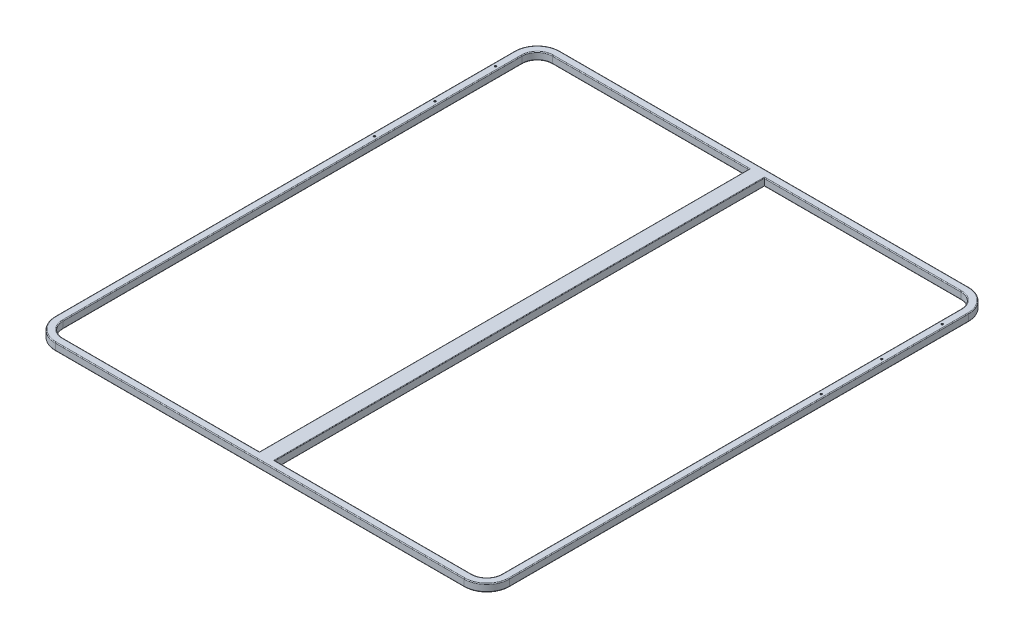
ISO-10303-21;
HEADER;
FILE_DESCRIPTION(('STEP AP214'),'2;1');
FILE_NAME('part.step','',(''),(''),'','','');
FILE_SCHEMA(('AUTOMOTIVE_DESIGN { 1 0 10303 214 1 1 1 1 }'));
ENDSEC;
DATA;
#1=APPLICATION_CONTEXT('core data for automotive mechanical design processes');
#2=APPLICATION_PROTOCOL_DEFINITION('international standard','automotive_design',2000,#1);
#3=PRODUCT_CONTEXT('',#1,'mechanical');
#4=PRODUCT('Part','Part','',(#3));
#5=PRODUCT_RELATED_PRODUCT_CATEGORY('part','',(#4));
#6=PRODUCT_DEFINITION_FORMATION('','',#4);
#7=PRODUCT_DEFINITION_CONTEXT('part definition',#1,'design');
#8=PRODUCT_DEFINITION('design','',#6,#7);
#9=PRODUCT_DEFINITION_SHAPE('','',#8);
#10=(LENGTH_UNIT() NAMED_UNIT(*) SI_UNIT(.MILLI.,.METRE.));
#11=(NAMED_UNIT(*) PLANE_ANGLE_UNIT() SI_UNIT($,.RADIAN.));
#12=(NAMED_UNIT(*) SI_UNIT($,.STERADIAN.) SOLID_ANGLE_UNIT());
#13=UNCERTAINTY_MEASURE_WITH_UNIT(LENGTH_MEASURE(1.E-05),#10,'distance_accuracy_value','');
#14=(GEOMETRIC_REPRESENTATION_CONTEXT(3) GLOBAL_UNCERTAINTY_ASSIGNED_CONTEXT((#13)) GLOBAL_UNIT_ASSIGNED_CONTEXT((#10,
#11,#12)) REPRESENTATION_CONTEXT('',''));
#15=CARTESIAN_POINT('',(0.,0.,0.));
#16=DIRECTION('',(0.,0.,1.));
#17=DIRECTION('',(1.,0.,0.));
#18=AXIS2_PLACEMENT_3D('',#15,#16,#17);
#19=CARTESIAN_POINT('',(-810.,30.,970.));
#20=DIRECTION('',(0.,0.,-1.));
#21=DIRECTION('',(-1.,0.,0.));
#22=AXIS2_PLACEMENT_3D('',#19,#20,#21);
#23=PLANE('',#22);
#24=DIRECTION('',(1.,0.,0.));
#25=VECTOR('',#24,1.);
#26=CARTESIAN_POINT('',(-810.,27.,970.));
#27=LINE('',#26,#25);
#28=CARTESIAN_POINT('',(-810.,27.,970.));
#29=VERTEX_POINT('',#28);
#30=CARTESIAN_POINT('',(-29.9999999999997,27.,970.));
#31=VERTEX_POINT('',#30);
#32=EDGE_CURVE('E1538',#29,#31,#27,.T.);
#33=ORIENTED_EDGE('',*,*,#32,.T.);
#34=DIRECTION('',(0.,-1.,0.));
#35=VECTOR('',#34,1.);
#36=CARTESIAN_POINT('',(-29.9999999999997,30.,970.));
#37=LINE('',#36,#35);
#38=CARTESIAN_POINT('',(-29.9999999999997,3.,970.));
#39=VERTEX_POINT('',#38);
#40=EDGE_CURVE('E1828',#31,#39,#37,.T.);
#41=ORIENTED_EDGE('',*,*,#40,.T.);
#42=DIRECTION('',(1.,0.,0.));
#43=VECTOR('',#42,1.);
#44=CARTESIAN_POINT('',(-810.,3.,970.));
#45=LINE('',#44,#43);
#46=CARTESIAN_POINT('',(-810.,3.,970.));
#47=VERTEX_POINT('',#46);
#48=EDGE_CURVE('E1532',#39,#47,#45,.F.);
#49=ORIENTED_EDGE('',*,*,#48,.T.);
#50=DIRECTION('',(0.,-1.,0.));
#51=VECTOR('',#50,1.);
#52=CARTESIAN_POINT('',(-810.,30.,970.));
#53=LINE('',#52,#51);
#54=EDGE_CURVE('E1449',#29,#47,#53,.T.);
#55=ORIENTED_EDGE('',*,*,#54,.F.);
#56=EDGE_LOOP('',(#33,#41,#49,#55));
#57=FACE_BOUND('',#56,.T.);
#58=ADVANCED_FACE('F38',(#57),#23,.T.);
#59=CARTESIAN_POINT('',(810.,3.,970.));
#60=VERTEX_POINT('',#59);
#61=CARTESIAN_POINT('',(29.9999999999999,3.,970.));
#62=VERTEX_POINT('',#61);
#63=EDGE_CURVE('E1533',#60,#62,#45,.F.);
#64=ORIENTED_EDGE('',*,*,#63,.T.);
#65=DIRECTION('',(0.,1.,0.));
#66=VECTOR('',#65,1.);
#67=CARTESIAN_POINT('',(29.9999999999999,30.,970.));
#68=LINE('',#67,#66);
#69=CARTESIAN_POINT('',(29.9999999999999,27.,970.));
#70=VERTEX_POINT('',#69);
#71=EDGE_CURVE('E836',#62,#70,#68,.T.);
#72=ORIENTED_EDGE('',*,*,#71,.T.);
#73=CARTESIAN_POINT('',(810.,27.,970.));
#74=VERTEX_POINT('',#73);
#75=EDGE_CURVE('E1536',#70,#74,#27,.T.);
#76=ORIENTED_EDGE('',*,*,#75,.T.);
#77=DIRECTION('',(0.,-1.,0.));
#78=VECTOR('',#77,1.);
#79=CARTESIAN_POINT('',(810.,30.,970.));
#80=LINE('',#79,#78);
#81=EDGE_CURVE('E1446',#74,#60,#80,.T.);
#82=ORIENTED_EDGE('',*,*,#81,.T.);
#83=EDGE_LOOP('',(#64,#72,#76,#82));
#84=FACE_BOUND('',#83,.T.);
#85=ADVANCED_FACE('F979',(#84),#23,.T.);
#86=CARTESIAN_POINT('',(-810.,30.,-970.));
#87=DIRECTION('',(0.,0.,1.));
#88=DIRECTION('',(1.,0.,0.));
#89=AXIS2_PLACEMENT_3D('',#86,#87,#88);
#90=PLANE('',#89);
#91=DIRECTION('',(-1.,0.,0.));
#92=VECTOR('',#91,1.);
#93=CARTESIAN_POINT('',(810.,3.,-970.));
#94=LINE('',#93,#92);
#95=CARTESIAN_POINT('',(-810.,3.,-970.));
#96=VERTEX_POINT('',#95);
#97=CARTESIAN_POINT('',(-29.9999999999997,3.,-970.));
#98=VERTEX_POINT('',#97);
#99=EDGE_CURVE('E1628',#96,#98,#94,.F.);
#100=ORIENTED_EDGE('',*,*,#99,.T.);
#101=DIRECTION('',(0.,1.,0.));
#102=VECTOR('',#101,1.);
#103=CARTESIAN_POINT('',(-29.9999999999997,30.,-970.));
#104=LINE('',#103,#102);
#105=CARTESIAN_POINT('',(-29.9999999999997,27.,-970.));
#106=VERTEX_POINT('',#105);
#107=EDGE_CURVE('E1819',#98,#106,#104,.T.);
#108=ORIENTED_EDGE('',*,*,#107,.T.);
#109=DIRECTION('',(-1.,0.,0.));
#110=VECTOR('',#109,1.);
#111=CARTESIAN_POINT('',(-810.,27.,-970.));
#112=LINE('',#111,#110);
#113=CARTESIAN_POINT('',(-810.,27.,-970.));
#114=VERTEX_POINT('',#113);
#115=EDGE_CURVE('E1631',#106,#114,#112,.T.);
#116=ORIENTED_EDGE('',*,*,#115,.T.);
#117=DIRECTION('',(0.,-1.,0.));
#118=VECTOR('',#117,1.);
#119=CARTESIAN_POINT('',(-810.,30.,-970.));
#120=LINE('',#119,#118);
#121=EDGE_CURVE('E1434',#114,#96,#120,.T.);
#122=ORIENTED_EDGE('',*,*,#121,.T.);
#123=EDGE_LOOP('',(#100,#108,#116,#122));
#124=FACE_BOUND('',#123,.T.);
#125=ADVANCED_FACE('F986',(#124),#90,.T.);
#126=CARTESIAN_POINT('',(810.,27.,-970.));
#127=VERTEX_POINT('',#126);
#128=CARTESIAN_POINT('',(29.9999999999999,27.,-970.));
#129=VERTEX_POINT('',#128);
#130=EDGE_CURVE('E1633',#127,#129,#112,.T.);
#131=ORIENTED_EDGE('',*,*,#130,.T.);
#132=DIRECTION('',(0.,-1.,0.));
#133=VECTOR('',#132,1.);
#134=CARTESIAN_POINT('',(29.9999999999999,30.,-970.));
#135=LINE('',#134,#133);
#136=CARTESIAN_POINT('',(29.9999999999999,3.,-970.));
#137=VERTEX_POINT('',#136);
#138=EDGE_CURVE('E827',#129,#137,#135,.T.);
#139=ORIENTED_EDGE('',*,*,#138,.T.);
#140=CARTESIAN_POINT('',(810.,3.,-970.));
#141=VERTEX_POINT('',#140);
#142=EDGE_CURVE('E1627',#137,#141,#94,.F.);
#143=ORIENTED_EDGE('',*,*,#142,.T.);
#144=DIRECTION('',(0.,-1.,0.));
#145=VECTOR('',#144,1.);
#146=CARTESIAN_POINT('',(810.,30.,-970.));
#147=LINE('',#146,#145);
#148=EDGE_CURVE('E1437',#127,#141,#147,.T.);
#149=ORIENTED_EDGE('',*,*,#148,.F.);
#150=EDGE_LOOP('',(#131,#139,#143,#149));
#151=FACE_BOUND('',#150,.T.);
#152=ADVANCED_FACE('F1924',(#151),#90,.T.);
#153=CARTESIAN_POINT('',(-810.,27.,973.));
#154=DIRECTION('',(1.,0.,0.));
#155=DIRECTION('',(0.,0.,-1.));
#156=AXIS2_PLACEMENT_3D('',#153,#154,#155);
#157=CYLINDRICAL_SURFACE('',#156,3.);
#158=DIRECTION('',(1.,0.,0.));
#159=VECTOR('',#158,1.);
#160=CARTESIAN_POINT('',(-810.,30.,973.));
#161=LINE('',#160,#159);
#162=CARTESIAN_POINT('',(-27.9999999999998,30.,973.));
#163=VERTEX_POINT('',#162);
#164=CARTESIAN_POINT('',(-810.,30.,973.));
#165=VERTEX_POINT('',#164);
#166=EDGE_CURVE('E1512',#163,#165,#161,.F.);
#167=ORIENTED_EDGE('',*,*,#166,.F.);
#168=CARTESIAN_POINT('',(-29.7320508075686,27.,970.));
#169=CARTESIAN_POINT('',(-29.7564078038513,27.042172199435,969.999993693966));
#170=CARTESIAN_POINT('',(-29.7792137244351,27.085246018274,970.000889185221));
#171=CARTESIAN_POINT('',(-29.8216003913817,27.1728763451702,970.004665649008));
#172=CARTESIAN_POINT('',(-29.841180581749,27.217433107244,970.007546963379));
#173=CARTESIAN_POINT('',(-29.8769379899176,27.307577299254,970.015466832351));
#174=CARTESIAN_POINT('',(-29.893123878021,27.3531617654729,970.020499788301));
#175=CARTESIAN_POINT('',(-29.9220804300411,27.4450828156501,970.032836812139));
#176=CARTESIAN_POINT('',(-29.9348514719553,27.491419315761,970.040140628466));
#177=CARTESIAN_POINT('',(-29.9680183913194,27.6311564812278,970.06562253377));
#178=CARTESIAN_POINT('',(-29.9832401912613,27.725213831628,970.087365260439));
#179=CARTESIAN_POINT('',(-30.0002528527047,27.9117666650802,970.140261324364));
#180=CARTESIAN_POINT('',(-30.0020461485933,28.0042624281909,970.17141295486));
#181=CARTESIAN_POINT('',(-29.9934417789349,28.1856754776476,970.24251757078));
#182=CARTESIAN_POINT('',(-29.9829861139,28.2745736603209,970.282511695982));
#183=CARTESIAN_POINT('',(-29.9514680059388,28.4465856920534,970.370031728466));
#184=CARTESIAN_POINT('',(-29.9303962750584,28.5296944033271,970.417564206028));
#185=CARTESIAN_POINT('',(-29.8675915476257,28.7260074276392,970.542366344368));
#186=CARTESIAN_POINT('',(-29.8208095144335,28.8353302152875,970.623214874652));
#187=CARTESIAN_POINT('',(-29.7132698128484,29.0382448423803,970.794709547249));
#188=CARTESIAN_POINT('',(-29.6524849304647,29.1318054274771,970.8853745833));
#189=CARTESIAN_POINT('',(-29.4950359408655,29.3369815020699,971.110574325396));
#190=CARTESIAN_POINT('',(-29.3936395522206,29.4413356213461,971.248392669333));
#191=CARTESIAN_POINT('',(-29.1784640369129,29.6220421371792,971.532569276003));
#192=CARTESIAN_POINT('',(-29.0646584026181,29.6983330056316,971.678945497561));
#193=CARTESIAN_POINT('',(-28.8725188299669,29.8016296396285,971.922321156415));
#194=CARTESIAN_POINT('',(-28.7963943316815,29.8364613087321,972.017848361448));
#195=CARTESIAN_POINT('',(-28.642009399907,29.8959634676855,972.210342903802));
#196=CARTESIAN_POINT('',(-28.563748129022,29.9206299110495,972.307310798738));
#197=CARTESIAN_POINT('',(-28.3273019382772,29.979699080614,972.59912966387));
#198=CARTESIAN_POINT('',(-28.1669483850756,29.9994340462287,972.795530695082));
#199=CARTESIAN_POINT('',(-28.0046187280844,29.9999959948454,972.994343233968));
#200=CARTESIAN_POINT('',(-28.0023093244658,29.9999999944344,972.997171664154));
#201=CARTESIAN_POINT('',(-27.9999999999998,30.,973.));
#202=B_SPLINE_CURVE_WITH_KNOTS('',3,(#168,#169,#170,#171,#172,#173,#174,#175,#176,#177,#178,
#179,#180,#181,#182,#183,#184,#185,#186,#187,#188,#189,#190,#191,#192,#193,#194,#195,#196,#197,
#198,#199,#200,#201),.UNSPECIFIED.,.F.,.F.,(4,2,2,2,2,2,2,2,2,2,2,2,2,2,2,2,4),(0.,
0.146067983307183,0.292161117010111,0.437876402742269,0.583575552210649,0.875200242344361,
1.16677206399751,1.45973009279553,1.75294487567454,2.18191721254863,2.61173038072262,
3.20973458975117,3.80904220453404,4.18966734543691,4.57044385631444,5.32946303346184,
5.34041749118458),.UNSPECIFIED.);
#203=CARTESIAN_POINT('',(-29.9999999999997,28.,970.171572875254));
#204=VERTEX_POINT('',#203);
#205=EDGE_CURVE('E1845',#163,#204,#202,.F.);
#206=ORIENTED_EDGE('',*,*,#205,.T.);
#207=CARTESIAN_POINT('',(-29.9999999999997,27.,973.));
#208=DIRECTION('',(1.,0.,0.));
#209=DIRECTION('',(0.,0.,-1.));
#210=AXIS2_PLACEMENT_3D('',#207,#208,#209);
#211=CIRCLE('',#210,3.);
#212=EDGE_CURVE('E1056',#204,#31,#211,.F.);
#213=ORIENTED_EDGE('',*,*,#212,.T.);
#214=ORIENTED_EDGE('',*,*,#32,.F.);
#215=CARTESIAN_POINT('',(-810.,27.,973.));
#216=DIRECTION('',(1.,0.,0.));
#217=DIRECTION('',(0.,0.,-1.));
#218=AXIS2_PLACEMENT_3D('',#215,#216,#217);
#219=CIRCLE('',#218,3.);
#220=EDGE_CURVE('E1394',#29,#165,#219,.T.);
#221=ORIENTED_EDGE('',*,*,#220,.T.);
#222=EDGE_LOOP('',(#167,#206,#213,#214,#221));
#223=FACE_BOUND('',#222,.T.);
#224=ADVANCED_FACE('F997',(#223),#157,.T.);
#225=CARTESIAN_POINT('',(29.9999999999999,27.,973.));
#226=DIRECTION('',(-1.,0.,0.));
#227=DIRECTION('',(0.,0.,1.));
#228=AXIS2_PLACEMENT_3D('',#225,#226,#227);
#229=CIRCLE('',#228,3.);
#230=CARTESIAN_POINT('',(29.9999999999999,28.,970.171572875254));
#231=VERTEX_POINT('',#230);
#232=EDGE_CURVE('E839',#70,#231,#229,.F.);
#233=ORIENTED_EDGE('',*,*,#232,.T.);
#234=CARTESIAN_POINT('',(29.7320508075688,27.,970.));
#235=CARTESIAN_POINT('',(29.7564078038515,27.042172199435,969.999993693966));
#236=CARTESIAN_POINT('',(29.7792137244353,27.085246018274,970.000889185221));
#237=CARTESIAN_POINT('',(29.8216003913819,27.1728763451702,970.004665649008));
#238=CARTESIAN_POINT('',(29.8411805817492,27.217433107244,970.007546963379));
#239=CARTESIAN_POINT('',(29.8769379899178,27.307577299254,970.015466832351));
#240=CARTESIAN_POINT('',(29.8931238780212,27.3531617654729,970.020499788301));
#241=CARTESIAN_POINT('',(29.9220804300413,27.4450828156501,970.032836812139));
#242=CARTESIAN_POINT('',(29.9348514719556,27.491419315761,970.040140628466));
#243=CARTESIAN_POINT('',(29.9680183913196,27.6311564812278,970.06562253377));
#244=CARTESIAN_POINT('',(29.9832401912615,27.725213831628,970.087365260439));
#245=CARTESIAN_POINT('',(30.0002528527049,27.9117666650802,970.140261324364));
#246=CARTESIAN_POINT('',(30.0020461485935,28.0042624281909,970.17141295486));
#247=CARTESIAN_POINT('',(29.9934417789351,28.1856754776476,970.24251757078));
#248=CARTESIAN_POINT('',(29.9829861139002,28.2745736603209,970.282511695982));
#249=CARTESIAN_POINT('',(29.951468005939,28.4465856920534,970.370031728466));
#250=CARTESIAN_POINT('',(29.9303962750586,28.5296944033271,970.417564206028));
#251=CARTESIAN_POINT('',(29.8675915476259,28.7260074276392,970.542366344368));
#252=CARTESIAN_POINT('',(29.8208095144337,28.8353302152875,970.623214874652));
#253=CARTESIAN_POINT('',(29.7132698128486,29.0382448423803,970.794709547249));
#254=CARTESIAN_POINT('',(29.6524849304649,29.1318054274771,970.8853745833));
#255=CARTESIAN_POINT('',(29.4950359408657,29.3369815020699,971.110574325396));
#256=CARTESIAN_POINT('',(29.3936395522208,29.4413356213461,971.248392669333));
#257=CARTESIAN_POINT('',(29.1784640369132,29.6220421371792,971.532569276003));
#258=CARTESIAN_POINT('',(29.0646584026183,29.6983330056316,971.678945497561));
#259=CARTESIAN_POINT('',(28.8725188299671,29.8016296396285,971.922321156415));
#260=CARTESIAN_POINT('',(28.7963943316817,29.8364613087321,972.017848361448));
#261=CARTESIAN_POINT('',(28.6420093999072,29.8959634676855,972.210342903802));
#262=CARTESIAN_POINT('',(28.5637481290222,29.9206299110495,972.307310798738));
#263=CARTESIAN_POINT('',(28.3273019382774,29.979699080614,972.59912966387));
#264=CARTESIAN_POINT('',(28.1669483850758,29.9994340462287,972.795530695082));
#265=CARTESIAN_POINT('',(28.0046187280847,29.9999959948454,972.994343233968));
#266=CARTESIAN_POINT('',(28.002309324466,29.9999999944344,972.997171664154));
#267=CARTESIAN_POINT('',(28.,30.,973.));
#268=B_SPLINE_CURVE_WITH_KNOTS('',3,(#234,#235,#236,#237,#238,#239,#240,#241,#242,#243,#244,
#245,#246,#247,#248,#249,#250,#251,#252,#253,#254,#255,#256,#257,#258,#259,#260,#261,#262,#263,
#264,#265,#266,#267),.UNSPECIFIED.,.F.,.F.,(4,2,2,2,2,2,2,2,2,2,2,2,2,2,2,2,4),(0.,
0.146067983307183,0.292161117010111,0.437876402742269,0.583575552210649,0.875200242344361,
1.16677206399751,1.45973009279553,1.75294487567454,2.18191721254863,2.61173038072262,
3.20973458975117,3.80904220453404,4.18966734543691,4.57044385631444,5.32946303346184,
5.34041749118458),.UNSPECIFIED.);
#269=CARTESIAN_POINT('',(28.,30.,973.));
#270=VERTEX_POINT('',#269);
#271=EDGE_CURVE('E1346',#231,#270,#268,.T.);
#272=ORIENTED_EDGE('',*,*,#271,.T.);
#273=CARTESIAN_POINT('',(810.,30.,973.));
#274=VERTEX_POINT('',#273);
#275=EDGE_CURVE('E1513',#274,#270,#161,.F.);
#276=ORIENTED_EDGE('',*,*,#275,.F.);
#277=CARTESIAN_POINT('',(810.,27.,973.));
#278=DIRECTION('',(1.,0.,0.));
#279=DIRECTION('',(0.,0.,-1.));
#280=AXIS2_PLACEMENT_3D('',#277,#278,#279);
#281=CIRCLE('',#280,3.);
#282=EDGE_CURVE('E1654',#74,#274,#281,.T.);
#283=ORIENTED_EDGE('',*,*,#282,.F.);
#284=ORIENTED_EDGE('',*,*,#75,.F.);
#285=EDGE_LOOP('',(#233,#272,#276,#283,#284));
#286=FACE_BOUND('',#285,.T.);
#287=ADVANCED_FACE('F998',(#286),#157,.T.);
#288=CARTESIAN_POINT('',(-810.,27.,-973.));
#289=DIRECTION('',(-1.,0.,0.));
#290=DIRECTION('',(0.,0.,1.));
#291=AXIS2_PLACEMENT_3D('',#288,#289,#290);
#292=CYLINDRICAL_SURFACE('',#291,3.);
#293=CARTESIAN_POINT('',(-29.9999999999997,27.,-973.));
#294=DIRECTION('',(1.,0.,0.));
#295=DIRECTION('',(0.,0.,-1.));
#296=AXIS2_PLACEMENT_3D('',#293,#294,#295);
#297=CIRCLE('',#296,3.);
#298=CARTESIAN_POINT('',(-29.9999999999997,28.,-970.171572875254));
#299=VERTEX_POINT('',#298);
#300=EDGE_CURVE('E1822',#106,#299,#297,.F.);
#301=ORIENTED_EDGE('',*,*,#300,.T.);
#302=CARTESIAN_POINT('',(-29.7320508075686,27.,-970.));
#303=CARTESIAN_POINT('',(-29.7564078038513,27.042172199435,-969.999993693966));
#304=CARTESIAN_POINT('',(-29.7792137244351,27.085246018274,-970.000889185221));
#305=CARTESIAN_POINT('',(-29.8216003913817,27.1728763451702,-970.004665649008));
#306=CARTESIAN_POINT('',(-29.841180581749,27.217433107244,-970.007546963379));
#307=CARTESIAN_POINT('',(-29.8769379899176,27.307577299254,-970.015466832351));
#308=CARTESIAN_POINT('',(-29.893123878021,27.3531617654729,-970.020499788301));
#309=CARTESIAN_POINT('',(-29.9220804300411,27.4450828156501,-970.032836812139));
#310=CARTESIAN_POINT('',(-29.9348514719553,27.491419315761,-970.040140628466));
#311=CARTESIAN_POINT('',(-29.9680183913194,27.6311564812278,-970.06562253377));
#312=CARTESIAN_POINT('',(-29.9832401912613,27.725213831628,-970.087365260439));
#313=CARTESIAN_POINT('',(-30.0002528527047,27.9117666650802,-970.140261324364));
#314=CARTESIAN_POINT('',(-30.0020461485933,28.0042624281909,-970.17141295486));
#315=CARTESIAN_POINT('',(-29.9934417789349,28.1856754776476,-970.24251757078));
#316=CARTESIAN_POINT('',(-29.9829861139,28.2745736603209,-970.282511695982));
#317=CARTESIAN_POINT('',(-29.9514680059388,28.4465856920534,-970.370031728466));
#318=CARTESIAN_POINT('',(-29.9303962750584,28.5296944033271,-970.417564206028));
#319=CARTESIAN_POINT('',(-29.8675915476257,28.7260074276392,-970.542366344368));
#320=CARTESIAN_POINT('',(-29.8208095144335,28.8353302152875,-970.623214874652));
#321=CARTESIAN_POINT('',(-29.7132698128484,29.0382448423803,-970.794709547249));
#322=CARTESIAN_POINT('',(-29.6524849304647,29.1318054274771,-970.8853745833));
#323=CARTESIAN_POINT('',(-29.4950359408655,29.3369815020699,-971.110574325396));
#324=CARTESIAN_POINT('',(-29.3936395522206,29.4413356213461,-971.248392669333));
#325=CARTESIAN_POINT('',(-29.1784640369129,29.6220421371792,-971.532569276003));
#326=CARTESIAN_POINT('',(-29.0646584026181,29.6983330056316,-971.678945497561));
#327=CARTESIAN_POINT('',(-28.8725188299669,29.8016296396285,-971.922321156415));
#328=CARTESIAN_POINT('',(-28.7963943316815,29.8364613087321,-972.017848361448));
#329=CARTESIAN_POINT('',(-28.642009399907,29.8959634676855,-972.210342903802));
#330=CARTESIAN_POINT('',(-28.563748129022,29.9206299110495,-972.307310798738));
#331=CARTESIAN_POINT('',(-28.3273019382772,29.979699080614,-972.59912966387));
#332=CARTESIAN_POINT('',(-28.1669483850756,29.9994340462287,-972.795530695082));
#333=CARTESIAN_POINT('',(-28.0046187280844,29.9999959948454,-972.994343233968));
#334=CARTESIAN_POINT('',(-28.0023093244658,29.9999999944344,-972.997171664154));
#335=CARTESIAN_POINT('',(-27.9999999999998,30.,-973.));
#336=B_SPLINE_CURVE_WITH_KNOTS('',3,(#302,#303,#304,#305,#306,#307,#308,#309,#310,#311,#312,
#313,#314,#315,#316,#317,#318,#319,#320,#321,#322,#323,#324,#325,#326,#327,#328,#329,#330,#331,
#332,#333,#334,#335),.UNSPECIFIED.,.F.,.F.,(4,2,2,2,2,2,2,2,2,2,2,2,2,2,2,2,4),(0.,
0.146067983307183,0.292161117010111,0.437876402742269,0.583575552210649,0.875200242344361,
1.16677206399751,1.45973009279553,1.75294487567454,2.18191721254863,2.61173038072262,
3.20973458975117,3.80904220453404,4.18966734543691,4.57044385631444,5.32946303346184,
5.34041749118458),.UNSPECIFIED.);
#337=CARTESIAN_POINT('',(-27.9999999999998,30.,-973.));
#338=VERTEX_POINT('',#337);
#339=EDGE_CURVE('E1837',#299,#338,#336,.T.);
#340=ORIENTED_EDGE('',*,*,#339,.T.);
#341=DIRECTION('',(-1.,0.,0.));
#342=VECTOR('',#341,1.);
#343=CARTESIAN_POINT('',(-810.,30.,-973.));
#344=LINE('',#343,#342);
#345=CARTESIAN_POINT('',(-810.,30.,-973.));
#346=VERTEX_POINT('',#345);
#347=EDGE_CURVE('E1502',#346,#338,#344,.F.);
#348=ORIENTED_EDGE('',*,*,#347,.F.);
#349=CARTESIAN_POINT('',(-810.,27.,-973.));
#350=DIRECTION('',(1.,0.,0.));
#351=DIRECTION('',(0.,0.,-1.));
#352=AXIS2_PLACEMENT_3D('',#349,#350,#351);
#353=CIRCLE('',#352,3.);
#354=EDGE_CURVE('E1645',#346,#114,#353,.T.);
#355=ORIENTED_EDGE('',*,*,#354,.T.);
#356=ORIENTED_EDGE('',*,*,#115,.F.);
#357=EDGE_LOOP('',(#301,#340,#348,#355,#356));
#358=FACE_BOUND('',#357,.T.);
#359=ADVANCED_FACE('F1954',(#358),#292,.T.);
#360=CARTESIAN_POINT('',(28.,30.,-973.));
#361=VERTEX_POINT('',#360);
#362=CARTESIAN_POINT('',(810.,30.,-973.));
#363=VERTEX_POINT('',#362);
#364=EDGE_CURVE('E1501',#361,#363,#344,.F.);
#365=ORIENTED_EDGE('',*,*,#364,.F.);
#366=CARTESIAN_POINT('',(29.7320508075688,27.,-970.));
#367=CARTESIAN_POINT('',(29.7564078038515,27.042172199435,-969.999993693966));
#368=CARTESIAN_POINT('',(29.7792137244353,27.085246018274,-970.000889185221));
#369=CARTESIAN_POINT('',(29.8216003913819,27.1728763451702,-970.004665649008));
#370=CARTESIAN_POINT('',(29.8411805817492,27.217433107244,-970.007546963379));
#371=CARTESIAN_POINT('',(29.8769379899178,27.307577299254,-970.015466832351));
#372=CARTESIAN_POINT('',(29.8931238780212,27.3531617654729,-970.020499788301));
#373=CARTESIAN_POINT('',(29.9220804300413,27.4450828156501,-970.032836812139));
#374=CARTESIAN_POINT('',(29.9348514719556,27.491419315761,-970.040140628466));
#375=CARTESIAN_POINT('',(29.9680183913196,27.6311564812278,-970.06562253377));
#376=CARTESIAN_POINT('',(29.9832401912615,27.725213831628,-970.087365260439));
#377=CARTESIAN_POINT('',(30.0002528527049,27.9117666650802,-970.140261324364));
#378=CARTESIAN_POINT('',(30.0020461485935,28.0042624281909,-970.17141295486));
#379=CARTESIAN_POINT('',(29.9934417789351,28.1856754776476,-970.24251757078));
#380=CARTESIAN_POINT('',(29.9829861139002,28.2745736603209,-970.282511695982));
#381=CARTESIAN_POINT('',(29.951468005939,28.4465856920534,-970.370031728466));
#382=CARTESIAN_POINT('',(29.9303962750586,28.5296944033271,-970.417564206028));
#383=CARTESIAN_POINT('',(29.8675915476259,28.7260074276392,-970.542366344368));
#384=CARTESIAN_POINT('',(29.8208095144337,28.8353302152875,-970.623214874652));
#385=CARTESIAN_POINT('',(29.7132698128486,29.0382448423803,-970.794709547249));
#386=CARTESIAN_POINT('',(29.6524849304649,29.1318054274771,-970.8853745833));
#387=CARTESIAN_POINT('',(29.4950359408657,29.3369815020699,-971.110574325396));
#388=CARTESIAN_POINT('',(29.3936395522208,29.4413356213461,-971.248392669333));
#389=CARTESIAN_POINT('',(29.1784640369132,29.6220421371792,-971.532569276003));
#390=CARTESIAN_POINT('',(29.0646584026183,29.6983330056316,-971.678945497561));
#391=CARTESIAN_POINT('',(28.8725188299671,29.8016296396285,-971.922321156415));
#392=CARTESIAN_POINT('',(28.7963943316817,29.8364613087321,-972.017848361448));
#393=CARTESIAN_POINT('',(28.6420093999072,29.8959634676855,-972.210342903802));
#394=CARTESIAN_POINT('',(28.5637481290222,29.9206299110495,-972.307310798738));
#395=CARTESIAN_POINT('',(28.3273019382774,29.979699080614,-972.59912966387));
#396=CARTESIAN_POINT('',(28.1669483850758,29.9994340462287,-972.795530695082));
#397=CARTESIAN_POINT('',(28.0046187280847,29.9999959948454,-972.994343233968));
#398=CARTESIAN_POINT('',(28.002309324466,29.9999999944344,-972.997171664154));
#399=CARTESIAN_POINT('',(28.,30.,-973.));
#400=B_SPLINE_CURVE_WITH_KNOTS('',3,(#366,#367,#368,#369,#370,#371,#372,#373,#374,#375,#376,
#377,#378,#379,#380,#381,#382,#383,#384,#385,#386,#387,#388,#389,#390,#391,#392,#393,#394,#395,
#396,#397,#398,#399),.UNSPECIFIED.,.F.,.F.,(4,2,2,2,2,2,2,2,2,2,2,2,2,2,2,2,4),(0.,
0.146067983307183,0.292161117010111,0.437876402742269,0.583575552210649,0.875200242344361,
1.16677206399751,1.45973009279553,1.75294487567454,2.18191721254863,2.61173038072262,
3.20973458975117,3.80904220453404,4.18966734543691,4.57044385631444,5.32946303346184,
5.34041749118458),.UNSPECIFIED.);
#401=CARTESIAN_POINT('',(29.9999999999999,28.,-970.171572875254));
#402=VERTEX_POINT('',#401);
#403=EDGE_CURVE('E1867',#361,#402,#400,.F.);
#404=ORIENTED_EDGE('',*,*,#403,.T.);
#405=CARTESIAN_POINT('',(29.9999999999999,27.,-973.));
#406=DIRECTION('',(-1.,0.,0.));
#407=DIRECTION('',(0.,0.,1.));
#408=AXIS2_PLACEMENT_3D('',#405,#406,#407);
#409=CIRCLE('',#408,3.);
#410=EDGE_CURVE('E830',#402,#129,#409,.F.);
#411=ORIENTED_EDGE('',*,*,#410,.T.);
#412=ORIENTED_EDGE('',*,*,#130,.F.);
#413=CARTESIAN_POINT('',(810.,27.,-973.));
#414=DIRECTION('',(1.,0.,0.));
#415=DIRECTION('',(0.,0.,-1.));
#416=AXIS2_PLACEMENT_3D('',#413,#414,#415);
#417=CIRCLE('',#416,3.);
#418=EDGE_CURVE('E1640',#363,#127,#417,.T.);
#419=ORIENTED_EDGE('',*,*,#418,.F.);
#420=EDGE_LOOP('',(#365,#404,#411,#412,#419));
#421=FACE_BOUND('',#420,.T.);
#422=ADVANCED_FACE('F2028',(#421),#292,.T.);
#423=CARTESIAN_POINT('',(-810.,3.,973.));
#424=DIRECTION('',(-1.,0.,0.));
#425=DIRECTION('',(0.,0.,1.));
#426=AXIS2_PLACEMENT_3D('',#423,#424,#425);
#427=CYLINDRICAL_SURFACE('',#426,3.);
#428=ORIENTED_EDGE('',*,*,#48,.F.);
#429=CARTESIAN_POINT('',(-29.9999999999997,3.,973.));
#430=DIRECTION('',(1.,0.,0.));
#431=DIRECTION('',(0.,0.,-1.));
#432=AXIS2_PLACEMENT_3D('',#429,#430,#431);
#433=CIRCLE('',#432,3.);
#434=CARTESIAN_POINT('',(-29.9999999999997,2.,970.171572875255));
#435=VERTEX_POINT('',#434);
#436=EDGE_CURVE('E1825',#39,#435,#433,.F.);
#437=ORIENTED_EDGE('',*,*,#436,.T.);
#438=CARTESIAN_POINT('',(-29.7320508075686,3.,970.));
#439=CARTESIAN_POINT('',(-29.7564078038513,2.957827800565,969.999993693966));
#440=CARTESIAN_POINT('',(-29.7792137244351,2.91475398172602,970.000889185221));
#441=CARTESIAN_POINT('',(-29.8216003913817,2.82712365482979,970.004665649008));
#442=CARTESIAN_POINT('',(-29.841180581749,2.78256689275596,970.007546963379));
#443=CARTESIAN_POINT('',(-29.8769379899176,2.69242270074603,970.015466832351));
#444=CARTESIAN_POINT('',(-29.893123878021,2.64683823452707,970.020499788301));
#445=CARTESIAN_POINT('',(-29.9220804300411,2.55491718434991,970.032836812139));
#446=CARTESIAN_POINT('',(-29.9348514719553,2.50858068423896,970.040140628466));
#447=CARTESIAN_POINT('',(-29.9680183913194,2.36884351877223,970.06562253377));
#448=CARTESIAN_POINT('',(-29.9832401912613,2.27478616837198,970.087365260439));
#449=CARTESIAN_POINT('',(-30.0002528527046,2.08823333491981,970.140261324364));
#450=CARTESIAN_POINT('',(-30.0020461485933,1.99573757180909,970.17141295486));
#451=CARTESIAN_POINT('',(-29.9934417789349,1.81432452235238,970.24251757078));
#452=CARTESIAN_POINT('',(-29.9829861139,1.7254263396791,970.282511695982));
#453=CARTESIAN_POINT('',(-29.9514680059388,1.55341430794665,970.370031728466));
#454=CARTESIAN_POINT('',(-29.9303962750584,1.47030559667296,970.417564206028));
#455=CARTESIAN_POINT('',(-29.8675915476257,1.27399257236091,970.542366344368));
#456=CARTESIAN_POINT('',(-29.8208095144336,1.16466978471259,970.623214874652));
#457=CARTESIAN_POINT('',(-29.7132698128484,0.961755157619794,970.794709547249));
#458=CARTESIAN_POINT('',(-29.6524849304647,0.868194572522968,970.8853745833));
#459=CARTESIAN_POINT('',(-29.4950359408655,0.663018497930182,971.110574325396));
#460=CARTESIAN_POINT('',(-29.3936395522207,0.558664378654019,971.248392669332));
#461=CARTESIAN_POINT('',(-29.1784640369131,0.377957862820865,971.532569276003));
#462=CARTESIAN_POINT('',(-29.0646584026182,0.30166699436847,971.67894549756));
#463=CARTESIAN_POINT('',(-28.872518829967,0.198370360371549,971.922321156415));
#464=CARTESIAN_POINT('',(-28.7963943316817,0.163538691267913,972.017848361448));
#465=CARTESIAN_POINT('',(-28.6420093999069,0.10403653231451,972.210342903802));
#466=CARTESIAN_POINT('',(-28.5637481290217,0.0793700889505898,972.307310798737));
#467=CARTESIAN_POINT('',(-28.3273019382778,0.020300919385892,972.599129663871));
#468=CARTESIAN_POINT('',(-28.1669483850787,0.000565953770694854,972.795530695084));
#469=CARTESIAN_POINT('',(-28.0046187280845,4.00515460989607E-06,972.994343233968));
#470=CARTESIAN_POINT('',(-28.0023093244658,5.56557317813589E-09,972.997171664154));
#471=CARTESIAN_POINT('',(-27.9999999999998,0.,973.));
#472=B_SPLINE_CURVE_WITH_KNOTS('',3,(#438,#439,#440,#441,#442,#443,#444,#445,#446,#447,#448,
#449,#450,#451,#452,#453,#454,#455,#456,#457,#458,#459,#460,#461,#462,#463,#464,#465,#466,#467,
#468,#469,#470,#471),.UNSPECIFIED.,.F.,.F.,(4,2,2,2,2,2,2,2,2,2,2,2,2,2,2,2,4),(0.,
0.14606798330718,0.292161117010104,0.437876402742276,0.583575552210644,0.875200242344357,
1.16677206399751,1.45973009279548,1.75294487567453,2.18191721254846,2.61173038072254,
3.20973458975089,3.80904220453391,4.18966734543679,4.57044385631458,5.32946303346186,
5.34041749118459),.UNSPECIFIED.);
#473=CARTESIAN_POINT('',(-27.9999999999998,0.,973.));
#474=VERTEX_POINT('',#473);
#475=EDGE_CURVE('E885',#435,#474,#472,.T.);
#476=ORIENTED_EDGE('',*,*,#475,.T.);
#477=DIRECTION('',(1.,0.,0.));
#478=VECTOR('',#477,1.);
#479=CARTESIAN_POINT('',(810.,0.,973.));
#480=LINE('',#479,#478);
#481=CARTESIAN_POINT('',(-810.,0.,973.));
#482=VERTEX_POINT('',#481);
#483=EDGE_CURVE('E1581',#482,#474,#480,.T.);
#484=ORIENTED_EDGE('',*,*,#483,.F.);
#485=CARTESIAN_POINT('',(-810.,3.,973.));
#486=DIRECTION('',(1.,0.,0.));
#487=DIRECTION('',(0.,0.,-1.));
#488=AXIS2_PLACEMENT_3D('',#485,#486,#487);
#489=CIRCLE('',#488,3.);
#490=EDGE_CURVE('E1643',#482,#47,#489,.T.);
#491=ORIENTED_EDGE('',*,*,#490,.T.);
#492=EDGE_LOOP('',(#428,#437,#476,#484,#491));
#493=FACE_BOUND('',#492,.T.);
#494=ADVANCED_FACE('F902',(#493),#427,.T.);
#495=CARTESIAN_POINT('',(27.9999999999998,0.,973.));
#496=VERTEX_POINT('',#495);
#497=CARTESIAN_POINT('',(810.,0.,973.));
#498=VERTEX_POINT('',#497);
#499=EDGE_CURVE('E1580',#496,#498,#480,.T.);
#500=ORIENTED_EDGE('',*,*,#499,.F.);
#501=CARTESIAN_POINT('',(29.7320508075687,3.,970.));
#502=CARTESIAN_POINT('',(29.7564078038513,2.95782780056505,969.999993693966));
#503=CARTESIAN_POINT('',(29.7792137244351,2.91475398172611,970.000889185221));
#504=CARTESIAN_POINT('',(29.8216003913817,2.82712365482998,970.004665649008));
#505=CARTESIAN_POINT('',(29.8411805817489,2.78256689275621,970.007546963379));
#506=CARTESIAN_POINT('',(29.8769379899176,2.69242270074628,970.015466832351));
#507=CARTESIAN_POINT('',(29.893123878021,2.64683823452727,970.020499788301));
#508=CARTESIAN_POINT('',(29.9220804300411,2.55491718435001,970.032836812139));
#509=CARTESIAN_POINT('',(29.9348514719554,2.50858068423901,970.040140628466));
#510=CARTESIAN_POINT('',(29.9680183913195,2.36884351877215,970.06562253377));
#511=CARTESIAN_POINT('',(29.9832401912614,2.27478616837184,970.087365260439));
#512=CARTESIAN_POINT('',(30.0002528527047,2.08823333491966,970.140261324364));
#513=CARTESIAN_POINT('',(30.0020461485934,1.995737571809,970.17141295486));
#514=CARTESIAN_POINT('',(29.993441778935,1.81432452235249,970.24251757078));
#515=CARTESIAN_POINT('',(29.9829861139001,1.72542633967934,970.282511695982));
#516=CARTESIAN_POINT('',(29.9514680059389,1.55341430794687,970.370031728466));
#517=CARTESIAN_POINT('',(29.9303962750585,1.47030559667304,970.417564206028));
#518=CARTESIAN_POINT('',(29.8675915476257,1.27399257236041,970.542366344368));
#519=CARTESIAN_POINT('',(29.8208095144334,1.16466978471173,970.623214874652));
#520=CARTESIAN_POINT('',(29.713269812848,0.961755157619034,970.794709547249));
#521=CARTESIAN_POINT('',(29.6524849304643,0.868194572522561,970.8853745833));
#522=CARTESIAN_POINT('',(29.4950359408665,0.663018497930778,971.110574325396));
#523=CARTESIAN_POINT('',(29.3936395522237,0.558664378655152,971.248392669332));
#524=CARTESIAN_POINT('',(29.1784640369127,0.377957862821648,971.532569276));
#525=CARTESIAN_POINT('',(29.0646584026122,0.301666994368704,971.678945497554));
#526=CARTESIAN_POINT('',(28.8725188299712,0.198370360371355,971.922321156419));
#527=CARTESIAN_POINT('',(28.7963943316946,0.163538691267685,972.01784836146));
#528=CARTESIAN_POINT('',(28.6420093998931,0.104036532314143,972.210342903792));
#529=CARTESIAN_POINT('',(28.5637481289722,0.0793700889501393,972.3073107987));
#530=CARTESIAN_POINT('',(28.3273019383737,0.0203009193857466,972.599129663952));
#531=CARTESIAN_POINT('',(28.1669483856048,0.000565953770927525,972.795530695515));
#532=CARTESIAN_POINT('',(28.0046187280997,4.00515455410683E-06,972.99434323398));
#533=CARTESIAN_POINT('',(28.0023093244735,5.56551314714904E-09,972.997171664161));
#534=CARTESIAN_POINT('',(27.9999999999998,0.,973.));
#535=B_SPLINE_CURVE_WITH_KNOTS('',3,(#501,#502,#503,#504,#505,#506,#507,#508,#509,#510,#511,
#512,#513,#514,#515,#516,#517,#518,#519,#520,#521,#522,#523,#524,#525,#526,#527,#528,#529,#530,
#531,#532,#533,#534),.UNSPECIFIED.,.F.,.F.,(4,2,2,2,2,2,2,2,2,2,2,2,2,2,2,2,4),(0.,
0.146067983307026,0.292161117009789,0.437876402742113,0.58357555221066,0.875200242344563,
1.16677206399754,1.45973009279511,1.75294487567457,2.18191721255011,2.6117303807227,
3.20973458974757,3.80904220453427,4.18966734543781,4.57044385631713,5.32946303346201,
5.34041749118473),.UNSPECIFIED.);
#536=CARTESIAN_POINT('',(29.9999999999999,1.99999999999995,970.171572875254));
#537=VERTEX_POINT('',#536);
#538=EDGE_CURVE('E851',#496,#537,#535,.F.);
#539=ORIENTED_EDGE('',*,*,#538,.T.);
#540=CARTESIAN_POINT('',(29.9999999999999,3.,973.));
#541=DIRECTION('',(-1.,0.,0.));
#542=DIRECTION('',(0.,0.,1.));
#543=AXIS2_PLACEMENT_3D('',#540,#541,#542);
#544=CIRCLE('',#543,3.);
#545=EDGE_CURVE('E833',#537,#62,#544,.F.);
#546=ORIENTED_EDGE('',*,*,#545,.T.);
#547=ORIENTED_EDGE('',*,*,#63,.F.);
#548=CARTESIAN_POINT('',(810.,3.,973.));
#549=DIRECTION('',(1.,0.,0.));
#550=DIRECTION('',(0.,0.,-1.));
#551=AXIS2_PLACEMENT_3D('',#548,#549,#550);
#552=CIRCLE('',#551,3.);
#553=EDGE_CURVE('E1676',#498,#60,#552,.T.);
#554=ORIENTED_EDGE('',*,*,#553,.F.);
#555=EDGE_LOOP('',(#500,#539,#546,#547,#554));
#556=FACE_BOUND('',#555,.T.);
#557=ADVANCED_FACE('F903',(#556),#427,.T.);
#558=CARTESIAN_POINT('',(-810.,3.,-973.));
#559=DIRECTION('',(1.,0.,0.));
#560=DIRECTION('',(0.,0.,-1.));
#561=AXIS2_PLACEMENT_3D('',#558,#559,#560);
#562=CYLINDRICAL_SURFACE('',#561,3.);
#563=CARTESIAN_POINT('',(-29.7320508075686,3.,-970.));
#564=CARTESIAN_POINT('',(-29.7564078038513,2.957827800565,-969.999993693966));
#565=CARTESIAN_POINT('',(-29.7792137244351,2.91475398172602,-970.000889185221));
#566=CARTESIAN_POINT('',(-29.8216003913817,2.82712365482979,-970.004665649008));
#567=CARTESIAN_POINT('',(-29.841180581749,2.78256689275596,-970.007546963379));
#568=CARTESIAN_POINT('',(-29.8769379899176,2.69242270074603,-970.015466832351));
#569=CARTESIAN_POINT('',(-29.893123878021,2.64683823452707,-970.020499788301));
#570=CARTESIAN_POINT('',(-29.9220804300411,2.55491718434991,-970.032836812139));
#571=CARTESIAN_POINT('',(-29.9348514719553,2.50858068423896,-970.040140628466));
#572=CARTESIAN_POINT('',(-29.9680183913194,2.36884351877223,-970.06562253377));
#573=CARTESIAN_POINT('',(-29.9832401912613,2.27478616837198,-970.087365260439));
#574=CARTESIAN_POINT('',(-30.0002528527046,2.08823333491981,-970.140261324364));
#575=CARTESIAN_POINT('',(-30.0020461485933,1.99573757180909,-970.17141295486));
#576=CARTESIAN_POINT('',(-29.9934417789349,1.81432452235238,-970.24251757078));
#577=CARTESIAN_POINT('',(-29.9829861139,1.7254263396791,-970.282511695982));
#578=CARTESIAN_POINT('',(-29.9514680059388,1.55341430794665,-970.370031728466));
#579=CARTESIAN_POINT('',(-29.9303962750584,1.47030559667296,-970.417564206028));
#580=CARTESIAN_POINT('',(-29.8675915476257,1.27399257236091,-970.542366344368));
#581=CARTESIAN_POINT('',(-29.8208095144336,1.16466978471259,-970.623214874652));
#582=CARTESIAN_POINT('',(-29.7132698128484,0.961755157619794,-970.794709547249));
#583=CARTESIAN_POINT('',(-29.6524849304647,0.868194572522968,-970.8853745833));
#584=CARTESIAN_POINT('',(-29.4950359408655,0.663018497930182,-971.110574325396));
#585=CARTESIAN_POINT('',(-29.3936395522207,0.558664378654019,-971.248392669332));
#586=CARTESIAN_POINT('',(-29.1784640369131,0.377957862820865,-971.532569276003));
#587=CARTESIAN_POINT('',(-29.0646584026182,0.30166699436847,-971.67894549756));
#588=CARTESIAN_POINT('',(-28.872518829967,0.198370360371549,-971.922321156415));
#589=CARTESIAN_POINT('',(-28.7963943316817,0.163538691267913,-972.017848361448));
#590=CARTESIAN_POINT('',(-28.6420093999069,0.10403653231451,-972.210342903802));
#591=CARTESIAN_POINT('',(-28.5637481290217,0.0793700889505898,-972.307310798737));
#592=CARTESIAN_POINT('',(-28.3273019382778,0.020300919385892,-972.599129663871));
#593=CARTESIAN_POINT('',(-28.1669483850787,0.000565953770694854,-972.795530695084));
#594=CARTESIAN_POINT('',(-28.0046187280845,4.00515460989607E-06,-972.994343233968));
#595=CARTESIAN_POINT('',(-28.0023093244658,5.56557317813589E-09,-972.997171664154));
#596=CARTESIAN_POINT('',(-27.9999999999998,0.,-973.));
#597=B_SPLINE_CURVE_WITH_KNOTS('',3,(#563,#564,#565,#566,#567,#568,#569,#570,#571,#572,#573,
#574,#575,#576,#577,#578,#579,#580,#581,#582,#583,#584,#585,#586,#587,#588,#589,#590,#591,#592,
#593,#594,#595,#596),.UNSPECIFIED.,.F.,.F.,(4,2,2,2,2,2,2,2,2,2,2,2,2,2,2,2,4),(0.,
0.14606798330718,0.292161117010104,0.437876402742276,0.583575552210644,0.875200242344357,
1.16677206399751,1.45973009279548,1.75294487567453,2.18191721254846,2.61173038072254,
3.20973458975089,3.80904220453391,4.18966734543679,4.57044385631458,5.32946303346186,
5.34041749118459),.UNSPECIFIED.);
#598=CARTESIAN_POINT('',(-27.9999999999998,0.,-973.));
#599=VERTEX_POINT('',#598);
#600=CARTESIAN_POINT('',(-29.9999999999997,2.,-970.171572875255));
#601=VERTEX_POINT('',#600);
#602=EDGE_CURVE('E879',#599,#601,#597,.F.);
#603=ORIENTED_EDGE('',*,*,#602,.T.);
#604=CARTESIAN_POINT('',(-29.9999999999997,3.,-973.));
#605=DIRECTION('',(1.,0.,0.));
#606=DIRECTION('',(0.,0.,-1.));
#607=AXIS2_PLACEMENT_3D('',#604,#605,#606);
#608=CIRCLE('',#607,3.);
#609=EDGE_CURVE('E1816',#601,#98,#608,.F.);
#610=ORIENTED_EDGE('',*,*,#609,.T.);
#611=ORIENTED_EDGE('',*,*,#99,.F.);
#612=CARTESIAN_POINT('',(-810.,3.,-973.));
#613=DIRECTION('',(1.,0.,0.));
#614=DIRECTION('',(0.,0.,-1.));
#615=AXIS2_PLACEMENT_3D('',#612,#613,#614);
#616=CIRCLE('',#615,3.);
#617=CARTESIAN_POINT('',(-810.,0.,-973.));
#618=VERTEX_POINT('',#617);
#619=EDGE_CURVE('E1667',#96,#618,#616,.T.);
#620=ORIENTED_EDGE('',*,*,#619,.T.);
#621=DIRECTION('',(-1.,0.,0.));
#622=VECTOR('',#621,1.);
#623=CARTESIAN_POINT('',(-810.,0.,-973.));
#624=LINE('',#623,#622);
#625=EDGE_CURVE('E1570',#599,#618,#624,.T.);
#626=ORIENTED_EDGE('',*,*,#625,.F.);
#627=EDGE_LOOP('',(#603,#610,#611,#620,#626));
#628=FACE_BOUND('',#627,.T.);
#629=ADVANCED_FACE('F1997',(#628),#562,.T.);
#630=CARTESIAN_POINT('',(29.9999999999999,3.,-973.));
#631=DIRECTION('',(-1.,0.,0.));
#632=DIRECTION('',(0.,0.,1.));
#633=AXIS2_PLACEMENT_3D('',#630,#631,#632);
#634=CIRCLE('',#633,3.);
#635=CARTESIAN_POINT('',(29.9999999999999,1.99999999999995,-970.171572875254));
#636=VERTEX_POINT('',#635);
#637=EDGE_CURVE('E824',#137,#636,#634,.F.);
#638=ORIENTED_EDGE('',*,*,#637,.T.);
#639=CARTESIAN_POINT('',(29.7320508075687,3.,-970.));
#640=CARTESIAN_POINT('',(29.7564078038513,2.95782780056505,-969.999993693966));
#641=CARTESIAN_POINT('',(29.7792137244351,2.91475398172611,-970.000889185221));
#642=CARTESIAN_POINT('',(29.8216003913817,2.82712365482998,-970.004665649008));
#643=CARTESIAN_POINT('',(29.8411805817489,2.78256689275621,-970.007546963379));
#644=CARTESIAN_POINT('',(29.8769379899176,2.69242270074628,-970.015466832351));
#645=CARTESIAN_POINT('',(29.893123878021,2.64683823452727,-970.020499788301));
#646=CARTESIAN_POINT('',(29.9220804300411,2.55491718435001,-970.032836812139));
#647=CARTESIAN_POINT('',(29.9348514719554,2.50858068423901,-970.040140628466));
#648=CARTESIAN_POINT('',(29.9680183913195,2.36884351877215,-970.06562253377));
#649=CARTESIAN_POINT('',(29.9832401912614,2.27478616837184,-970.087365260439));
#650=CARTESIAN_POINT('',(30.0002528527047,2.08823333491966,-970.140261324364));
#651=CARTESIAN_POINT('',(30.0020461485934,1.995737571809,-970.17141295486));
#652=CARTESIAN_POINT('',(29.993441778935,1.81432452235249,-970.24251757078));
#653=CARTESIAN_POINT('',(29.9829861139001,1.72542633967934,-970.282511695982));
#654=CARTESIAN_POINT('',(29.9514680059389,1.55341430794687,-970.370031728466));
#655=CARTESIAN_POINT('',(29.9303962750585,1.47030559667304,-970.417564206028));
#656=CARTESIAN_POINT('',(29.8675915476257,1.27399257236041,-970.542366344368));
#657=CARTESIAN_POINT('',(29.8208095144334,1.16466978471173,-970.623214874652));
#658=CARTESIAN_POINT('',(29.713269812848,0.961755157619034,-970.794709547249));
#659=CARTESIAN_POINT('',(29.6524849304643,0.868194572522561,-970.8853745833));
#660=CARTESIAN_POINT('',(29.4950359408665,0.663018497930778,-971.110574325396));
#661=CARTESIAN_POINT('',(29.3936395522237,0.558664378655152,-971.248392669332));
#662=CARTESIAN_POINT('',(29.1784640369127,0.377957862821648,-971.532569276));
#663=CARTESIAN_POINT('',(29.0646584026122,0.301666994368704,-971.678945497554));
#664=CARTESIAN_POINT('',(28.8725188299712,0.198370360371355,-971.922321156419));
#665=CARTESIAN_POINT('',(28.7963943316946,0.163538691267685,-972.01784836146));
#666=CARTESIAN_POINT('',(28.6420093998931,0.104036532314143,-972.210342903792));
#667=CARTESIAN_POINT('',(28.5637481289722,0.0793700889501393,-972.3073107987));
#668=CARTESIAN_POINT('',(28.3273019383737,0.0203009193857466,-972.599129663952));
#669=CARTESIAN_POINT('',(28.1669483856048,0.000565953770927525,-972.795530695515));
#670=CARTESIAN_POINT('',(28.0046187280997,4.00515455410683E-06,-972.99434323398));
#671=CARTESIAN_POINT('',(28.0023093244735,5.56551314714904E-09,-972.997171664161));
#672=CARTESIAN_POINT('',(27.9999999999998,0.,-973.));
#673=B_SPLINE_CURVE_WITH_KNOTS('',3,(#639,#640,#641,#642,#643,#644,#645,#646,#647,#648,#649,
#650,#651,#652,#653,#654,#655,#656,#657,#658,#659,#660,#661,#662,#663,#664,#665,#666,#667,#668,
#669,#670,#671,#672),.UNSPECIFIED.,.F.,.F.,(4,2,2,2,2,2,2,2,2,2,2,2,2,2,2,2,4),(0.,
0.146067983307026,0.292161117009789,0.437876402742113,0.58357555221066,0.875200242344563,
1.16677206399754,1.45973009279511,1.75294487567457,2.18191721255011,2.6117303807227,
3.20973458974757,3.80904220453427,4.18966734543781,4.57044385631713,5.32946303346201,
5.34041749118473),.UNSPECIFIED.);
#674=CARTESIAN_POINT('',(27.9999999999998,0.,-973.));
#675=VERTEX_POINT('',#674);
#676=EDGE_CURVE('E842',#636,#675,#673,.T.);
#677=ORIENTED_EDGE('',*,*,#676,.T.);
#678=CARTESIAN_POINT('',(810.,0.,-973.));
#679=VERTEX_POINT('',#678);
#680=EDGE_CURVE('E1571',#679,#675,#624,.T.);
#681=ORIENTED_EDGE('',*,*,#680,.F.);
#682=CARTESIAN_POINT('',(810.,3.,-973.));
#683=DIRECTION('',(1.,0.,0.));
#684=DIRECTION('',(0.,0.,-1.));
#685=AXIS2_PLACEMENT_3D('',#682,#683,#684);
#686=CIRCLE('',#685,3.);
#687=EDGE_CURVE('E1662',#141,#679,#686,.T.);
#688=ORIENTED_EDGE('',*,*,#687,.F.);
#689=ORIENTED_EDGE('',*,*,#142,.F.);
#690=EDGE_LOOP('',(#638,#677,#681,#688,#689));
#691=FACE_BOUND('',#690,.T.);
#692=ADVANCED_FACE('F2009',(#691),#562,.T.);
#693=CARTESIAN_POINT('',(-810.,30.,972.));
#694=DIRECTION('',(0.,0.,-1.));
#695=DIRECTION('',(-1.,0.,0.));
#696=AXIS2_PLACEMENT_3D('',#693,#694,#695);
#697=PLANE('',#696);
#698=DIRECTION('',(0.,-1.,0.));
#699=VECTOR('',#698,1.);
#700=CARTESIAN_POINT('',(-29.9999999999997,30.,972.));
#701=LINE('',#700,#699);
#702=CARTESIAN_POINT('',(-29.9999999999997,27.,972.));
#703=VERTEX_POINT('',#702);
#704=CARTESIAN_POINT('',(-29.9999999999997,3.,972.));
#705=VERTEX_POINT('',#704);
#706=EDGE_CURVE('E1810',#703,#705,#701,.T.);
#707=ORIENTED_EDGE('',*,*,#706,.F.);
#708=DIRECTION('',(-1.,0.,0.));
#709=VECTOR('',#708,1.);
#710=CARTESIAN_POINT('',(-810.,27.,972.));
#711=LINE('',#710,#709);
#712=CARTESIAN_POINT('',(-810.,27.,972.));
#713=VERTEX_POINT('',#712);
#714=EDGE_CURVE('E1119',#713,#703,#711,.F.);
#715=ORIENTED_EDGE('',*,*,#714,.F.);
#716=DIRECTION('',(0.,-1.,0.));
#717=VECTOR('',#716,1.);
#718=CARTESIAN_POINT('',(-810.,30.,972.));
#719=LINE('',#718,#717);
#720=CARTESIAN_POINT('',(-810.,3.,972.));
#721=VERTEX_POINT('',#720);
#722=EDGE_CURVE('E1113',#713,#721,#719,.T.);
#723=ORIENTED_EDGE('',*,*,#722,.T.);
#724=DIRECTION('',(-1.,0.,0.));
#725=VECTOR('',#724,1.);
#726=CARTESIAN_POINT('',(-810.,3.,972.));
#727=LINE('',#726,#725);
#728=EDGE_CURVE('E1131',#705,#721,#727,.T.);
#729=ORIENTED_EDGE('',*,*,#728,.F.);
#730=EDGE_LOOP('',(#707,#715,#723,#729));
#731=FACE_BOUND('',#730,.T.);
#732=ADVANCED_FACE('F2031',(#731),#697,.F.);
#733=DIRECTION('',(0.,1.,0.));
#734=VECTOR('',#733,1.);
#735=CARTESIAN_POINT('',(29.9999999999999,30.,972.));
#736=LINE('',#735,#734);
#737=CARTESIAN_POINT('',(29.9999999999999,3.,972.));
#738=VERTEX_POINT('',#737);
#739=CARTESIAN_POINT('',(29.9999999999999,27.,972.));
#740=VERTEX_POINT('',#739);
#741=EDGE_CURVE('E820',#738,#740,#736,.T.);
#742=ORIENTED_EDGE('',*,*,#741,.F.);
#743=CARTESIAN_POINT('',(810.,3.,972.));
#744=VERTEX_POINT('',#743);
#745=EDGE_CURVE('E1127',#744,#738,#727,.T.);
#746=ORIENTED_EDGE('',*,*,#745,.F.);
#747=DIRECTION('',(0.,1.,0.));
#748=VECTOR('',#747,1.);
#749=CARTESIAN_POINT('',(810.,30.,972.));
#750=LINE('',#749,#748);
#751=CARTESIAN_POINT('',(810.,27.,972.));
#752=VERTEX_POINT('',#751);
#753=EDGE_CURVE('E1117',#752,#744,#750,.F.);
#754=ORIENTED_EDGE('',*,*,#753,.F.);
#755=EDGE_CURVE('E1123',#740,#752,#711,.F.);
#756=ORIENTED_EDGE('',*,*,#755,.F.);
#757=EDGE_LOOP('',(#742,#746,#754,#756));
#758=FACE_BOUND('',#757,.T.);
#759=ADVANCED_FACE('F2035',(#758),#697,.F.);
#760=CARTESIAN_POINT('',(-810.,30.,-972.));
#761=DIRECTION('',(0.,0.,1.));
#762=DIRECTION('',(1.,0.,0.));
#763=AXIS2_PLACEMENT_3D('',#760,#761,#762);
#764=PLANE('',#763);
#765=DIRECTION('',(0.,1.,0.));
#766=VECTOR('',#765,1.);
#767=CARTESIAN_POINT('',(-29.9999999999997,30.,-972.));
#768=LINE('',#767,#766);
#769=CARTESIAN_POINT('',(-29.9999999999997,3.,-972.));
#770=VERTEX_POINT('',#769);
#771=CARTESIAN_POINT('',(-29.9999999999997,27.,-972.));
#772=VERTEX_POINT('',#771);
#773=EDGE_CURVE('E892',#770,#772,#768,.T.);
#774=ORIENTED_EDGE('',*,*,#773,.F.);
#775=DIRECTION('',(1.,0.,0.));
#776=VECTOR('',#775,1.);
#777=CARTESIAN_POINT('',(-810.,3.,-972.));
#778=LINE('',#777,#776);
#779=CARTESIAN_POINT('',(-810.,3.,-972.));
#780=VERTEX_POINT('',#779);
#781=EDGE_CURVE('E1165',#780,#770,#778,.T.);
#782=ORIENTED_EDGE('',*,*,#781,.F.);
#783=DIRECTION('',(0.,1.,0.));
#784=VECTOR('',#783,1.);
#785=CARTESIAN_POINT('',(-810.,30.,-972.));
#786=LINE('',#785,#784);
#787=CARTESIAN_POINT('',(-810.,27.,-972.));
#788=VERTEX_POINT('',#787);
#789=EDGE_CURVE('E1153',#788,#780,#786,.F.);
#790=ORIENTED_EDGE('',*,*,#789,.F.);
#791=DIRECTION('',(1.,0.,0.));
#792=VECTOR('',#791,1.);
#793=CARTESIAN_POINT('',(-810.,27.,-972.));
#794=LINE('',#793,#792);
#795=EDGE_CURVE('E1162',#772,#788,#794,.F.);
#796=ORIENTED_EDGE('',*,*,#795,.F.);
#797=EDGE_LOOP('',(#774,#782,#790,#796));
#798=FACE_BOUND('',#797,.T.);
#799=ADVANCED_FACE('F1804',(#798),#764,.F.);
#800=DIRECTION('',(0.,-1.,0.));
#801=VECTOR('',#800,1.);
#802=CARTESIAN_POINT('',(29.9999999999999,30.,-972.));
#803=LINE('',#802,#801);
#804=CARTESIAN_POINT('',(29.9999999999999,27.,-972.));
#805=VERTEX_POINT('',#804);
#806=CARTESIAN_POINT('',(29.9999999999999,3.,-972.));
#807=VERTEX_POINT('',#806);
#808=EDGE_CURVE('E812',#805,#807,#803,.T.);
#809=ORIENTED_EDGE('',*,*,#808,.F.);
#810=CARTESIAN_POINT('',(810.,27.,-972.));
#811=VERTEX_POINT('',#810);
#812=EDGE_CURVE('E1157',#811,#805,#794,.F.);
#813=ORIENTED_EDGE('',*,*,#812,.F.);
#814=DIRECTION('',(0.,-1.,0.));
#815=VECTOR('',#814,1.);
#816=CARTESIAN_POINT('',(810.,30.,-972.));
#817=LINE('',#816,#815);
#818=CARTESIAN_POINT('',(810.,3.,-972.));
#819=VERTEX_POINT('',#818);
#820=EDGE_CURVE('E1144',#811,#819,#817,.T.);
#821=ORIENTED_EDGE('',*,*,#820,.T.);
#822=EDGE_CURVE('E1168',#807,#819,#778,.T.);
#823=ORIENTED_EDGE('',*,*,#822,.F.);
#824=EDGE_LOOP('',(#809,#813,#821,#823));
#825=FACE_BOUND('',#824,.T.);
#826=ADVANCED_FACE('F1732',(#825),#764,.F.);
#827=CARTESIAN_POINT('',(-810.,27.,973.));
#828=DIRECTION('',(1.,0.,0.));
#829=DIRECTION('',(0.,0.,-1.));
#830=AXIS2_PLACEMENT_3D('',#827,#828,#829);
#831=CYLINDRICAL_SURFACE('',#830,1.);
#832=CARTESIAN_POINT('',(-29.9999999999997,27.,973.));
#833=DIRECTION('',(1.,0.,0.));
#834=DIRECTION('',(0.,0.,-1.));
#835=AXIS2_PLACEMENT_3D('',#832,#833,#834);
#836=CIRCLE('',#835,1.);
#837=CARTESIAN_POINT('',(-29.9999999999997,28.,973.));
#838=VERTEX_POINT('',#837);
#839=EDGE_CURVE('E1814',#838,#703,#836,.F.);
#840=ORIENTED_EDGE('',*,*,#839,.F.);
#841=DIRECTION('',(1.,0.,0.));
#842=VECTOR('',#841,1.);
#843=CARTESIAN_POINT('',(-810.,28.,973.));
#844=LINE('',#843,#842);
#845=CARTESIAN_POINT('',(-810.,28.,973.));
#846=VERTEX_POINT('',#845);
#847=EDGE_CURVE('E1054',#838,#846,#844,.F.);
#848=ORIENTED_EDGE('',*,*,#847,.T.);
#849=CARTESIAN_POINT('',(-810.,27.,973.));
#850=DIRECTION('',(1.,0.,0.));
#851=DIRECTION('',(0.,0.,-1.));
#852=AXIS2_PLACEMENT_3D('',#849,#850,#851);
#853=CIRCLE('',#852,1.);
#854=EDGE_CURVE('E1099',#713,#846,#853,.T.);
#855=ORIENTED_EDGE('',*,*,#854,.F.);
#856=ORIENTED_EDGE('',*,*,#714,.T.);
#857=EDGE_LOOP('',(#840,#848,#855,#856));
#858=FACE_BOUND('',#857,.T.);
#859=ADVANCED_FACE('F2646',(#858),#831,.F.);
#860=CARTESIAN_POINT('',(29.9999999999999,27.,973.));
#861=DIRECTION('',(-1.,0.,0.));
#862=DIRECTION('',(0.,0.,1.));
#863=AXIS2_PLACEMENT_3D('',#860,#861,#862);
#864=CIRCLE('',#863,1.);
#865=CARTESIAN_POINT('',(29.9999999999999,28.,973.));
#866=VERTEX_POINT('',#865);
#867=EDGE_CURVE('E822',#740,#866,#864,.F.);
#868=ORIENTED_EDGE('',*,*,#867,.F.);
#869=ORIENTED_EDGE('',*,*,#755,.T.);
#870=CARTESIAN_POINT('',(810.,27.,973.));
#871=DIRECTION('',(-1.,0.,0.));
#872=DIRECTION('',(0.,0.,1.));
#873=AXIS2_PLACEMENT_3D('',#870,#871,#872);
#874=CIRCLE('',#873,1.);
#875=CARTESIAN_POINT('',(810.,28.,973.));
#876=VERTEX_POINT('',#875);
#877=EDGE_CURVE('E1100',#752,#876,#874,.F.);
#878=ORIENTED_EDGE('',*,*,#877,.T.);
#879=EDGE_CURVE('E1062',#876,#866,#844,.F.);
#880=ORIENTED_EDGE('',*,*,#879,.T.);
#881=EDGE_LOOP('',(#868,#869,#878,#880));
#882=FACE_BOUND('',#881,.T.);
#883=ADVANCED_FACE('F2062',(#882),#831,.F.);
#884=CARTESIAN_POINT('',(-810.,27.,-973.));
#885=DIRECTION('',(-1.,0.,0.));
#886=DIRECTION('',(0.,0.,1.));
#887=AXIS2_PLACEMENT_3D('',#884,#885,#886);
#888=CYLINDRICAL_SURFACE('',#887,1.);
#889=CARTESIAN_POINT('',(-29.9999999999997,27.,-973.));
#890=DIRECTION('',(1.,0.,0.));
#891=DIRECTION('',(0.,0.,-1.));
#892=AXIS2_PLACEMENT_3D('',#889,#890,#891);
#893=CIRCLE('',#892,1.);
#894=CARTESIAN_POINT('',(-29.9999999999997,28.,-973.));
#895=VERTEX_POINT('',#894);
#896=EDGE_CURVE('E1808',#772,#895,#893,.F.);
#897=ORIENTED_EDGE('',*,*,#896,.F.);
#898=ORIENTED_EDGE('',*,*,#795,.T.);
#899=CARTESIAN_POINT('',(-810.,27.,-973.));
#900=DIRECTION('',(-1.,0.,0.));
#901=DIRECTION('',(0.,0.,1.));
#902=AXIS2_PLACEMENT_3D('',#899,#900,#901);
#903=CIRCLE('',#902,1.);
#904=CARTESIAN_POINT('',(-810.,28.,-973.));
#905=VERTEX_POINT('',#904);
#906=EDGE_CURVE('E1183',#905,#788,#903,.F.);
#907=ORIENTED_EDGE('',*,*,#906,.F.);
#908=DIRECTION('',(1.,0.,0.));
#909=VECTOR('',#908,1.);
#910=CARTESIAN_POINT('',(-810.,28.,-973.));
#911=LINE('',#910,#909);
#912=EDGE_CURVE('E1075',#905,#895,#911,.T.);
#913=ORIENTED_EDGE('',*,*,#912,.T.);
#914=EDGE_LOOP('',(#897,#898,#907,#913));
#915=FACE_BOUND('',#914,.T.);
#916=ADVANCED_FACE('F2687',(#915),#888,.F.);
#917=CARTESIAN_POINT('',(29.9999999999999,27.,-973.));
#918=DIRECTION('',(-1.,0.,0.));
#919=DIRECTION('',(0.,0.,1.));
#920=AXIS2_PLACEMENT_3D('',#917,#918,#919);
#921=CIRCLE('',#920,1.);
#922=CARTESIAN_POINT('',(29.9999999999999,28.,-973.));
#923=VERTEX_POINT('',#922);
#924=EDGE_CURVE('E815',#923,#805,#921,.F.);
#925=ORIENTED_EDGE('',*,*,#924,.F.);
#926=CARTESIAN_POINT('',(810.,28.,-973.));
#927=VERTEX_POINT('',#926);
#928=EDGE_CURVE('E1082',#923,#927,#911,.T.);
#929=ORIENTED_EDGE('',*,*,#928,.T.);
#930=CARTESIAN_POINT('',(810.,27.,-973.));
#931=DIRECTION('',(1.,0.,0.));
#932=DIRECTION('',(0.,0.,-1.));
#933=AXIS2_PLACEMENT_3D('',#930,#931,#932);
#934=CIRCLE('',#933,1.);
#935=EDGE_CURVE('E1187',#927,#811,#934,.T.);
#936=ORIENTED_EDGE('',*,*,#935,.T.);
#937=ORIENTED_EDGE('',*,*,#812,.T.);
#938=EDGE_LOOP('',(#925,#929,#936,#937));
#939=FACE_BOUND('',#938,.T.);
#940=ADVANCED_FACE('F2688',(#939),#888,.F.);
#941=CARTESIAN_POINT('',(-810.,3.,973.));
#942=DIRECTION('',(-1.,0.,0.));
#943=DIRECTION('',(0.,0.,1.));
#944=AXIS2_PLACEMENT_3D('',#941,#942,#943);
#945=CYLINDRICAL_SURFACE('',#944,1.);
#946=CARTESIAN_POINT('',(-29.9999999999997,3.,973.));
#947=DIRECTION('',(1.,0.,0.));
#948=DIRECTION('',(0.,0.,-1.));
#949=AXIS2_PLACEMENT_3D('',#946,#947,#948);
#950=CIRCLE('',#949,1.);
#951=CARTESIAN_POINT('',(-29.9999999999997,2.,973.));
#952=VERTEX_POINT('',#951);
#953=EDGE_CURVE('E1776',#705,#952,#950,.F.);
#954=ORIENTED_EDGE('',*,*,#953,.F.);
#955=ORIENTED_EDGE('',*,*,#728,.T.);
#956=CARTESIAN_POINT('',(-810.,3.,973.));
#957=DIRECTION('',(-1.,0.,0.));
#958=DIRECTION('',(0.,0.,1.));
#959=AXIS2_PLACEMENT_3D('',#956,#957,#958);
#960=CIRCLE('',#959,1.);
#961=CARTESIAN_POINT('',(-810.,2.,973.));
#962=VERTEX_POINT('',#961);
#963=EDGE_CURVE('E1189',#962,#721,#960,.F.);
#964=ORIENTED_EDGE('',*,*,#963,.F.);
#965=DIRECTION('',(1.,0.,0.));
#966=VECTOR('',#965,1.);
#967=CARTESIAN_POINT('',(-810.,2.,973.));
#968=LINE('',#967,#966);
#969=EDGE_CURVE('E1208',#962,#952,#968,.T.);
#970=ORIENTED_EDGE('',*,*,#969,.T.);
#971=EDGE_LOOP('',(#954,#955,#964,#970));
#972=FACE_BOUND('',#971,.T.);
#973=ADVANCED_FACE('F1775',(#972),#945,.F.);
#974=CARTESIAN_POINT('',(29.9999999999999,3.,973.));
#975=DIRECTION('',(-1.,0.,0.));
#976=DIRECTION('',(0.,0.,1.));
#977=AXIS2_PLACEMENT_3D('',#974,#975,#976);
#978=CIRCLE('',#977,1.);
#979=CARTESIAN_POINT('',(29.9999999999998,1.99999999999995,973.));
#980=VERTEX_POINT('',#979);
#981=EDGE_CURVE('E818',#980,#738,#978,.F.);
#982=ORIENTED_EDGE('',*,*,#981,.F.);
#983=CARTESIAN_POINT('',(810.,2.,973.));
#984=VERTEX_POINT('',#983);
#985=EDGE_CURVE('E1203',#980,#984,#968,.T.);
#986=ORIENTED_EDGE('',*,*,#985,.T.);
#987=CARTESIAN_POINT('',(810.,3.,973.));
#988=DIRECTION('',(-1.,0.,0.));
#989=DIRECTION('',(0.,0.,1.));
#990=AXIS2_PLACEMENT_3D('',#987,#988,#989);
#991=CIRCLE('',#990,1.);
#992=EDGE_CURVE('E1198',#984,#744,#991,.F.);
#993=ORIENTED_EDGE('',*,*,#992,.T.);
#994=ORIENTED_EDGE('',*,*,#745,.T.);
#995=EDGE_LOOP('',(#982,#986,#993,#994));
#996=FACE_BOUND('',#995,.T.);
#997=ADVANCED_FACE('F1757',(#996),#945,.F.);
#998=CARTESIAN_POINT('',(-810.,3.,-973.));
#999=DIRECTION('',(1.,0.,0.));
#1000=DIRECTION('',(0.,0.,-1.));
#1001=AXIS2_PLACEMENT_3D('',#998,#999,#1000);
#1002=CYLINDRICAL_SURFACE('',#1001,1.);
#1003=CARTESIAN_POINT('',(-29.9999999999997,3.,-973.));
#1004=DIRECTION('',(1.,0.,0.));
#1005=DIRECTION('',(0.,0.,-1.));
#1006=AXIS2_PLACEMENT_3D('',#1003,#1004,#1005);
#1007=CIRCLE('',#1006,1.);
#1008=CARTESIAN_POINT('',(-29.9999999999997,2.,-973.));
#1009=VERTEX_POINT('',#1008);
#1010=EDGE_CURVE('E11',#1009,#770,#1007,.F.);
#1011=ORIENTED_EDGE('',*,*,#1010,.F.);
#1012=DIRECTION('',(1.,0.,0.));
#1013=VECTOR('',#1012,1.);
#1014=CARTESIAN_POINT('',(-810.,2.,-973.));
#1015=LINE('',#1014,#1013);
#1016=CARTESIAN_POINT('',(-810.,2.,-973.));
#1017=VERTEX_POINT('',#1016);
#1018=EDGE_CURVE('E1215',#1009,#1017,#1015,.F.);
#1019=ORIENTED_EDGE('',*,*,#1018,.T.);
#1020=CARTESIAN_POINT('',(-810.,3.,-973.));
#1021=DIRECTION('',(1.,0.,0.));
#1022=DIRECTION('',(0.,0.,-1.));
#1023=AXIS2_PLACEMENT_3D('',#1020,#1021,#1022);
#1024=CIRCLE('',#1023,1.);
#1025=EDGE_CURVE('E1242',#780,#1017,#1024,.T.);
#1026=ORIENTED_EDGE('',*,*,#1025,.F.);
#1027=ORIENTED_EDGE('',*,*,#781,.T.);
#1028=EDGE_LOOP('',(#1011,#1019,#1026,#1027));
#1029=FACE_BOUND('',#1028,.T.);
#1030=ADVANCED_FACE('F1803',(#1029),#1002,.F.);
#1031=CARTESIAN_POINT('',(29.9999999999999,3.,-973.));
#1032=DIRECTION('',(-1.,0.,0.));
#1033=DIRECTION('',(0.,0.,1.));
#1034=AXIS2_PLACEMENT_3D('',#1031,#1032,#1033);
#1035=CIRCLE('',#1034,1.);
#1036=CARTESIAN_POINT('',(29.9999999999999,2.,-973.));
#1037=VERTEX_POINT('',#1036);
#1038=EDGE_CURVE('E47',#807,#1037,#1035,.F.);
#1039=ORIENTED_EDGE('',*,*,#1038,.F.);
#1040=ORIENTED_EDGE('',*,*,#822,.T.);
#1041=CARTESIAN_POINT('',(810.,3.,-973.));
#1042=DIRECTION('',(1.,0.,0.));
#1043=DIRECTION('',(0.,0.,-1.));
#1044=AXIS2_PLACEMENT_3D('',#1041,#1042,#1043);
#1045=CIRCLE('',#1044,1.);
#1046=CARTESIAN_POINT('',(810.,2.,-973.));
#1047=VERTEX_POINT('',#1046);
#1048=EDGE_CURVE('E1245',#819,#1047,#1045,.T.);
#1049=ORIENTED_EDGE('',*,*,#1048,.T.);
#1050=EDGE_CURVE('E688',#1047,#1037,#1015,.F.);
#1051=ORIENTED_EDGE('',*,*,#1050,.T.);
#1052=EDGE_LOOP('',(#1039,#1040,#1049,#1051));
#1053=FACE_BOUND('',#1052,.T.);
#1054=ADVANCED_FACE('F1730',(#1053),#1002,.F.);
#1055=CARTESIAN_POINT('',(-885.,0.,-820.));
#1056=DIRECTION('',(0.,1.,0.));
#1057=DIRECTION('',(0.,0.,1.));
#1058=AXIS2_PLACEMENT_3D('',#1055,#1056,#1057);
#1059=CYLINDRICAL_SURFACE('',#1058,3.74999999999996);
#1060=CARTESIAN_POINT('',(-885.,30.,-820.));
#1061=DIRECTION('',(0.,1.,0.));
#1062=DIRECTION('',(0.,0.,1.));
#1063=AXIS2_PLACEMENT_3D('',#1060,#1061,#1062);
#1064=CIRCLE('',#1063,3.74999999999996);
#1065=CARTESIAN_POINT('',(-885.,30.,-816.25));
#1066=VERTEX_POINT('',#1065);
#1067=EDGE_CURVE('E1419',#1066,#1066,#1064,.T.);
#1068=ORIENTED_EDGE('',*,*,#1067,.T.);
#1069=EDGE_LOOP('',(#1068));
#1070=FACE_BOUND('',#1069,.T.);
#1071=CARTESIAN_POINT('',(-885.,28.,-820.));
#1072=DIRECTION('',(0.,1.,0.));
#1073=DIRECTION('',(0.,0.,1.));
#1074=AXIS2_PLACEMENT_3D('',#1071,#1072,#1073);
#1075=CIRCLE('',#1074,3.74999999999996);
#1076=CARTESIAN_POINT('',(-885.,28.,-816.25));
#1077=VERTEX_POINT('',#1076);
#1078=EDGE_CURVE('E1357',#1077,#1077,#1075,.T.);
#1079=ORIENTED_EDGE('',*,*,#1078,.F.);
#1080=EDGE_LOOP('',(#1079));
#1081=FACE_BOUND('',#1080,.T.);
#1082=ADVANCED_FACE('F2124',(#1070,#1081),#1059,.F.);
#1083=CARTESIAN_POINT('',(-885.,0.,-580.));
#1084=DIRECTION('',(0.,1.,0.));
#1085=DIRECTION('',(0.,0.,1.));
#1086=AXIS2_PLACEMENT_3D('',#1083,#1084,#1085);
#1087=CYLINDRICAL_SURFACE('',#1086,3.74999999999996);
#1088=CARTESIAN_POINT('',(-885.,30.,-580.));
#1089=DIRECTION('',(0.,1.,0.));
#1090=DIRECTION('',(0.,0.,1.));
#1091=AXIS2_PLACEMENT_3D('',#1088,#1089,#1090);
#1092=CIRCLE('',#1091,3.74999999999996);
#1093=CARTESIAN_POINT('',(-885.,30.,-576.25));
#1094=VERTEX_POINT('',#1093);
#1095=EDGE_CURVE('E1412',#1094,#1094,#1092,.T.);
#1096=ORIENTED_EDGE('',*,*,#1095,.T.);
#1097=EDGE_LOOP('',(#1096));
#1098=FACE_BOUND('',#1097,.T.);
#1099=CARTESIAN_POINT('',(-885.,28.,-580.));
#1100=DIRECTION('',(0.,1.,0.));
#1101=DIRECTION('',(0.,0.,1.));
#1102=AXIS2_PLACEMENT_3D('',#1099,#1100,#1101);
#1103=CIRCLE('',#1102,3.74999999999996);
#1104=CARTESIAN_POINT('',(-885.,28.,-576.25));
#1105=VERTEX_POINT('',#1104);
#1106=EDGE_CURVE('E1361',#1105,#1105,#1103,.T.);
#1107=ORIENTED_EDGE('',*,*,#1106,.F.);
#1108=EDGE_LOOP('',(#1107));
#1109=FACE_BOUND('',#1108,.T.);
#1110=ADVANCED_FACE('F2129',(#1098,#1109),#1087,.F.);
#1111=CARTESIAN_POINT('',(-885.,0.,-340.));
#1112=DIRECTION('',(0.,1.,0.));
#1113=DIRECTION('',(0.,0.,1.));
#1114=AXIS2_PLACEMENT_3D('',#1111,#1112,#1113);
#1115=CYLINDRICAL_SURFACE('',#1114,3.74999999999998);
#1116=CARTESIAN_POINT('',(-885.,30.,-340.));
#1117=DIRECTION('',(0.,1.,0.));
#1118=DIRECTION('',(0.,0.,1.));
#1119=AXIS2_PLACEMENT_3D('',#1116,#1117,#1118);
#1120=CIRCLE('',#1119,3.74999999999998);
#1121=CARTESIAN_POINT('',(-885.,30.,-336.25));
#1122=VERTEX_POINT('',#1121);
#1123=EDGE_CURVE('E1404',#1122,#1122,#1120,.T.);
#1124=ORIENTED_EDGE('',*,*,#1123,.T.);
#1125=EDGE_LOOP('',(#1124));
#1126=FACE_BOUND('',#1125,.T.);
#1127=CARTESIAN_POINT('',(-885.,28.,-340.));
#1128=DIRECTION('',(0.,1.,0.));
#1129=DIRECTION('',(0.,0.,1.));
#1130=AXIS2_PLACEMENT_3D('',#1127,#1128,#1129);
#1131=CIRCLE('',#1130,3.74999999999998);
#1132=CARTESIAN_POINT('',(-885.,28.,-336.25));
#1133=VERTEX_POINT('',#1132);
#1134=EDGE_CURVE('E1365',#1133,#1133,#1131,.T.);
#1135=ORIENTED_EDGE('',*,*,#1134,.F.);
#1136=EDGE_LOOP('',(#1135));
#1137=FACE_BOUND('',#1136,.T.);
#1138=ADVANCED_FACE('F2282',(#1126,#1137),#1115,.F.);
#1139=CARTESIAN_POINT('',(885.,0.,-820.));
#1140=DIRECTION('',(0.,1.,0.));
#1141=DIRECTION('',(0.,0.,1.));
#1142=AXIS2_PLACEMENT_3D('',#1139,#1140,#1141);
#1143=CYLINDRICAL_SURFACE('',#1142,3.74999999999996);
#1144=CARTESIAN_POINT('',(885.,30.,-820.));
#1145=DIRECTION('',(0.,-1.,0.));
#1146=DIRECTION('',(0.,0.,1.));
#1147=AXIS2_PLACEMENT_3D('',#1144,#1145,#1146);
#1148=CIRCLE('',#1147,3.74999999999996);
#1149=CARTESIAN_POINT('',(885.,30.,-816.25));
#1150=VERTEX_POINT('',#1149);
#1151=EDGE_CURVE('E1398',#1150,#1150,#1148,.T.);
#1152=ORIENTED_EDGE('',*,*,#1151,.F.);
#1153=EDGE_LOOP('',(#1152));
#1154=FACE_BOUND('',#1153,.T.);
#1155=CARTESIAN_POINT('',(885.,28.,-820.));
#1156=DIRECTION('',(0.,1.,0.));
#1157=DIRECTION('',(0.,0.,1.));
#1158=AXIS2_PLACEMENT_3D('',#1155,#1156,#1157);
#1159=CIRCLE('',#1158,3.74999999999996);
#1160=CARTESIAN_POINT('',(885.,28.,-816.25));
#1161=VERTEX_POINT('',#1160);
#1162=EDGE_CURVE('E1369',#1161,#1161,#1159,.F.);
#1163=ORIENTED_EDGE('',*,*,#1162,.T.);
#1164=EDGE_LOOP('',(#1163));
#1165=FACE_BOUND('',#1164,.T.);
#1166=ADVANCED_FACE('F2291',(#1154,#1165),#1143,.F.);
#1167=CARTESIAN_POINT('',(885.,0.,-580.));
#1168=DIRECTION('',(0.,1.,0.));
#1169=DIRECTION('',(0.,0.,1.));
#1170=AXIS2_PLACEMENT_3D('',#1167,#1168,#1169);
#1171=CYLINDRICAL_SURFACE('',#1170,3.74999999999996);
#1172=CARTESIAN_POINT('',(885.,30.,-580.));
#1173=DIRECTION('',(0.,-1.,0.));
#1174=DIRECTION('',(0.,0.,1.));
#1175=AXIS2_PLACEMENT_3D('',#1172,#1173,#1174);
#1176=CIRCLE('',#1175,3.74999999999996);
#1177=CARTESIAN_POINT('',(885.,30.,-576.25));
#1178=VERTEX_POINT('',#1177);
#1179=EDGE_CURVE('E1389',#1178,#1178,#1176,.T.);
#1180=ORIENTED_EDGE('',*,*,#1179,.F.);
#1181=EDGE_LOOP('',(#1180));
#1182=FACE_BOUND('',#1181,.T.);
#1183=CARTESIAN_POINT('',(885.,28.,-580.));
#1184=DIRECTION('',(0.,1.,0.));
#1185=DIRECTION('',(0.,0.,1.));
#1186=AXIS2_PLACEMENT_3D('',#1183,#1184,#1185);
#1187=CIRCLE('',#1186,3.74999999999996);
#1188=CARTESIAN_POINT('',(885.,28.,-576.25));
#1189=VERTEX_POINT('',#1188);
#1190=EDGE_CURVE('E1352',#1189,#1189,#1187,.F.);
#1191=ORIENTED_EDGE('',*,*,#1190,.T.);
#1192=EDGE_LOOP('',(#1191));
#1193=FACE_BOUND('',#1192,.T.);
#1194=ADVANCED_FACE('F2299',(#1182,#1193),#1171,.F.);
#1195=CARTESIAN_POINT('',(885.,0.,-340.));
#1196=DIRECTION('',(0.,1.,0.));
#1197=DIRECTION('',(0.,0.,1.));
#1198=AXIS2_PLACEMENT_3D('',#1195,#1196,#1197);
#1199=CYLINDRICAL_SURFACE('',#1198,3.74999999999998);
#1200=CARTESIAN_POINT('',(885.,30.,-340.));
#1201=DIRECTION('',(0.,-1.,0.));
#1202=DIRECTION('',(0.,0.,1.));
#1203=AXIS2_PLACEMENT_3D('',#1200,#1201,#1202);
#1204=CIRCLE('',#1203,3.74999999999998);
#1205=CARTESIAN_POINT('',(885.,30.,-336.25));
#1206=VERTEX_POINT('',#1205);
#1207=EDGE_CURVE('E1390',#1206,#1206,#1204,.T.);
#1208=ORIENTED_EDGE('',*,*,#1207,.F.);
#1209=EDGE_LOOP('',(#1208));
#1210=FACE_BOUND('',#1209,.T.);
#1211=CARTESIAN_POINT('',(885.,28.,-340.));
#1212=DIRECTION('',(0.,1.,0.));
#1213=DIRECTION('',(0.,0.,1.));
#1214=AXIS2_PLACEMENT_3D('',#1211,#1212,#1213);
#1215=CIRCLE('',#1214,3.74999999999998);
#1216=CARTESIAN_POINT('',(885.,28.,-336.25));
#1217=VERTEX_POINT('',#1216);
#1218=EDGE_CURVE('E1103',#1217,#1217,#1215,.F.);
#1219=ORIENTED_EDGE('',*,*,#1218,.T.);
#1220=EDGE_LOOP('',(#1219));
#1221=FACE_BOUND('',#1220,.T.);
#1222=ADVANCED_FACE('F2306',(#1210,#1221),#1199,.F.);
#1223=CARTESIAN_POINT('',(-810.,30.,910.));
#1224=DIRECTION('',(0.,1.,0.));
#1225=DIRECTION('',(0.,0.,1.));
#1226=AXIS2_PLACEMENT_3D('',#1223,#1224,#1225);
#1227=PLANE('',#1226);
#1228=DIRECTION('',(0.,0.,-1.));
#1229=VECTOR('',#1228,1.);
#1230=CARTESIAN_POINT('',(-27.9999999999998,30.,973.));
#1231=LINE('',#1230,#1229);
#1232=EDGE_CURVE('E740',#163,#338,#1231,.T.);
#1233=ORIENTED_EDGE('',*,*,#1232,.F.);
#1234=ORIENTED_EDGE('',*,*,#166,.T.);
#1235=CARTESIAN_POINT('',(-810.,30.,910.));
#1236=DIRECTION('',(0.,1.,0.));
#1237=DIRECTION('',(0.,0.,1.));
#1238=AXIS2_PLACEMENT_3D('',#1235,#1236,#1237);
#1239=CIRCLE('',#1238,62.9999999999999);
#1240=CARTESIAN_POINT('',(-873.,30.,910.));
#1241=VERTEX_POINT('',#1240);
#1242=EDGE_CURVE('E1510',#165,#1241,#1239,.F.);
#1243=ORIENTED_EDGE('',*,*,#1242,.T.);
#1244=DIRECTION('',(0.,0.,1.));
#1245=VECTOR('',#1244,1.);
#1246=CARTESIAN_POINT('',(-873.,30.,910.));
#1247=LINE('',#1246,#1245);
#1248=CARTESIAN_POINT('',(-873.,30.,-910.));
#1249=VERTEX_POINT('',#1248);
#1250=EDGE_CURVE('E1508',#1241,#1249,#1247,.F.);
#1251=ORIENTED_EDGE('',*,*,#1250,.T.);
#1252=CARTESIAN_POINT('',(-810.,30.,-910.));
#1253=DIRECTION('',(0.,1.,0.));
#1254=DIRECTION('',(0.,0.,1.));
#1255=AXIS2_PLACEMENT_3D('',#1252,#1253,#1254);
#1256=CIRCLE('',#1255,63.);
#1257=EDGE_CURVE('E1506',#1249,#346,#1256,.F.);
#1258=ORIENTED_EDGE('',*,*,#1257,.T.);
#1259=ORIENTED_EDGE('',*,*,#347,.T.);
#1260=EDGE_LOOP('',(#1233,#1234,#1243,#1251,#1258,#1259));
#1261=FACE_BOUND('',#1260,.T.);
#1262=ORIENTED_EDGE('',*,*,#275,.T.);
#1263=DIRECTION('',(0.,0.,-1.));
#1264=VECTOR('',#1263,1.);
#1265=CARTESIAN_POINT('',(28.,30.,973.));
#1266=LINE('',#1265,#1264);
#1267=EDGE_CURVE('E742',#270,#361,#1266,.T.);
#1268=ORIENTED_EDGE('',*,*,#1267,.T.);
#1269=ORIENTED_EDGE('',*,*,#364,.T.);
#1270=CARTESIAN_POINT('',(810.,30.,-910.));
#1271=DIRECTION('',(0.,1.,0.));
#1272=DIRECTION('',(0.,0.,1.));
#1273=AXIS2_PLACEMENT_3D('',#1270,#1271,#1272);
#1274=CIRCLE('',#1273,62.9999999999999);
#1275=CARTESIAN_POINT('',(873.,30.,-910.));
#1276=VERTEX_POINT('',#1275);
#1277=EDGE_CURVE('E1520',#363,#1276,#1274,.F.);
#1278=ORIENTED_EDGE('',*,*,#1277,.T.);
#1279=DIRECTION('',(0.,0.,-1.));
#1280=VECTOR('',#1279,1.);
#1281=CARTESIAN_POINT('',(873.,30.,910.));
#1282=LINE('',#1281,#1280);
#1283=CARTESIAN_POINT('',(873.,30.,910.));
#1284=VERTEX_POINT('',#1283);
#1285=EDGE_CURVE('E1518',#1276,#1284,#1282,.F.);
#1286=ORIENTED_EDGE('',*,*,#1285,.T.);
#1287=CARTESIAN_POINT('',(810.,30.,910.));
#1288=DIRECTION('',(0.,1.,0.));
#1289=DIRECTION('',(0.,0.,1.));
#1290=AXIS2_PLACEMENT_3D('',#1287,#1288,#1289);
#1291=CIRCLE('',#1290,63.);
#1292=EDGE_CURVE('E1516',#1284,#274,#1291,.F.);
#1293=ORIENTED_EDGE('',*,*,#1292,.T.);
#1294=EDGE_LOOP('',(#1262,#1268,#1269,#1278,#1286,#1293));
#1295=FACE_BOUND('',#1294,.T.);
#1296=DIRECTION('',(0.,0.,-1.));
#1297=VECTOR('',#1296,1.);
#1298=CARTESIAN_POINT('',(897.,30.,-910.));
#1299=LINE('',#1298,#1297);
#1300=CARTESIAN_POINT('',(897.,30.,910.));
#1301=VERTEX_POINT('',#1300);
#1302=CARTESIAN_POINT('',(897.,30.,-910.));
#1303=VERTEX_POINT('',#1302);
#1304=EDGE_CURVE('E1496',#1301,#1303,#1299,.T.);
#1305=ORIENTED_EDGE('',*,*,#1304,.T.);
#1306=CARTESIAN_POINT('',(810.,30.,-910.));
#1307=DIRECTION('',(0.,1.,0.));
#1308=DIRECTION('',(0.,0.,1.));
#1309=AXIS2_PLACEMENT_3D('',#1306,#1307,#1308);
#1310=CIRCLE('',#1309,86.9999999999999);
#1311=CARTESIAN_POINT('',(810.,30.,-997.));
#1312=VERTEX_POINT('',#1311);
#1313=EDGE_CURVE('E1498',#1303,#1312,#1310,.T.);
#1314=ORIENTED_EDGE('',*,*,#1313,.T.);
#1315=DIRECTION('',(-1.,0.,0.));
#1316=VECTOR('',#1315,1.);
#1317=CARTESIAN_POINT('',(-810.,30.,-997.));
#1318=LINE('',#1317,#1316);
#1319=CARTESIAN_POINT('',(-810.,30.,-997.));
#1320=VERTEX_POINT('',#1319);
#1321=EDGE_CURVE('E1482',#1312,#1320,#1318,.T.);
#1322=ORIENTED_EDGE('',*,*,#1321,.T.);
#1323=CARTESIAN_POINT('',(-810.,30.,-910.));
#1324=DIRECTION('',(0.,1.,0.));
#1325=DIRECTION('',(0.,0.,1.));
#1326=AXIS2_PLACEMENT_3D('',#1323,#1324,#1325);
#1327=CIRCLE('',#1326,86.9999999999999);
#1328=CARTESIAN_POINT('',(-897.,30.,-910.));
#1329=VERTEX_POINT('',#1328);
#1330=EDGE_CURVE('E1485',#1320,#1329,#1327,.T.);
#1331=ORIENTED_EDGE('',*,*,#1330,.T.);
#1332=DIRECTION('',(0.,0.,1.));
#1333=VECTOR('',#1332,1.);
#1334=CARTESIAN_POINT('',(-897.,30.,910.));
#1335=LINE('',#1334,#1333);
#1336=CARTESIAN_POINT('',(-897.,30.,910.));
#1337=VERTEX_POINT('',#1336);
#1338=EDGE_CURVE('E1487',#1329,#1337,#1335,.T.);
#1339=ORIENTED_EDGE('',*,*,#1338,.T.);
#1340=CARTESIAN_POINT('',(-810.,30.,910.));
#1341=DIRECTION('',(0.,1.,0.));
#1342=DIRECTION('',(0.,0.,1.));
#1343=AXIS2_PLACEMENT_3D('',#1340,#1341,#1342);
#1344=CIRCLE('',#1343,86.9999999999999);
#1345=CARTESIAN_POINT('',(-810.,30.,997.));
#1346=VERTEX_POINT('',#1345);
#1347=EDGE_CURVE('E1490',#1337,#1346,#1344,.T.);
#1348=ORIENTED_EDGE('',*,*,#1347,.T.);
#1349=DIRECTION('',(1.,0.,0.));
#1350=VECTOR('',#1349,1.);
#1351=CARTESIAN_POINT('',(810.,30.,997.));
#1352=LINE('',#1351,#1350);
#1353=CARTESIAN_POINT('',(810.,30.,997.));
#1354=VERTEX_POINT('',#1353);
#1355=EDGE_CURVE('E1492',#1346,#1354,#1352,.T.);
#1356=ORIENTED_EDGE('',*,*,#1355,.T.);
#1357=CARTESIAN_POINT('',(810.,30.,910.));
#1358=DIRECTION('',(0.,1.,0.));
#1359=DIRECTION('',(0.,0.,1.));
#1360=AXIS2_PLACEMENT_3D('',#1357,#1358,#1359);
#1361=CIRCLE('',#1360,86.9999999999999);
#1362=EDGE_CURVE('E1494',#1354,#1301,#1361,.T.);
#1363=ORIENTED_EDGE('',*,*,#1362,.T.);
#1364=EDGE_LOOP('',(#1305,#1314,#1322,#1331,#1339,#1348,#1356,#1363));
#1365=FACE_BOUND('',#1364,.T.);
#1366=ORIENTED_EDGE('',*,*,#1179,.T.);
#1367=EDGE_LOOP('',(#1366));
#1368=FACE_BOUND('',#1367,.T.);
#1369=ORIENTED_EDGE('',*,*,#1067,.F.);
#1370=EDGE_LOOP('',(#1369));
#1371=FACE_BOUND('',#1370,.T.);
#1372=ORIENTED_EDGE('',*,*,#1095,.F.);
#1373=EDGE_LOOP('',(#1372));
#1374=FACE_BOUND('',#1373,.T.);
#1375=ORIENTED_EDGE('',*,*,#1123,.F.);
#1376=EDGE_LOOP('',(#1375));
#1377=FACE_BOUND('',#1376,.T.);
#1378=ORIENTED_EDGE('',*,*,#1151,.T.);
#1379=EDGE_LOOP('',(#1378));
#1380=FACE_BOUND('',#1379,.T.);
#1381=ORIENTED_EDGE('',*,*,#1207,.T.);
#1382=EDGE_LOOP('',(#1381));
#1383=FACE_BOUND('',#1382,.T.);
#1384=ADVANCED_FACE('F1957',(#1261,#1295,#1365,#1368,#1371,#1374,#1377,#1380,#1383),#1227,.T.);
#1385=CARTESIAN_POINT('',(-810.,0.,910.));
#1386=DIRECTION('',(0.,1.,0.));
#1387=DIRECTION('',(0.,0.,1.));
#1388=AXIS2_PLACEMENT_3D('',#1385,#1386,#1387);
#1389=PLANE('',#1388);
#1390=DIRECTION('',(0.,0.,-1.));
#1391=VECTOR('',#1390,1.);
#1392=CARTESIAN_POINT('',(27.9999999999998,0.,973.));
#1393=LINE('',#1392,#1391);
#1394=EDGE_CURVE('E730',#496,#675,#1393,.T.);
#1395=ORIENTED_EDGE('',*,*,#1394,.F.);
#1396=ORIENTED_EDGE('',*,*,#499,.T.);
#1397=CARTESIAN_POINT('',(810.,0.,910.));
#1398=DIRECTION('',(0.,1.,0.));
#1399=DIRECTION('',(0.,0.,1.));
#1400=AXIS2_PLACEMENT_3D('',#1397,#1398,#1399);
#1401=CIRCLE('',#1400,63.);
#1402=CARTESIAN_POINT('',(873.,0.,910.));
#1403=VERTEX_POINT('',#1402);
#1404=EDGE_CURVE('E1584',#498,#1403,#1401,.T.);
#1405=ORIENTED_EDGE('',*,*,#1404,.T.);
#1406=DIRECTION('',(0.,0.,-1.));
#1407=VECTOR('',#1406,1.);
#1408=CARTESIAN_POINT('',(873.,0.,-910.));
#1409=LINE('',#1408,#1407);
#1410=CARTESIAN_POINT('',(873.,0.,-910.));
#1411=VERTEX_POINT('',#1410);
#1412=EDGE_CURVE('E1589',#1403,#1411,#1409,.T.);
#1413=ORIENTED_EDGE('',*,*,#1412,.T.);
#1414=CARTESIAN_POINT('',(810.,0.,-910.));
#1415=DIRECTION('',(0.,1.,0.));
#1416=DIRECTION('',(0.,0.,1.));
#1417=AXIS2_PLACEMENT_3D('',#1414,#1415,#1416);
#1418=CIRCLE('',#1417,62.9999999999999);
#1419=EDGE_CURVE('E1586',#1411,#679,#1418,.T.);
#1420=ORIENTED_EDGE('',*,*,#1419,.T.);
#1421=ORIENTED_EDGE('',*,*,#680,.T.);
#1422=EDGE_LOOP('',(#1395,#1396,#1405,#1413,#1420,#1421));
#1423=FACE_BOUND('',#1422,.T.);
#1424=ORIENTED_EDGE('',*,*,#483,.T.);
#1425=DIRECTION('',(0.,0.,-1.));
#1426=VECTOR('',#1425,1.);
#1427=CARTESIAN_POINT('',(-27.9999999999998,0.,973.));
#1428=LINE('',#1427,#1426);
#1429=EDGE_CURVE('E732',#474,#599,#1428,.T.);
#1430=ORIENTED_EDGE('',*,*,#1429,.T.);
#1431=ORIENTED_EDGE('',*,*,#625,.T.);
#1432=CARTESIAN_POINT('',(-810.,0.,-910.));
#1433=DIRECTION('',(0.,1.,0.));
#1434=DIRECTION('',(0.,0.,1.));
#1435=AXIS2_PLACEMENT_3D('',#1432,#1433,#1434);
#1436=CIRCLE('',#1435,63.);
#1437=CARTESIAN_POINT('',(-873.,0.,-910.));
#1438=VERTEX_POINT('',#1437);
#1439=EDGE_CURVE('E1574',#618,#1438,#1436,.T.);
#1440=ORIENTED_EDGE('',*,*,#1439,.T.);
#1441=DIRECTION('',(0.,0.,1.));
#1442=VECTOR('',#1441,1.);
#1443=CARTESIAN_POINT('',(-873.,0.,910.));
#1444=LINE('',#1443,#1442);
#1445=CARTESIAN_POINT('',(-873.,0.,910.));
#1446=VERTEX_POINT('',#1445);
#1447=EDGE_CURVE('E1576',#1438,#1446,#1444,.T.);
#1448=ORIENTED_EDGE('',*,*,#1447,.T.);
#1449=CARTESIAN_POINT('',(-810.,0.,910.));
#1450=DIRECTION('',(0.,1.,0.));
#1451=DIRECTION('',(0.,0.,1.));
#1452=AXIS2_PLACEMENT_3D('',#1449,#1450,#1451);
#1453=CIRCLE('',#1452,62.9999999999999);
#1454=EDGE_CURVE('E1578',#1446,#482,#1453,.T.);
#1455=ORIENTED_EDGE('',*,*,#1454,.T.);
#1456=EDGE_LOOP('',(#1424,#1430,#1431,#1440,#1448,#1455));
#1457=FACE_BOUND('',#1456,.T.);
#1458=DIRECTION('',(-1.,0.,0.));
#1459=VECTOR('',#1458,1.);
#1460=CARTESIAN_POINT('',(-810.,0.,-997.));
#1461=LINE('',#1460,#1459);
#1462=CARTESIAN_POINT('',(-810.,0.,-997.));
#1463=VERTEX_POINT('',#1462);
#1464=CARTESIAN_POINT('',(810.,0.,-997.));
#1465=VERTEX_POINT('',#1464);
#1466=EDGE_CURVE('E1553',#1463,#1465,#1461,.F.);
#1467=ORIENTED_EDGE('',*,*,#1466,.T.);
#1468=CARTESIAN_POINT('',(810.,0.,-910.));
#1469=DIRECTION('',(0.,1.,0.));
#1470=DIRECTION('',(0.,0.,1.));
#1471=AXIS2_PLACEMENT_3D('',#1468,#1469,#1470);
#1472=CIRCLE('',#1471,86.9999999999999);
#1473=CARTESIAN_POINT('',(897.,0.,-910.));
#1474=VERTEX_POINT('',#1473);
#1475=EDGE_CURVE('E1567',#1465,#1474,#1472,.F.);
#1476=ORIENTED_EDGE('',*,*,#1475,.T.);
#1477=DIRECTION('',(0.,0.,-1.));
#1478=VECTOR('',#1477,1.);
#1479=CARTESIAN_POINT('',(897.,0.,910.));
#1480=LINE('',#1479,#1478);
#1481=CARTESIAN_POINT('',(897.,0.,910.));
#1482=VERTEX_POINT('',#1481);
#1483=EDGE_CURVE('E1565',#1474,#1482,#1480,.F.);
#1484=ORIENTED_EDGE('',*,*,#1483,.T.);
#1485=CARTESIAN_POINT('',(810.,0.,910.));
#1486=DIRECTION('',(0.,1.,0.));
#1487=DIRECTION('',(0.,0.,1.));
#1488=AXIS2_PLACEMENT_3D('',#1485,#1486,#1487);
#1489=CIRCLE('',#1488,86.9999999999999);
#1490=CARTESIAN_POINT('',(810.,0.,997.));
#1491=VERTEX_POINT('',#1490);
#1492=EDGE_CURVE('E1563',#1482,#1491,#1489,.F.);
#1493=ORIENTED_EDGE('',*,*,#1492,.T.);
#1494=DIRECTION('',(1.,0.,0.));
#1495=VECTOR('',#1494,1.);
#1496=CARTESIAN_POINT('',(-810.,0.,997.));
#1497=LINE('',#1496,#1495);
#1498=CARTESIAN_POINT('',(-810.,0.,997.));
#1499=VERTEX_POINT('',#1498);
#1500=EDGE_CURVE('E1561',#1491,#1499,#1497,.F.);
#1501=ORIENTED_EDGE('',*,*,#1500,.T.);
#1502=CARTESIAN_POINT('',(-810.,0.,910.));
#1503=DIRECTION('',(0.,1.,0.));
#1504=DIRECTION('',(0.,0.,1.));
#1505=AXIS2_PLACEMENT_3D('',#1502,#1503,#1504);
#1506=CIRCLE('',#1505,86.9999999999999);
#1507=CARTESIAN_POINT('',(-897.,0.,910.));
#1508=VERTEX_POINT('',#1507);
#1509=EDGE_CURVE('E1559',#1499,#1508,#1506,.F.);
#1510=ORIENTED_EDGE('',*,*,#1509,.T.);
#1511=DIRECTION('',(0.,0.,1.));
#1512=VECTOR('',#1511,1.);
#1513=CARTESIAN_POINT('',(-897.,0.,910.));
#1514=LINE('',#1513,#1512);
#1515=CARTESIAN_POINT('',(-897.,0.,-910.));
#1516=VERTEX_POINT('',#1515);
#1517=EDGE_CURVE('E1557',#1508,#1516,#1514,.F.);
#1518=ORIENTED_EDGE('',*,*,#1517,.T.);
#1519=CARTESIAN_POINT('',(-810.,0.,-910.));
#1520=DIRECTION('',(0.,1.,0.));
#1521=DIRECTION('',(0.,0.,1.));
#1522=AXIS2_PLACEMENT_3D('',#1519,#1520,#1521);
#1523=CIRCLE('',#1522,86.9999999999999);
#1524=EDGE_CURVE('E1555',#1516,#1463,#1523,.F.);
#1525=ORIENTED_EDGE('',*,*,#1524,.T.);
#1526=EDGE_LOOP('',(#1467,#1476,#1484,#1493,#1501,#1510,#1518,#1525));
#1527=FACE_BOUND('',#1526,.T.);
#1528=CARTESIAN_POINT('',(-885.,0.,-340.));
#1529=DIRECTION('',(0.,1.,0.));
#1530=DIRECTION('',(0.,0.,1.));
#1531=AXIS2_PLACEMENT_3D('',#1528,#1529,#1530);
#1532=CIRCLE('',#1531,3.74999999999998);
#1533=CARTESIAN_POINT('',(-885.,0.,-336.25));
#1534=VERTEX_POINT('',#1533);
#1535=EDGE_CURVE('E1408',#1534,#1534,#1532,.T.);
#1536=ORIENTED_EDGE('',*,*,#1535,.T.);
#1537=EDGE_LOOP('',(#1536));
#1538=FACE_BOUND('',#1537,.T.);
#1539=CARTESIAN_POINT('',(-885.,0.,-580.));
#1540=DIRECTION('',(0.,1.,0.));
#1541=DIRECTION('',(0.,0.,1.));
#1542=AXIS2_PLACEMENT_3D('',#1539,#1540,#1541);
#1543=CIRCLE('',#1542,3.74999999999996);
#1544=CARTESIAN_POINT('',(-885.,0.,-576.25));
#1545=VERTEX_POINT('',#1544);
#1546=EDGE_CURVE('E1416',#1545,#1545,#1543,.T.);
#1547=ORIENTED_EDGE('',*,*,#1546,.T.);
#1548=EDGE_LOOP('',(#1547));
#1549=FACE_BOUND('',#1548,.T.);
#1550=CARTESIAN_POINT('',(-885.,0.,-820.));
#1551=DIRECTION('',(0.,1.,0.));
#1552=DIRECTION('',(0.,0.,1.));
#1553=AXIS2_PLACEMENT_3D('',#1550,#1551,#1552);
#1554=CIRCLE('',#1553,3.74999999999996);
#1555=CARTESIAN_POINT('',(-885.,0.,-816.25));
#1556=VERTEX_POINT('',#1555);
#1557=EDGE_CURVE('E1422',#1556,#1556,#1554,.T.);
#1558=ORIENTED_EDGE('',*,*,#1557,.T.);
#1559=EDGE_LOOP('',(#1558));
#1560=FACE_BOUND('',#1559,.T.);
#1561=CARTESIAN_POINT('',(885.,0.,-820.));
#1562=DIRECTION('',(0.,-1.,0.));
#1563=DIRECTION('',(0.,0.,1.));
#1564=AXIS2_PLACEMENT_3D('',#1561,#1562,#1563);
#1565=CIRCLE('',#1564,3.74999999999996);
#1566=CARTESIAN_POINT('',(885.,0.,-816.25));
#1567=VERTEX_POINT('',#1566);
#1568=EDGE_CURVE('E1401',#1567,#1567,#1565,.T.);
#1569=ORIENTED_EDGE('',*,*,#1568,.F.);
#1570=EDGE_LOOP('',(#1569));
#1571=FACE_BOUND('',#1570,.T.);
#1572=CARTESIAN_POINT('',(885.,0.,-580.));
#1573=DIRECTION('',(0.,-1.,0.));
#1574=DIRECTION('',(0.,0.,1.));
#1575=AXIS2_PLACEMENT_3D('',#1572,#1573,#1574);
#1576=CIRCLE('',#1575,3.74999999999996);
#1577=CARTESIAN_POINT('',(885.,0.,-576.25));
#1578=VERTEX_POINT('',#1577);
#1579=EDGE_CURVE('E1395',#1578,#1578,#1576,.T.);
#1580=ORIENTED_EDGE('',*,*,#1579,.F.);
#1581=EDGE_LOOP('',(#1580));
#1582=FACE_BOUND('',#1581,.T.);
#1583=CARTESIAN_POINT('',(885.,0.,-340.));
#1584=DIRECTION('',(0.,-1.,0.));
#1585=DIRECTION('',(0.,0.,1.));
#1586=AXIS2_PLACEMENT_3D('',#1583,#1584,#1585);
#1587=CIRCLE('',#1586,3.74999999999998);
#1588=CARTESIAN_POINT('',(885.,0.,-336.25));
#1589=VERTEX_POINT('',#1588);
#1590=EDGE_CURVE('E1386',#1589,#1589,#1587,.T.);
#1591=ORIENTED_EDGE('',*,*,#1590,.F.);
#1592=EDGE_LOOP('',(#1591));
#1593=FACE_BOUND('',#1592,.T.);
#1594=ADVANCED_FACE('F1985',(#1423,#1457,#1527,#1538,#1549,#1560,#1571,#1582,#1593),#1389,.F.);
#1595=CARTESIAN_POINT('',(-810.,30.,910.));
#1596=DIRECTION('',(0.,-1.,0.));
#1597=DIRECTION('',(0.,0.,-1.));
#1598=AXIS2_PLACEMENT_3D('',#1595,#1596,#1597);
#1599=CYLINDRICAL_SURFACE('',#1598,89.9999999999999);
#1600=DIRECTION('',(0.,-1.,0.));
#1601=VECTOR('',#1600,1.);
#1602=CARTESIAN_POINT('',(-810.,30.,1000.));
#1603=LINE('',#1602,#1601);
#1604=CARTESIAN_POINT('',(-810.,27.,1000.));
#1605=VERTEX_POINT('',#1604);
#1606=CARTESIAN_POINT('',(-810.,3.,1000.));
#1607=VERTEX_POINT('',#1606);
#1608=EDGE_CURVE('E1473',#1605,#1607,#1603,.T.);
#1609=ORIENTED_EDGE('',*,*,#1608,.F.);
#1610=CARTESIAN_POINT('',(-810.,27.,910.));
#1611=DIRECTION('',(0.,1.,0.));
#1612=DIRECTION('',(0.,0.,1.));
#1613=AXIS2_PLACEMENT_3D('',#1610,#1611,#1612);
#1614=CIRCLE('',#1613,89.9999999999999);
#1615=CARTESIAN_POINT('',(-900.,27.,910.));
#1616=VERTEX_POINT('',#1615);
#1617=EDGE_CURVE('E1615',#1605,#1616,#1614,.F.);
#1618=ORIENTED_EDGE('',*,*,#1617,.T.);
#1619=DIRECTION('',(0.,-1.,0.));
#1620=VECTOR('',#1619,1.);
#1621=CARTESIAN_POINT('',(-900.,30.,910.));
#1622=LINE('',#1621,#1620);
#1623=CARTESIAN_POINT('',(-900.,3.,910.));
#1624=VERTEX_POINT('',#1623);
#1625=EDGE_CURVE('E1452',#1616,#1624,#1622,.T.);
#1626=ORIENTED_EDGE('',*,*,#1625,.T.);
#1627=CARTESIAN_POINT('',(-810.,3.,910.));
#1628=DIRECTION('',(0.,1.,0.));
#1629=DIRECTION('',(0.,0.,1.));
#1630=AXIS2_PLACEMENT_3D('',#1627,#1628,#1629);
#1631=CIRCLE('',#1630,89.9999999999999);
#1632=EDGE_CURVE('E1612',#1624,#1607,#1631,.T.);
#1633=ORIENTED_EDGE('',*,*,#1632,.T.);
#1634=EDGE_LOOP('',(#1609,#1618,#1626,#1633));
#1635=FACE_BOUND('',#1634,.T.);
#1636=ADVANCED_FACE('F3107',(#1635),#1599,.T.);
#1637=CARTESIAN_POINT('',(-810.,30.,1000.));
#1638=DIRECTION('',(0.,0.,-1.));
#1639=DIRECTION('',(-1.,0.,0.));
#1640=AXIS2_PLACEMENT_3D('',#1637,#1638,#1639);
#1641=PLANE('',#1640);
#1642=DIRECTION('',(0.,-1.,0.));
#1643=VECTOR('',#1642,1.);
#1644=CARTESIAN_POINT('',(810.,30.,1000.));
#1645=LINE('',#1644,#1643);
#1646=CARTESIAN_POINT('',(810.,27.,1000.));
#1647=VERTEX_POINT('',#1646);
#1648=CARTESIAN_POINT('',(810.,3.,1000.));
#1649=VERTEX_POINT('',#1648);
#1650=EDGE_CURVE('E1470',#1647,#1649,#1645,.T.);
#1651=ORIENTED_EDGE('',*,*,#1650,.F.);
#1652=DIRECTION('',(1.,0.,0.));
#1653=VECTOR('',#1652,1.);
#1654=CARTESIAN_POINT('',(-810.,27.,1000.));
#1655=LINE('',#1654,#1653);
#1656=EDGE_CURVE('E1609',#1647,#1605,#1655,.F.);
#1657=ORIENTED_EDGE('',*,*,#1656,.T.);
#1658=ORIENTED_EDGE('',*,*,#1608,.T.);
#1659=DIRECTION('',(1.,0.,0.));
#1660=VECTOR('',#1659,1.);
#1661=CARTESIAN_POINT('',(-810.,3.,1000.));
#1662=LINE('',#1661,#1660);
#1663=EDGE_CURVE('E1606',#1607,#1649,#1662,.T.);
#1664=ORIENTED_EDGE('',*,*,#1663,.T.);
#1665=EDGE_LOOP('',(#1651,#1657,#1658,#1664));
#1666=FACE_BOUND('',#1665,.T.);
#1667=ADVANCED_FACE('F2205',(#1666),#1641,.F.);
#1668=CARTESIAN_POINT('',(810.,30.,910.));
#1669=DIRECTION('',(0.,-1.,0.));
#1670=DIRECTION('',(0.,0.,-1.));
#1671=AXIS2_PLACEMENT_3D('',#1668,#1669,#1670);
#1672=CYLINDRICAL_SURFACE('',#1671,89.9999999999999);
#1673=DIRECTION('',(0.,-1.,0.));
#1674=VECTOR('',#1673,1.);
#1675=CARTESIAN_POINT('',(900.,30.,910.));
#1676=LINE('',#1675,#1674);
#1677=CARTESIAN_POINT('',(900.,27.,910.));
#1678=VERTEX_POINT('',#1677);
#1679=CARTESIAN_POINT('',(900.,3.,910.));
#1680=VERTEX_POINT('',#1679);
#1681=EDGE_CURVE('E1467',#1678,#1680,#1676,.T.);
#1682=ORIENTED_EDGE('',*,*,#1681,.F.);
#1683=CARTESIAN_POINT('',(810.,27.,910.));
#1684=DIRECTION('',(0.,1.,0.));
#1685=DIRECTION('',(0.,0.,1.));
#1686=AXIS2_PLACEMENT_3D('',#1683,#1684,#1685);
#1687=CIRCLE('',#1686,89.9999999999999);
#1688=EDGE_CURVE('E1604',#1678,#1647,#1687,.F.);
#1689=ORIENTED_EDGE('',*,*,#1688,.T.);
#1690=ORIENTED_EDGE('',*,*,#1650,.T.);
#1691=CARTESIAN_POINT('',(810.,3.,910.));
#1692=DIRECTION('',(0.,1.,0.));
#1693=DIRECTION('',(0.,0.,1.));
#1694=AXIS2_PLACEMENT_3D('',#1691,#1692,#1693);
#1695=CIRCLE('',#1694,89.9999999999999);
#1696=EDGE_CURVE('E1601',#1649,#1680,#1695,.T.);
#1697=ORIENTED_EDGE('',*,*,#1696,.T.);
#1698=EDGE_LOOP('',(#1682,#1689,#1690,#1697));
#1699=FACE_BOUND('',#1698,.T.);
#1700=ADVANCED_FACE('F2193',(#1699),#1672,.T.);
#1701=CARTESIAN_POINT('',(900.,30.,910.));
#1702=DIRECTION('',(-1.,0.,0.));
#1703=DIRECTION('',(0.,0.,1.));
#1704=AXIS2_PLACEMENT_3D('',#1701,#1702,#1703);
#1705=PLANE('',#1704);
#1706=DIRECTION('',(0.,-1.,0.));
#1707=VECTOR('',#1706,1.);
#1708=CARTESIAN_POINT('',(900.,30.,-910.));
#1709=LINE('',#1708,#1707);
#1710=CARTESIAN_POINT('',(900.,27.,-910.));
#1711=VERTEX_POINT('',#1710);
#1712=CARTESIAN_POINT('',(900.,3.,-910.));
#1713=VERTEX_POINT('',#1712);
#1714=EDGE_CURVE('E1464',#1711,#1713,#1709,.T.);
#1715=ORIENTED_EDGE('',*,*,#1714,.F.);
#1716=DIRECTION('',(0.,0.,-1.));
#1717=VECTOR('',#1716,1.);
#1718=CARTESIAN_POINT('',(900.,27.,910.));
#1719=LINE('',#1718,#1717);
#1720=EDGE_CURVE('E1599',#1711,#1678,#1719,.F.);
#1721=ORIENTED_EDGE('',*,*,#1720,.T.);
#1722=ORIENTED_EDGE('',*,*,#1681,.T.);
#1723=DIRECTION('',(0.,0.,-1.));
#1724=VECTOR('',#1723,1.);
#1725=CARTESIAN_POINT('',(900.,3.,910.));
#1726=LINE('',#1725,#1724);
#1727=EDGE_CURVE('E1597',#1680,#1713,#1726,.T.);
#1728=ORIENTED_EDGE('',*,*,#1727,.T.);
#1729=EDGE_LOOP('',(#1715,#1721,#1722,#1728));
#1730=FACE_BOUND('',#1729,.T.);
#1731=ADVANCED_FACE('F2187',(#1730),#1705,.F.);
#1732=CARTESIAN_POINT('',(810.,30.,-910.));
#1733=DIRECTION('',(0.,-1.,0.));
#1734=DIRECTION('',(0.,0.,-1.));
#1735=AXIS2_PLACEMENT_3D('',#1732,#1733,#1734);
#1736=CYLINDRICAL_SURFACE('',#1735,89.9999999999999);
#1737=DIRECTION('',(0.,-1.,0.));
#1738=VECTOR('',#1737,1.);
#1739=CARTESIAN_POINT('',(810.,30.,-1000.));
#1740=LINE('',#1739,#1738);
#1741=CARTESIAN_POINT('',(810.,27.,-1000.));
#1742=VERTEX_POINT('',#1741);
#1743=CARTESIAN_POINT('',(810.,3.,-1000.));
#1744=VERTEX_POINT('',#1743);
#1745=EDGE_CURVE('E1461',#1742,#1744,#1740,.T.);
#1746=ORIENTED_EDGE('',*,*,#1745,.F.);
#1747=CARTESIAN_POINT('',(810.,27.,-910.));
#1748=DIRECTION('',(0.,1.,0.));
#1749=DIRECTION('',(0.,0.,1.));
#1750=AXIS2_PLACEMENT_3D('',#1747,#1748,#1749);
#1751=CIRCLE('',#1750,89.9999999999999);
#1752=EDGE_CURVE('E1594',#1742,#1711,#1751,.F.);
#1753=ORIENTED_EDGE('',*,*,#1752,.T.);
#1754=ORIENTED_EDGE('',*,*,#1714,.T.);
#1755=CARTESIAN_POINT('',(810.,3.,-910.));
#1756=DIRECTION('',(0.,1.,0.));
#1757=DIRECTION('',(0.,0.,1.));
#1758=AXIS2_PLACEMENT_3D('',#1755,#1756,#1757);
#1759=CIRCLE('',#1758,89.9999999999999);
#1760=EDGE_CURVE('E1591',#1713,#1744,#1759,.T.);
#1761=ORIENTED_EDGE('',*,*,#1760,.T.);
#1762=EDGE_LOOP('',(#1746,#1753,#1754,#1761));
#1763=FACE_BOUND('',#1762,.T.);
#1764=ADVANCED_FACE('F2192',(#1763),#1736,.T.);
#1765=CARTESIAN_POINT('',(-810.,30.,-1000.));
#1766=DIRECTION('',(0.,0.,1.));
#1767=DIRECTION('',(1.,0.,0.));
#1768=AXIS2_PLACEMENT_3D('',#1765,#1766,#1767);
#1769=PLANE('',#1768);
#1770=DIRECTION('',(0.,-1.,0.));
#1771=VECTOR('',#1770,1.);
#1772=CARTESIAN_POINT('',(-810.,30.,-1000.));
#1773=LINE('',#1772,#1771);
#1774=CARTESIAN_POINT('',(-810.,27.,-1000.));
#1775=VERTEX_POINT('',#1774);
#1776=CARTESIAN_POINT('',(-810.,3.,-1000.));
#1777=VERTEX_POINT('',#1776);
#1778=EDGE_CURVE('E1458',#1775,#1777,#1773,.T.);
#1779=ORIENTED_EDGE('',*,*,#1778,.F.);
#1780=DIRECTION('',(-1.,0.,0.));
#1781=VECTOR('',#1780,1.);
#1782=CARTESIAN_POINT('',(810.,27.,-1000.));
#1783=LINE('',#1782,#1781);
#1784=EDGE_CURVE('E678',#1775,#1742,#1783,.F.);
#1785=ORIENTED_EDGE('',*,*,#1784,.T.);
#1786=ORIENTED_EDGE('',*,*,#1745,.T.);
#1787=DIRECTION('',(-1.,0.,0.));
#1788=VECTOR('',#1787,1.);
#1789=CARTESIAN_POINT('',(-810.,3.,-1000.));
#1790=LINE('',#1789,#1788);
#1791=EDGE_CURVE('E1636',#1744,#1777,#1790,.T.);
#1792=ORIENTED_EDGE('',*,*,#1791,.T.);
#1793=EDGE_LOOP('',(#1779,#1785,#1786,#1792));
#1794=FACE_BOUND('',#1793,.T.);
#1795=ADVANCED_FACE('F3082',(#1794),#1769,.F.);
#1796=CARTESIAN_POINT('',(-810.,30.,-910.));
#1797=DIRECTION('',(0.,-1.,0.));
#1798=DIRECTION('',(0.,0.,-1.));
#1799=AXIS2_PLACEMENT_3D('',#1796,#1797,#1798);
#1800=CYLINDRICAL_SURFACE('',#1799,89.9999999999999);
#1801=DIRECTION('',(0.,-1.,0.));
#1802=VECTOR('',#1801,1.);
#1803=CARTESIAN_POINT('',(-900.,30.,-910.));
#1804=LINE('',#1803,#1802);
#1805=CARTESIAN_POINT('',(-900.,27.,-910.));
#1806=VERTEX_POINT('',#1805);
#1807=CARTESIAN_POINT('',(-900.,3.,-910.));
#1808=VERTEX_POINT('',#1807);
#1809=EDGE_CURVE('E1455',#1806,#1808,#1804,.T.);
#1810=ORIENTED_EDGE('',*,*,#1809,.F.);
#1811=CARTESIAN_POINT('',(-810.,27.,-910.));
#1812=DIRECTION('',(0.,1.,0.));
#1813=DIRECTION('',(0.,0.,1.));
#1814=AXIS2_PLACEMENT_3D('',#1811,#1812,#1813);
#1815=CIRCLE('',#1814,89.9999999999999);
#1816=EDGE_CURVE('E1624',#1806,#1775,#1815,.F.);
#1817=ORIENTED_EDGE('',*,*,#1816,.T.);
#1818=ORIENTED_EDGE('',*,*,#1778,.T.);
#1819=CARTESIAN_POINT('',(-810.,3.,-910.));
#1820=DIRECTION('',(0.,1.,0.));
#1821=DIRECTION('',(0.,0.,1.));
#1822=AXIS2_PLACEMENT_3D('',#1819,#1820,#1821);
#1823=CIRCLE('',#1822,89.9999999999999);
#1824=EDGE_CURVE('E1622',#1777,#1808,#1823,.T.);
#1825=ORIENTED_EDGE('',*,*,#1824,.T.);
#1826=EDGE_LOOP('',(#1810,#1817,#1818,#1825));
#1827=FACE_BOUND('',#1826,.T.);
#1828=ADVANCED_FACE('F3073',(#1827),#1800,.T.);
#1829=CARTESIAN_POINT('',(-900.,30.,910.));
#1830=DIRECTION('',(1.,0.,0.));
#1831=DIRECTION('',(0.,0.,-1.));
#1832=AXIS2_PLACEMENT_3D('',#1829,#1830,#1831);
#1833=PLANE('',#1832);
#1834=ORIENTED_EDGE('',*,*,#1625,.F.);
#1835=DIRECTION('',(0.,0.,1.));
#1836=VECTOR('',#1835,1.);
#1837=CARTESIAN_POINT('',(-900.,27.,-910.));
#1838=LINE('',#1837,#1836);
#1839=EDGE_CURVE('E1620',#1616,#1806,#1838,.F.);
#1840=ORIENTED_EDGE('',*,*,#1839,.T.);
#1841=ORIENTED_EDGE('',*,*,#1809,.T.);
#1842=DIRECTION('',(0.,0.,1.));
#1843=VECTOR('',#1842,1.);
#1844=CARTESIAN_POINT('',(-900.,3.,910.));
#1845=LINE('',#1844,#1843);
#1846=EDGE_CURVE('E1617',#1808,#1624,#1845,.T.);
#1847=ORIENTED_EDGE('',*,*,#1846,.T.);
#1848=EDGE_LOOP('',(#1834,#1840,#1841,#1847));
#1849=FACE_BOUND('',#1848,.T.);
#1850=ADVANCED_FACE('F2218',(#1849),#1833,.F.);
#1851=CARTESIAN_POINT('',(-810.,30.,910.));
#1852=DIRECTION('',(0.,-1.,0.));
#1853=DIRECTION('',(0.,0.,-1.));
#1854=AXIS2_PLACEMENT_3D('',#1851,#1852,#1853);
#1855=CYLINDRICAL_SURFACE('',#1854,59.9999999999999);
#1856=DIRECTION('',(0.,-1.,0.));
#1857=VECTOR('',#1856,1.);
#1858=CARTESIAN_POINT('',(-870.,30.,910.));
#1859=LINE('',#1858,#1857);
#1860=CARTESIAN_POINT('',(-870.,27.,910.));
#1861=VERTEX_POINT('',#1860);
#1862=CARTESIAN_POINT('',(-870.,3.,910.));
#1863=VERTEX_POINT('',#1862);
#1864=EDGE_CURVE('E1425',#1861,#1863,#1859,.T.);
#1865=ORIENTED_EDGE('',*,*,#1864,.F.);
#1866=CARTESIAN_POINT('',(-810.,27.,910.));
#1867=DIRECTION('',(0.,1.,0.));
#1868=DIRECTION('',(0.,0.,1.));
#1869=AXIS2_PLACEMENT_3D('',#1866,#1867,#1868);
#1870=CIRCLE('',#1869,59.9999999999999);
#1871=EDGE_CURVE('E1543',#1861,#29,#1870,.T.);
#1872=ORIENTED_EDGE('',*,*,#1871,.T.);
#1873=ORIENTED_EDGE('',*,*,#54,.T.);
#1874=CARTESIAN_POINT('',(-810.,3.,910.));
#1875=DIRECTION('',(0.,1.,0.));
#1876=DIRECTION('',(0.,0.,1.));
#1877=AXIS2_PLACEMENT_3D('',#1874,#1875,#1876);
#1878=CIRCLE('',#1877,59.9999999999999);
#1879=EDGE_CURVE('E1540',#47,#1863,#1878,.F.);
#1880=ORIENTED_EDGE('',*,*,#1879,.T.);
#1881=EDGE_LOOP('',(#1865,#1872,#1873,#1880));
#1882=FACE_BOUND('',#1881,.T.);
#1883=ADVANCED_FACE('F1971',(#1882),#1855,.F.);
#1884=CARTESIAN_POINT('',(810.,30.,910.));
#1885=DIRECTION('',(0.,-1.,0.));
#1886=DIRECTION('',(0.,0.,-1.));
#1887=AXIS2_PLACEMENT_3D('',#1884,#1885,#1886);
#1888=CYLINDRICAL_SURFACE('',#1887,60.);
#1889=ORIENTED_EDGE('',*,*,#81,.F.);
#1890=CARTESIAN_POINT('',(810.,27.,910.));
#1891=DIRECTION('',(0.,1.,0.));
#1892=DIRECTION('',(0.,0.,1.));
#1893=AXIS2_PLACEMENT_3D('',#1890,#1891,#1892);
#1894=CIRCLE('',#1893,60.);
#1895=CARTESIAN_POINT('',(870.,27.,910.));
#1896=VERTEX_POINT('',#1895);
#1897=EDGE_CURVE('E1530',#74,#1896,#1894,.T.);
#1898=ORIENTED_EDGE('',*,*,#1897,.T.);
#1899=DIRECTION('',(0.,-1.,0.));
#1900=VECTOR('',#1899,1.);
#1901=CARTESIAN_POINT('',(870.,30.,910.));
#1902=LINE('',#1901,#1900);
#1903=CARTESIAN_POINT('',(870.,3.,910.));
#1904=VERTEX_POINT('',#1903);
#1905=EDGE_CURVE('E1443',#1896,#1904,#1902,.T.);
#1906=ORIENTED_EDGE('',*,*,#1905,.T.);
#1907=CARTESIAN_POINT('',(810.,3.,910.));
#1908=DIRECTION('',(0.,1.,0.));
#1909=DIRECTION('',(0.,0.,1.));
#1910=AXIS2_PLACEMENT_3D('',#1907,#1908,#1909);
#1911=CIRCLE('',#1910,60.);
#1912=EDGE_CURVE('E1528',#1904,#60,#1911,.F.);
#1913=ORIENTED_EDGE('',*,*,#1912,.T.);
#1914=EDGE_LOOP('',(#1889,#1898,#1906,#1913));
#1915=FACE_BOUND('',#1914,.T.);
#1916=ADVANCED_FACE('F2217',(#1915),#1888,.F.);
#1917=CARTESIAN_POINT('',(870.,30.,910.));
#1918=DIRECTION('',(-1.,0.,0.));
#1919=DIRECTION('',(0.,0.,1.));
#1920=AXIS2_PLACEMENT_3D('',#1917,#1918,#1919);
#1921=PLANE('',#1920);
#1922=ORIENTED_EDGE('',*,*,#1905,.F.);
#1923=DIRECTION('',(0.,0.,-1.));
#1924=VECTOR('',#1923,1.);
#1925=CARTESIAN_POINT('',(870.,27.,910.));
#1926=LINE('',#1925,#1924);
#1927=CARTESIAN_POINT('',(870.,27.,-910.));
#1928=VERTEX_POINT('',#1927);
#1929=EDGE_CURVE('E1526',#1896,#1928,#1926,.T.);
#1930=ORIENTED_EDGE('',*,*,#1929,.T.);
#1931=DIRECTION('',(0.,-1.,0.));
#1932=VECTOR('',#1931,1.);
#1933=CARTESIAN_POINT('',(870.,30.,-910.));
#1934=LINE('',#1933,#1932);
#1935=CARTESIAN_POINT('',(870.,3.,-910.));
#1936=VERTEX_POINT('',#1935);
#1937=EDGE_CURVE('E1440',#1928,#1936,#1934,.T.);
#1938=ORIENTED_EDGE('',*,*,#1937,.T.);
#1939=DIRECTION('',(0.,0.,-1.));
#1940=VECTOR('',#1939,1.);
#1941=CARTESIAN_POINT('',(870.,3.,910.));
#1942=LINE('',#1941,#1940);
#1943=EDGE_CURVE('E1524',#1936,#1904,#1942,.F.);
#1944=ORIENTED_EDGE('',*,*,#1943,.T.);
#1945=EDGE_LOOP('',(#1922,#1930,#1938,#1944));
#1946=FACE_BOUND('',#1945,.T.);
#1947=ADVANCED_FACE('F1912',(#1946),#1921,.T.);
#1948=CARTESIAN_POINT('',(810.,30.,-910.));
#1949=DIRECTION('',(0.,-1.,0.));
#1950=DIRECTION('',(0.,0.,-1.));
#1951=AXIS2_PLACEMENT_3D('',#1948,#1949,#1950);
#1952=CYLINDRICAL_SURFACE('',#1951,59.9999999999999);
#1953=ORIENTED_EDGE('',*,*,#1937,.F.);
#1954=CARTESIAN_POINT('',(810.,27.,-910.));
#1955=DIRECTION('',(0.,1.,0.));
#1956=DIRECTION('',(0.,0.,1.));
#1957=AXIS2_PLACEMENT_3D('',#1954,#1955,#1956);
#1958=CIRCLE('',#1957,59.9999999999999);
#1959=EDGE_CURVE('E1479',#1928,#127,#1958,.T.);
#1960=ORIENTED_EDGE('',*,*,#1959,.T.);
#1961=ORIENTED_EDGE('',*,*,#148,.T.);
#1962=CARTESIAN_POINT('',(810.,3.,-910.));
#1963=DIRECTION('',(0.,1.,0.));
#1964=DIRECTION('',(0.,0.,1.));
#1965=AXIS2_PLACEMENT_3D('',#1962,#1963,#1964);
#1966=CIRCLE('',#1965,59.9999999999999);
#1967=EDGE_CURVE('E1476',#141,#1936,#1966,.F.);
#1968=ORIENTED_EDGE('',*,*,#1967,.T.);
#1969=EDGE_LOOP('',(#1953,#1960,#1961,#1968));
#1970=FACE_BOUND('',#1969,.T.);
#1971=ADVANCED_FACE('F1909',(#1970),#1952,.F.);
#1972=CARTESIAN_POINT('',(-810.,30.,-910.));
#1973=DIRECTION('',(0.,-1.,0.));
#1974=DIRECTION('',(0.,0.,-1.));
#1975=AXIS2_PLACEMENT_3D('',#1972,#1973,#1974);
#1976=CYLINDRICAL_SURFACE('',#1975,60.);
#1977=ORIENTED_EDGE('',*,*,#121,.F.);
#1978=CARTESIAN_POINT('',(-810.,27.,-910.));
#1979=DIRECTION('',(0.,1.,0.));
#1980=DIRECTION('',(0.,0.,1.));
#1981=AXIS2_PLACEMENT_3D('',#1978,#1979,#1980);
#1982=CIRCLE('',#1981,60.);
#1983=CARTESIAN_POINT('',(-870.,27.,-910.));
#1984=VERTEX_POINT('',#1983);
#1985=EDGE_CURVE('E1551',#114,#1984,#1982,.T.);
#1986=ORIENTED_EDGE('',*,*,#1985,.T.);
#1987=DIRECTION('',(0.,-1.,0.));
#1988=VECTOR('',#1987,1.);
#1989=CARTESIAN_POINT('',(-870.,30.,-910.));
#1990=LINE('',#1989,#1988);
#1991=CARTESIAN_POINT('',(-870.,3.,-910.));
#1992=VERTEX_POINT('',#1991);
#1993=EDGE_CURVE('E1431',#1984,#1992,#1990,.T.);
#1994=ORIENTED_EDGE('',*,*,#1993,.T.);
#1995=CARTESIAN_POINT('',(-810.,3.,-910.));
#1996=DIRECTION('',(0.,1.,0.));
#1997=DIRECTION('',(0.,0.,1.));
#1998=AXIS2_PLACEMENT_3D('',#1995,#1996,#1997);
#1999=CIRCLE('',#1998,60.);
#2000=EDGE_CURVE('E1549',#1992,#96,#1999,.F.);
#2001=ORIENTED_EDGE('',*,*,#2000,.T.);
#2002=EDGE_LOOP('',(#1977,#1986,#1994,#2001));
#2003=FACE_BOUND('',#2002,.T.);
#2004=ADVANCED_FACE('F1945',(#2003),#1976,.F.);
#2005=CARTESIAN_POINT('',(-870.,30.,910.));
#2006=DIRECTION('',(1.,0.,0.));
#2007=DIRECTION('',(0.,0.,-1.));
#2008=AXIS2_PLACEMENT_3D('',#2005,#2006,#2007);
#2009=PLANE('',#2008);
#2010=ORIENTED_EDGE('',*,*,#1993,.F.);
#2011=DIRECTION('',(0.,0.,1.));
#2012=VECTOR('',#2011,1.);
#2013=CARTESIAN_POINT('',(-870.,27.,910.));
#2014=LINE('',#2013,#2012);
#2015=EDGE_CURVE('E1547',#1984,#1861,#2014,.T.);
#2016=ORIENTED_EDGE('',*,*,#2015,.T.);
#2017=ORIENTED_EDGE('',*,*,#1864,.T.);
#2018=DIRECTION('',(0.,0.,1.));
#2019=VECTOR('',#2018,1.);
#2020=CARTESIAN_POINT('',(-870.,3.,-910.));
#2021=LINE('',#2020,#2019);
#2022=EDGE_CURVE('E1545',#1863,#1992,#2021,.F.);
#2023=ORIENTED_EDGE('',*,*,#2022,.T.);
#2024=EDGE_LOOP('',(#2010,#2016,#2017,#2023));
#2025=FACE_BOUND('',#2024,.T.);
#2026=ADVANCED_FACE('F1967',(#2025),#2009,.T.);
#2027=CARTESIAN_POINT('',(-885.,2.,-820.));
#2028=DIRECTION('',(0.,1.,0.));
#2029=DIRECTION('',(0.,0.,1.));
#2030=AXIS2_PLACEMENT_3D('',#2027,#2028,#2029);
#2031=CIRCLE('',#2030,3.74999999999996);
#2032=CARTESIAN_POINT('',(-885.,2.,-816.25));
#2033=VERTEX_POINT('',#2032);
#2034=EDGE_CURVE('E1112',#2033,#2033,#2031,.T.);
#2035=ORIENTED_EDGE('',*,*,#2034,.T.);
#2036=EDGE_LOOP('',(#2035));
#2037=FACE_BOUND('',#2036,.T.);
#2038=ORIENTED_EDGE('',*,*,#1557,.F.);
#2039=EDGE_LOOP('',(#2038));
#2040=FACE_BOUND('',#2039,.T.);
#2041=ADVANCED_FACE('F2132',(#2037,#2040),#1059,.F.);
#2042=CARTESIAN_POINT('',(-885.,2.,-580.));
#2043=DIRECTION('',(0.,1.,0.));
#2044=DIRECTION('',(0.,0.,1.));
#2045=AXIS2_PLACEMENT_3D('',#2042,#2043,#2044);
#2046=CIRCLE('',#2045,3.74999999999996);
#2047=CARTESIAN_POINT('',(-885.,2.,-576.25));
#2048=VERTEX_POINT('',#2047);
#2049=EDGE_CURVE('E1360',#2048,#2048,#2046,.T.);
#2050=ORIENTED_EDGE('',*,*,#2049,.T.);
#2051=EDGE_LOOP('',(#2050));
#2052=FACE_BOUND('',#2051,.T.);
#2053=ORIENTED_EDGE('',*,*,#1546,.F.);
#2054=EDGE_LOOP('',(#2053));
#2055=FACE_BOUND('',#2054,.T.);
#2056=ADVANCED_FACE('F2262',(#2052,#2055),#1087,.F.);
#2057=CARTESIAN_POINT('',(-885.,2.,-340.));
#2058=DIRECTION('',(0.,1.,0.));
#2059=DIRECTION('',(0.,0.,1.));
#2060=AXIS2_PLACEMENT_3D('',#2057,#2058,#2059);
#2061=CIRCLE('',#2060,3.74999999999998);
#2062=CARTESIAN_POINT('',(-885.,2.,-336.25));
#2063=VERTEX_POINT('',#2062);
#2064=EDGE_CURVE('E1364',#2063,#2063,#2061,.T.);
#2065=ORIENTED_EDGE('',*,*,#2064,.T.);
#2066=EDGE_LOOP('',(#2065));
#2067=FACE_BOUND('',#2066,.T.);
#2068=ORIENTED_EDGE('',*,*,#1535,.F.);
#2069=EDGE_LOOP('',(#2068));
#2070=FACE_BOUND('',#2069,.T.);
#2071=ADVANCED_FACE('F2271',(#2067,#2070),#1115,.F.);
#2072=CARTESIAN_POINT('',(885.,2.,-820.));
#2073=DIRECTION('',(0.,1.,0.));
#2074=DIRECTION('',(0.,0.,1.));
#2075=AXIS2_PLACEMENT_3D('',#2072,#2073,#2074);
#2076=CIRCLE('',#2075,3.74999999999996);
#2077=CARTESIAN_POINT('',(885.,2.,-816.25));
#2078=VERTEX_POINT('',#2077);
#2079=EDGE_CURVE('E1368',#2078,#2078,#2076,.F.);
#2080=ORIENTED_EDGE('',*,*,#2079,.F.);
#2081=EDGE_LOOP('',(#2080));
#2082=FACE_BOUND('',#2081,.T.);
#2083=ORIENTED_EDGE('',*,*,#1568,.T.);
#2084=EDGE_LOOP('',(#2083));
#2085=FACE_BOUND('',#2084,.T.);
#2086=ADVANCED_FACE('F2279',(#2082,#2085),#1143,.F.);
#2087=CARTESIAN_POINT('',(885.,2.,-580.));
#2088=DIRECTION('',(0.,1.,0.));
#2089=DIRECTION('',(0.,0.,1.));
#2090=AXIS2_PLACEMENT_3D('',#2087,#2088,#2089);
#2091=CIRCLE('',#2090,3.74999999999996);
#2092=CARTESIAN_POINT('',(885.,2.,-576.25));
#2093=VERTEX_POINT('',#2092);
#2094=EDGE_CURVE('E1355',#2093,#2093,#2091,.F.);
#2095=ORIENTED_EDGE('',*,*,#2094,.F.);
#2096=EDGE_LOOP('',(#2095));
#2097=FACE_BOUND('',#2096,.T.);
#2098=ORIENTED_EDGE('',*,*,#1579,.T.);
#2099=EDGE_LOOP('',(#2098));
#2100=FACE_BOUND('',#2099,.T.);
#2101=ADVANCED_FACE('F2288',(#2097,#2100),#1171,.F.);
#2102=CARTESIAN_POINT('',(885.,2.,-340.));
#2103=DIRECTION('',(0.,1.,0.));
#2104=DIRECTION('',(0.,0.,1.));
#2105=AXIS2_PLACEMENT_3D('',#2102,#2103,#2104);
#2106=CIRCLE('',#2105,3.74999999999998);
#2107=CARTESIAN_POINT('',(885.,2.,-336.25));
#2108=VERTEX_POINT('',#2107);
#2109=EDGE_CURVE('E1356',#2108,#2108,#2106,.F.);
#2110=ORIENTED_EDGE('',*,*,#2109,.F.);
#2111=EDGE_LOOP('',(#2110));
#2112=FACE_BOUND('',#2111,.T.);
#2113=ORIENTED_EDGE('',*,*,#1590,.T.);
#2114=EDGE_LOOP('',(#2113));
#2115=FACE_BOUND('',#2114,.T.);
#2116=ADVANCED_FACE('F1888',(#2112,#2115),#1199,.F.);
#2117=CARTESIAN_POINT('',(-810.,27.,910.));
#2118=DIRECTION('',(0.,1.,0.));
#2119=DIRECTION('',(0.,0.,1.));
#2120=AXIS2_PLACEMENT_3D('',#2117,#2118,#2119);
#2121=TOROIDAL_SURFACE('',#2120,62.9999999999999,3.);
#2122=CARTESIAN_POINT('',(-873.,27.,910.));
#2123=DIRECTION('',(0.,0.,-1.));
#2124=DIRECTION('',(-1.,0.,0.));
#2125=AXIS2_PLACEMENT_3D('',#2122,#2123,#2124);
#2126=CIRCLE('',#2125,3.);
#2127=EDGE_CURVE('E1657',#1241,#1861,#2126,.T.);
#2128=ORIENTED_EDGE('',*,*,#2127,.F.);
#2129=ORIENTED_EDGE('',*,*,#1242,.F.);
#2130=ORIENTED_EDGE('',*,*,#220,.F.);
#2131=ORIENTED_EDGE('',*,*,#1871,.F.);
#2132=EDGE_LOOP('',(#2128,#2129,#2130,#2131));
#2133=FACE_BOUND('',#2132,.T.);
#2134=ADVANCED_FACE('F1885',(#2133),#2121,.T.);
#2135=CARTESIAN_POINT('',(-873.,27.,910.));
#2136=DIRECTION('',(0.,0.,1.));
#2137=DIRECTION('',(1.,0.,0.));
#2138=AXIS2_PLACEMENT_3D('',#2135,#2136,#2137);
#2139=CYLINDRICAL_SURFACE('',#2138,3.);
#2140=ORIENTED_EDGE('',*,*,#2127,.T.);
#2141=ORIENTED_EDGE('',*,*,#2015,.F.);
#2142=CARTESIAN_POINT('',(-873.,27.,-910.));
#2143=DIRECTION('',(0.,0.,-1.));
#2144=DIRECTION('',(-1.,0.,0.));
#2145=AXIS2_PLACEMENT_3D('',#2142,#2143,#2144);
#2146=CIRCLE('',#2145,3.);
#2147=EDGE_CURVE('E1651',#1249,#1984,#2146,.T.);
#2148=ORIENTED_EDGE('',*,*,#2147,.F.);
#2149=ORIENTED_EDGE('',*,*,#1250,.F.);
#2150=EDGE_LOOP('',(#2140,#2141,#2148,#2149));
#2151=FACE_BOUND('',#2150,.T.);
#2152=ADVANCED_FACE('F1883',(#2151),#2139,.T.);
#2153=CARTESIAN_POINT('',(810.,27.,910.));
#2154=DIRECTION('',(0.,1.,0.));
#2155=DIRECTION('',(0.,0.,1.));
#2156=AXIS2_PLACEMENT_3D('',#2153,#2154,#2155);
#2157=TOROIDAL_SURFACE('',#2156,63.,3.);
#2158=ORIENTED_EDGE('',*,*,#282,.T.);
#2159=ORIENTED_EDGE('',*,*,#1292,.F.);
#2160=CARTESIAN_POINT('',(873.,27.,910.));
#2161=DIRECTION('',(0.,0.,-1.));
#2162=DIRECTION('',(-1.,0.,0.));
#2163=AXIS2_PLACEMENT_3D('',#2160,#2161,#2162);
#2164=CIRCLE('',#2163,3.);
#2165=EDGE_CURVE('E1648',#1896,#1284,#2164,.T.);
#2166=ORIENTED_EDGE('',*,*,#2165,.F.);
#2167=ORIENTED_EDGE('',*,*,#1897,.F.);
#2168=EDGE_LOOP('',(#2158,#2159,#2166,#2167));
#2169=FACE_BOUND('',#2168,.T.);
#2170=ADVANCED_FACE('F2318',(#2169),#2157,.T.);
#2171=CARTESIAN_POINT('',(-810.,27.,-910.));
#2172=DIRECTION('',(0.,1.,0.));
#2173=DIRECTION('',(0.,0.,1.));
#2174=AXIS2_PLACEMENT_3D('',#2171,#2172,#2173);
#2175=TOROIDAL_SURFACE('',#2174,63.,3.);
#2176=ORIENTED_EDGE('',*,*,#2147,.T.);
#2177=ORIENTED_EDGE('',*,*,#1985,.F.);
#2178=ORIENTED_EDGE('',*,*,#354,.F.);
#2179=ORIENTED_EDGE('',*,*,#1257,.F.);
#2180=EDGE_LOOP('',(#2176,#2177,#2178,#2179));
#2181=FACE_BOUND('',#2180,.T.);
#2182=ADVANCED_FACE('F1950',(#2181),#2175,.T.);
#2183=CARTESIAN_POINT('',(873.,27.,910.));
#2184=DIRECTION('',(0.,0.,-1.));
#2185=DIRECTION('',(-1.,0.,0.));
#2186=AXIS2_PLACEMENT_3D('',#2183,#2184,#2185);
#2187=CYLINDRICAL_SURFACE('',#2186,3.);
#2188=ORIENTED_EDGE('',*,*,#2165,.T.);
#2189=ORIENTED_EDGE('',*,*,#1285,.F.);
#2190=CARTESIAN_POINT('',(873.,27.,-910.));
#2191=DIRECTION('',(0.,0.,-1.));
#2192=DIRECTION('',(-1.,0.,0.));
#2193=AXIS2_PLACEMENT_3D('',#2190,#2191,#2192);
#2194=CIRCLE('',#2193,3.);
#2195=EDGE_CURVE('E1642',#1928,#1276,#2194,.T.);
#2196=ORIENTED_EDGE('',*,*,#2195,.F.);
#2197=ORIENTED_EDGE('',*,*,#1929,.F.);
#2198=EDGE_LOOP('',(#2188,#2189,#2196,#2197));
#2199=FACE_BOUND('',#2198,.T.);
#2200=ADVANCED_FACE('F1916',(#2199),#2187,.T.);
#2201=CARTESIAN_POINT('',(810.,27.,-910.));
#2202=DIRECTION('',(0.,1.,0.));
#2203=DIRECTION('',(0.,0.,1.));
#2204=AXIS2_PLACEMENT_3D('',#2201,#2202,#2203);
#2205=TOROIDAL_SURFACE('',#2204,62.9999999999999,3.);
#2206=ORIENTED_EDGE('',*,*,#2195,.T.);
#2207=ORIENTED_EDGE('',*,*,#1277,.F.);
#2208=ORIENTED_EDGE('',*,*,#418,.T.);
#2209=ORIENTED_EDGE('',*,*,#1959,.F.);
#2210=EDGE_LOOP('',(#2206,#2207,#2208,#2209));
#2211=FACE_BOUND('',#2210,.T.);
#2212=ADVANCED_FACE('F911',(#2211),#2205,.T.);
#2213=CARTESIAN_POINT('',(-810.,3.,910.));
#2214=DIRECTION('',(0.,1.,0.));
#2215=DIRECTION('',(0.,0.,1.));
#2216=AXIS2_PLACEMENT_3D('',#2213,#2214,#2215);
#2217=TOROIDAL_SURFACE('',#2216,62.9999999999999,3.);
#2218=CARTESIAN_POINT('',(-873.,3.,910.));
#2219=DIRECTION('',(0.,0.,-1.));
#2220=DIRECTION('',(-1.,0.,0.));
#2221=AXIS2_PLACEMENT_3D('',#2218,#2219,#2220);
#2222=CIRCLE('',#2221,3.);
#2223=EDGE_CURVE('E1679',#1863,#1446,#2222,.T.);
#2224=ORIENTED_EDGE('',*,*,#2223,.F.);
#2225=ORIENTED_EDGE('',*,*,#1879,.F.);
#2226=ORIENTED_EDGE('',*,*,#490,.F.);
#2227=ORIENTED_EDGE('',*,*,#1454,.F.);
#2228=EDGE_LOOP('',(#2224,#2225,#2226,#2227));
#2229=FACE_BOUND('',#2228,.T.);
#2230=ADVANCED_FACE('F907',(#2229),#2217,.T.);
#2231=CARTESIAN_POINT('',(-873.,3.,910.));
#2232=DIRECTION('',(0.,0.,-1.));
#2233=DIRECTION('',(-1.,0.,0.));
#2234=AXIS2_PLACEMENT_3D('',#2231,#2232,#2233);
#2235=CYLINDRICAL_SURFACE('',#2234,3.);
#2236=ORIENTED_EDGE('',*,*,#2223,.T.);
#2237=ORIENTED_EDGE('',*,*,#1447,.F.);
#2238=CARTESIAN_POINT('',(-873.,3.,-910.));
#2239=DIRECTION('',(0.,0.,-1.));
#2240=DIRECTION('',(-1.,0.,0.));
#2241=AXIS2_PLACEMENT_3D('',#2238,#2239,#2240);
#2242=CIRCLE('',#2241,3.);
#2243=EDGE_CURVE('E1673',#1992,#1438,#2242,.T.);
#2244=ORIENTED_EDGE('',*,*,#2243,.F.);
#2245=ORIENTED_EDGE('',*,*,#2022,.F.);
#2246=EDGE_LOOP('',(#2236,#2237,#2244,#2245));
#2247=FACE_BOUND('',#2246,.T.);
#2248=ADVANCED_FACE('F905',(#2247),#2235,.T.);
#2249=CARTESIAN_POINT('',(810.,3.,910.));
#2250=DIRECTION('',(0.,1.,0.));
#2251=DIRECTION('',(0.,0.,1.));
#2252=AXIS2_PLACEMENT_3D('',#2249,#2250,#2251);
#2253=TOROIDAL_SURFACE('',#2252,63.,3.);
#2254=ORIENTED_EDGE('',*,*,#553,.T.);
#2255=ORIENTED_EDGE('',*,*,#1912,.F.);
#2256=CARTESIAN_POINT('',(873.,3.,910.));
#2257=DIRECTION('',(0.,0.,-1.));
#2258=DIRECTION('',(-1.,0.,0.));
#2259=AXIS2_PLACEMENT_3D('',#2256,#2257,#2258);
#2260=CIRCLE('',#2259,3.);
#2261=EDGE_CURVE('E1670',#1403,#1904,#2260,.T.);
#2262=ORIENTED_EDGE('',*,*,#2261,.F.);
#2263=ORIENTED_EDGE('',*,*,#1404,.F.);
#2264=EDGE_LOOP('',(#2254,#2255,#2262,#2263));
#2265=FACE_BOUND('',#2264,.T.);
#2266=ADVANCED_FACE('F2350',(#2265),#2253,.T.);
#2267=CARTESIAN_POINT('',(-810.,3.,-910.));
#2268=DIRECTION('',(0.,1.,0.));
#2269=DIRECTION('',(0.,0.,1.));
#2270=AXIS2_PLACEMENT_3D('',#2267,#2268,#2269);
#2271=TOROIDAL_SURFACE('',#2270,63.,3.);
#2272=ORIENTED_EDGE('',*,*,#2243,.T.);
#2273=ORIENTED_EDGE('',*,*,#1439,.F.);
#2274=ORIENTED_EDGE('',*,*,#619,.F.);
#2275=ORIENTED_EDGE('',*,*,#2000,.F.);
#2276=EDGE_LOOP('',(#2272,#2273,#2274,#2275));
#2277=FACE_BOUND('',#2276,.T.);
#2278=ADVANCED_FACE('F1896',(#2277),#2271,.T.);
#2279=CARTESIAN_POINT('',(873.,3.,910.));
#2280=DIRECTION('',(0.,0.,1.));
#2281=DIRECTION('',(1.,0.,0.));
#2282=AXIS2_PLACEMENT_3D('',#2279,#2280,#2281);
#2283=CYLINDRICAL_SURFACE('',#2282,3.);
#2284=ORIENTED_EDGE('',*,*,#2261,.T.);
#2285=ORIENTED_EDGE('',*,*,#1943,.F.);
#2286=CARTESIAN_POINT('',(873.,3.,-910.));
#2287=DIRECTION('',(0.,0.,-1.));
#2288=DIRECTION('',(-1.,0.,0.));
#2289=AXIS2_PLACEMENT_3D('',#2286,#2287,#2288);
#2290=CIRCLE('',#2289,3.);
#2291=EDGE_CURVE('E1664',#1411,#1936,#2290,.T.);
#2292=ORIENTED_EDGE('',*,*,#2291,.F.);
#2293=ORIENTED_EDGE('',*,*,#1412,.F.);
#2294=EDGE_LOOP('',(#2284,#2285,#2292,#2293));
#2295=FACE_BOUND('',#2294,.T.);
#2296=ADVANCED_FACE('F1891',(#2295),#2283,.T.);
#2297=CARTESIAN_POINT('',(810.,3.,-910.));
#2298=DIRECTION('',(0.,1.,0.));
#2299=DIRECTION('',(0.,0.,1.));
#2300=AXIS2_PLACEMENT_3D('',#2297,#2298,#2299);
#2301=TOROIDAL_SURFACE('',#2300,62.9999999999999,3.);
#2302=ORIENTED_EDGE('',*,*,#2291,.T.);
#2303=ORIENTED_EDGE('',*,*,#1967,.F.);
#2304=ORIENTED_EDGE('',*,*,#687,.T.);
#2305=ORIENTED_EDGE('',*,*,#1419,.F.);
#2306=EDGE_LOOP('',(#2302,#2303,#2304,#2305));
#2307=FACE_BOUND('',#2306,.T.);
#2308=ADVANCED_FACE('F944',(#2307),#2301,.T.);
#2309=CARTESIAN_POINT('',(-810.,27.,910.));
#2310=DIRECTION('',(0.,1.,0.));
#2311=DIRECTION('',(0.,0.,1.));
#2312=AXIS2_PLACEMENT_3D('',#2309,#2310,#2311);
#2313=TOROIDAL_SURFACE('',#2312,86.9999999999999,3.);
#2314=CARTESIAN_POINT('',(-897.,27.,910.));
#2315=DIRECTION('',(0.,0.,-1.));
#2316=DIRECTION('',(-1.,0.,0.));
#2317=AXIS2_PLACEMENT_3D('',#2314,#2315,#2316);
#2318=CIRCLE('',#2317,3.);
#2319=EDGE_CURVE('E1701',#1616,#1337,#2318,.T.);
#2320=ORIENTED_EDGE('',*,*,#2319,.F.);
#2321=ORIENTED_EDGE('',*,*,#1617,.F.);
#2322=CARTESIAN_POINT('',(-810.,27.,997.));
#2323=DIRECTION('',(1.,0.,0.));
#2324=DIRECTION('',(0.,0.,-1.));
#2325=AXIS2_PLACEMENT_3D('',#2322,#2323,#2324);
#2326=CIRCLE('',#2325,3.);
#2327=EDGE_CURVE('E1665',#1346,#1605,#2326,.T.);
#2328=ORIENTED_EDGE('',*,*,#2327,.F.);
#2329=ORIENTED_EDGE('',*,*,#1347,.F.);
#2330=EDGE_LOOP('',(#2320,#2321,#2328,#2329));
#2331=FACE_BOUND('',#2330,.T.);
#2332=ADVANCED_FACE('F940',(#2331),#2313,.T.);
#2333=CARTESIAN_POINT('',(-810.,27.,997.));
#2334=DIRECTION('',(-1.,0.,0.));
#2335=DIRECTION('',(0.,0.,1.));
#2336=AXIS2_PLACEMENT_3D('',#2333,#2334,#2335);
#2337=CYLINDRICAL_SURFACE('',#2336,3.);
#2338=ORIENTED_EDGE('',*,*,#2327,.T.);
#2339=ORIENTED_EDGE('',*,*,#1656,.F.);
#2340=CARTESIAN_POINT('',(810.,27.,997.));
#2341=DIRECTION('',(1.,0.,0.));
#2342=DIRECTION('',(0.,0.,-1.));
#2343=AXIS2_PLACEMENT_3D('',#2340,#2341,#2342);
#2344=CIRCLE('',#2343,3.);
#2345=EDGE_CURVE('E1698',#1354,#1647,#2344,.T.);
#2346=ORIENTED_EDGE('',*,*,#2345,.F.);
#2347=ORIENTED_EDGE('',*,*,#1355,.F.);
#2348=EDGE_LOOP('',(#2338,#2339,#2346,#2347));
#2349=FACE_BOUND('',#2348,.T.);
#2350=ADVANCED_FACE('F936',(#2349),#2337,.T.);
#2351=CARTESIAN_POINT('',(-897.,27.,910.));
#2352=DIRECTION('',(0.,0.,-1.));
#2353=DIRECTION('',(-1.,0.,0.));
#2354=AXIS2_PLACEMENT_3D('',#2351,#2352,#2353);
#2355=CYLINDRICAL_SURFACE('',#2354,3.);
#2356=ORIENTED_EDGE('',*,*,#2319,.T.);
#2357=ORIENTED_EDGE('',*,*,#1338,.F.);
#2358=CARTESIAN_POINT('',(-897.,27.,-910.));
#2359=DIRECTION('',(0.,0.,-1.));
#2360=DIRECTION('',(-1.,0.,0.));
#2361=AXIS2_PLACEMENT_3D('',#2358,#2359,#2360);
#2362=CIRCLE('',#2361,3.);
#2363=EDGE_CURVE('E1695',#1806,#1329,#2362,.T.);
#2364=ORIENTED_EDGE('',*,*,#2363,.F.);
#2365=ORIENTED_EDGE('',*,*,#1839,.F.);
#2366=EDGE_LOOP('',(#2356,#2357,#2364,#2365));
#2367=FACE_BOUND('',#2366,.T.);
#2368=ADVANCED_FACE('F932',(#2367),#2355,.T.);
#2369=CARTESIAN_POINT('',(810.,27.,910.));
#2370=DIRECTION('',(0.,1.,0.));
#2371=DIRECTION('',(0.,0.,1.));
#2372=AXIS2_PLACEMENT_3D('',#2369,#2370,#2371);
#2373=TOROIDAL_SURFACE('',#2372,86.9999999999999,3.);
#2374=ORIENTED_EDGE('',*,*,#2345,.T.);
#2375=ORIENTED_EDGE('',*,*,#1688,.F.);
#2376=CARTESIAN_POINT('',(897.,27.,910.));
#2377=DIRECTION('',(0.,0.,-1.));
#2378=DIRECTION('',(-1.,0.,0.));
#2379=AXIS2_PLACEMENT_3D('',#2376,#2377,#2378);
#2380=CIRCLE('',#2379,3.);
#2381=EDGE_CURVE('E1692',#1301,#1678,#2380,.T.);
#2382=ORIENTED_EDGE('',*,*,#2381,.F.);
#2383=ORIENTED_EDGE('',*,*,#1362,.F.);
#2384=EDGE_LOOP('',(#2374,#2375,#2382,#2383));
#2385=FACE_BOUND('',#2384,.T.);
#2386=ADVANCED_FACE('F928',(#2385),#2373,.T.);
#2387=CARTESIAN_POINT('',(-810.,27.,-910.));
#2388=DIRECTION('',(0.,1.,0.));
#2389=DIRECTION('',(0.,0.,1.));
#2390=AXIS2_PLACEMENT_3D('',#2387,#2388,#2389);
#2391=TOROIDAL_SURFACE('',#2390,86.9999999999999,3.);
#2392=ORIENTED_EDGE('',*,*,#2363,.T.);
#2393=ORIENTED_EDGE('',*,*,#1330,.F.);
#2394=CARTESIAN_POINT('',(-810.,27.,-997.));
#2395=DIRECTION('',(1.,0.,0.));
#2396=DIRECTION('',(0.,0.,-1.));
#2397=AXIS2_PLACEMENT_3D('',#2394,#2395,#2396);
#2398=CIRCLE('',#2397,3.);
#2399=EDGE_CURVE('E1689',#1775,#1320,#2398,.T.);
#2400=ORIENTED_EDGE('',*,*,#2399,.F.);
#2401=ORIENTED_EDGE('',*,*,#1816,.F.);
#2402=EDGE_LOOP('',(#2392,#2393,#2400,#2401));
#2403=FACE_BOUND('',#2402,.T.);
#2404=ADVANCED_FACE('F924',(#2403),#2391,.T.);
#2405=CARTESIAN_POINT('',(897.,27.,910.));
#2406=DIRECTION('',(0.,0.,1.));
#2407=DIRECTION('',(1.,0.,0.));
#2408=AXIS2_PLACEMENT_3D('',#2405,#2406,#2407);
#2409=CYLINDRICAL_SURFACE('',#2408,3.);
#2410=ORIENTED_EDGE('',*,*,#2381,.T.);
#2411=ORIENTED_EDGE('',*,*,#1720,.F.);
#2412=CARTESIAN_POINT('',(897.,27.,-910.));
#2413=DIRECTION('',(0.,0.,-1.));
#2414=DIRECTION('',(-1.,0.,0.));
#2415=AXIS2_PLACEMENT_3D('',#2412,#2413,#2414);
#2416=CIRCLE('',#2415,3.);
#2417=EDGE_CURVE('E1686',#1303,#1711,#2416,.T.);
#2418=ORIENTED_EDGE('',*,*,#2417,.F.);
#2419=ORIENTED_EDGE('',*,*,#1304,.F.);
#2420=EDGE_LOOP('',(#2410,#2411,#2418,#2419));
#2421=FACE_BOUND('',#2420,.T.);
#2422=ADVANCED_FACE('F920',(#2421),#2409,.T.);
#2423=CARTESIAN_POINT('',(-810.,27.,-997.));
#2424=DIRECTION('',(1.,0.,0.));
#2425=DIRECTION('',(0.,0.,-1.));
#2426=AXIS2_PLACEMENT_3D('',#2423,#2424,#2425);
#2427=CYLINDRICAL_SURFACE('',#2426,3.);
#2428=ORIENTED_EDGE('',*,*,#2399,.T.);
#2429=ORIENTED_EDGE('',*,*,#1321,.F.);
#2430=CARTESIAN_POINT('',(810.,27.,-997.));
#2431=DIRECTION('',(1.,0.,0.));
#2432=DIRECTION('',(0.,0.,-1.));
#2433=AXIS2_PLACEMENT_3D('',#2430,#2431,#2432);
#2434=CIRCLE('',#2433,3.);
#2435=EDGE_CURVE('E1684',#1742,#1312,#2434,.T.);
#2436=ORIENTED_EDGE('',*,*,#2435,.F.);
#2437=ORIENTED_EDGE('',*,*,#1784,.F.);
#2438=EDGE_LOOP('',(#2428,#2429,#2436,#2437));
#2439=FACE_BOUND('',#2438,.T.);
#2440=ADVANCED_FACE('F916',(#2439),#2427,.T.);
#2441=CARTESIAN_POINT('',(810.,27.,-910.));
#2442=DIRECTION('',(0.,1.,0.));
#2443=DIRECTION('',(0.,0.,1.));
#2444=AXIS2_PLACEMENT_3D('',#2441,#2442,#2443);
#2445=TOROIDAL_SURFACE('',#2444,86.9999999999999,3.);
#2446=ORIENTED_EDGE('',*,*,#2417,.T.);
#2447=ORIENTED_EDGE('',*,*,#1752,.F.);
#2448=ORIENTED_EDGE('',*,*,#2435,.T.);
#2449=ORIENTED_EDGE('',*,*,#1313,.F.);
#2450=EDGE_LOOP('',(#2446,#2447,#2448,#2449));
#2451=FACE_BOUND('',#2450,.T.);
#2452=ADVANCED_FACE('F913',(#2451),#2445,.T.);
#2453=CARTESIAN_POINT('',(-810.,3.,910.));
#2454=DIRECTION('',(0.,1.,0.));
#2455=DIRECTION('',(0.,0.,1.));
#2456=AXIS2_PLACEMENT_3D('',#2453,#2454,#2455);
#2457=TOROIDAL_SURFACE('',#2456,86.9999999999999,3.);
#2458=CARTESIAN_POINT('',(-897.,3.,910.));
#2459=DIRECTION('',(0.,0.,-1.));
#2460=DIRECTION('',(-1.,0.,0.));
#2461=AXIS2_PLACEMENT_3D('',#2458,#2459,#2460);
#2462=CIRCLE('',#2461,3.);
#2463=EDGE_CURVE('E1722',#1508,#1624,#2462,.T.);
#2464=ORIENTED_EDGE('',*,*,#2463,.F.);
#2465=ORIENTED_EDGE('',*,*,#1509,.F.);
#2466=CARTESIAN_POINT('',(-810.,3.,997.));
#2467=DIRECTION('',(1.,0.,0.));
#2468=DIRECTION('',(0.,0.,-1.));
#2469=AXIS2_PLACEMENT_3D('',#2466,#2467,#2468);
#2470=CIRCLE('',#2469,3.);
#2471=EDGE_CURVE('E1687',#1607,#1499,#2470,.T.);
#2472=ORIENTED_EDGE('',*,*,#2471,.F.);
#2473=ORIENTED_EDGE('',*,*,#1632,.F.);
#2474=EDGE_LOOP('',(#2464,#2465,#2472,#2473));
#2475=FACE_BOUND('',#2474,.T.);
#2476=ADVANCED_FACE('F40',(#2475),#2457,.T.);
#2477=CARTESIAN_POINT('',(-810.,3.,997.));
#2478=DIRECTION('',(1.,0.,0.));
#2479=DIRECTION('',(0.,0.,-1.));
#2480=AXIS2_PLACEMENT_3D('',#2477,#2478,#2479);
#2481=CYLINDRICAL_SURFACE('',#2480,3.);
#2482=ORIENTED_EDGE('',*,*,#2471,.T.);
#2483=ORIENTED_EDGE('',*,*,#1500,.F.);
#2484=CARTESIAN_POINT('',(810.,3.,997.));
#2485=DIRECTION('',(1.,0.,0.));
#2486=DIRECTION('',(0.,0.,-1.));
#2487=AXIS2_PLACEMENT_3D('',#2484,#2485,#2486);
#2488=CIRCLE('',#2487,3.);
#2489=EDGE_CURVE('E1719',#1649,#1491,#2488,.T.);
#2490=ORIENTED_EDGE('',*,*,#2489,.F.);
#2491=ORIENTED_EDGE('',*,*,#1663,.F.);
#2492=EDGE_LOOP('',(#2482,#2483,#2490,#2491));
#2493=FACE_BOUND('',#2492,.T.);
#2494=ADVANCED_FACE('F969',(#2493),#2481,.T.);
#2495=CARTESIAN_POINT('',(-897.,3.,910.));
#2496=DIRECTION('',(0.,0.,1.));
#2497=DIRECTION('',(1.,0.,0.));
#2498=AXIS2_PLACEMENT_3D('',#2495,#2496,#2497);
#2499=CYLINDRICAL_SURFACE('',#2498,3.);
#2500=ORIENTED_EDGE('',*,*,#2463,.T.);
#2501=ORIENTED_EDGE('',*,*,#1846,.F.);
#2502=CARTESIAN_POINT('',(-897.,3.,-910.));
#2503=DIRECTION('',(0.,0.,-1.));
#2504=DIRECTION('',(-1.,0.,0.));
#2505=AXIS2_PLACEMENT_3D('',#2502,#2503,#2504);
#2506=CIRCLE('',#2505,3.);
#2507=EDGE_CURVE('E1716',#1516,#1808,#2506,.T.);
#2508=ORIENTED_EDGE('',*,*,#2507,.F.);
#2509=ORIENTED_EDGE('',*,*,#1517,.F.);
#2510=EDGE_LOOP('',(#2500,#2501,#2508,#2509));
#2511=FACE_BOUND('',#2510,.T.);
#2512=ADVANCED_FACE('F966',(#2511),#2499,.T.);
#2513=CARTESIAN_POINT('',(810.,3.,910.));
#2514=DIRECTION('',(0.,1.,0.));
#2515=DIRECTION('',(0.,0.,1.));
#2516=AXIS2_PLACEMENT_3D('',#2513,#2514,#2515);
#2517=TOROIDAL_SURFACE('',#2516,86.9999999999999,3.);
#2518=ORIENTED_EDGE('',*,*,#2489,.T.);
#2519=ORIENTED_EDGE('',*,*,#1492,.F.);
#2520=CARTESIAN_POINT('',(897.,3.,910.));
#2521=DIRECTION('',(0.,0.,-1.));
#2522=DIRECTION('',(-1.,0.,0.));
#2523=AXIS2_PLACEMENT_3D('',#2520,#2521,#2522);
#2524=CIRCLE('',#2523,3.);
#2525=EDGE_CURVE('E1713',#1680,#1482,#2524,.T.);
#2526=ORIENTED_EDGE('',*,*,#2525,.F.);
#2527=ORIENTED_EDGE('',*,*,#1696,.F.);
#2528=EDGE_LOOP('',(#2518,#2519,#2526,#2527));
#2529=FACE_BOUND('',#2528,.T.);
#2530=ADVANCED_FACE('F962',(#2529),#2517,.T.);
#2531=CARTESIAN_POINT('',(-810.,3.,-910.));
#2532=DIRECTION('',(0.,1.,0.));
#2533=DIRECTION('',(0.,0.,1.));
#2534=AXIS2_PLACEMENT_3D('',#2531,#2532,#2533);
#2535=TOROIDAL_SURFACE('',#2534,86.9999999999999,3.);
#2536=ORIENTED_EDGE('',*,*,#2507,.T.);
#2537=ORIENTED_EDGE('',*,*,#1824,.F.);
#2538=CARTESIAN_POINT('',(-810.,3.,-997.));
#2539=DIRECTION('',(1.,0.,0.));
#2540=DIRECTION('',(0.,0.,-1.));
#2541=AXIS2_PLACEMENT_3D('',#2538,#2539,#2540);
#2542=CIRCLE('',#2541,3.);
#2543=EDGE_CURVE('E1709',#1463,#1777,#2542,.T.);
#2544=ORIENTED_EDGE('',*,*,#2543,.F.);
#2545=ORIENTED_EDGE('',*,*,#1524,.F.);
#2546=EDGE_LOOP('',(#2536,#2537,#2544,#2545));
#2547=FACE_BOUND('',#2546,.T.);
#2548=ADVANCED_FACE('F958',(#2547),#2535,.T.);
#2549=CARTESIAN_POINT('',(897.,3.,910.));
#2550=DIRECTION('',(0.,0.,-1.));
#2551=DIRECTION('',(-1.,0.,0.));
#2552=AXIS2_PLACEMENT_3D('',#2549,#2550,#2551);
#2553=CYLINDRICAL_SURFACE('',#2552,3.);
#2554=ORIENTED_EDGE('',*,*,#2525,.T.);
#2555=ORIENTED_EDGE('',*,*,#1483,.F.);
#2556=CARTESIAN_POINT('',(897.,3.,-910.));
#2557=DIRECTION('',(0.,0.,-1.));
#2558=DIRECTION('',(-1.,0.,0.));
#2559=AXIS2_PLACEMENT_3D('',#2556,#2557,#2558);
#2560=CIRCLE('',#2559,3.);
#2561=EDGE_CURVE('E1707',#1713,#1474,#2560,.T.);
#2562=ORIENTED_EDGE('',*,*,#2561,.F.);
#2563=ORIENTED_EDGE('',*,*,#1727,.F.);
#2564=EDGE_LOOP('',(#2554,#2555,#2562,#2563));
#2565=FACE_BOUND('',#2564,.T.);
#2566=ADVANCED_FACE('F954',(#2565),#2553,.T.);
#2567=CARTESIAN_POINT('',(-810.,3.,-997.));
#2568=DIRECTION('',(-1.,0.,0.));
#2569=DIRECTION('',(0.,0.,1.));
#2570=AXIS2_PLACEMENT_3D('',#2567,#2568,#2569);
#2571=CYLINDRICAL_SURFACE('',#2570,3.);
#2572=ORIENTED_EDGE('',*,*,#2543,.T.);
#2573=ORIENTED_EDGE('',*,*,#1791,.F.);
#2574=CARTESIAN_POINT('',(810.,3.,-997.));
#2575=DIRECTION('',(1.,0.,0.));
#2576=DIRECTION('',(0.,0.,-1.));
#2577=AXIS2_PLACEMENT_3D('',#2574,#2575,#2576);
#2578=CIRCLE('',#2577,3.);
#2579=EDGE_CURVE('E1304',#1465,#1744,#2578,.T.);
#2580=ORIENTED_EDGE('',*,*,#2579,.F.);
#2581=ORIENTED_EDGE('',*,*,#1466,.F.);
#2582=EDGE_LOOP('',(#2572,#2573,#2580,#2581));
#2583=FACE_BOUND('',#2582,.T.);
#2584=ADVANCED_FACE('F950',(#2583),#2571,.T.);
#2585=CARTESIAN_POINT('',(810.,3.,-910.));
#2586=DIRECTION('',(0.,1.,0.));
#2587=DIRECTION('',(0.,0.,1.));
#2588=AXIS2_PLACEMENT_3D('',#2585,#2586,#2587);
#2589=TOROIDAL_SURFACE('',#2588,86.9999999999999,3.);
#2590=ORIENTED_EDGE('',*,*,#2561,.T.);
#2591=ORIENTED_EDGE('',*,*,#1475,.F.);
#2592=ORIENTED_EDGE('',*,*,#2579,.T.);
#2593=ORIENTED_EDGE('',*,*,#1760,.F.);
#2594=EDGE_LOOP('',(#2590,#2591,#2592,#2593));
#2595=FACE_BOUND('',#2594,.T.);
#2596=ADVANCED_FACE('F946',(#2595),#2589,.T.);
#2597=CARTESIAN_POINT('',(-810.,28.,910.));
#2598=DIRECTION('',(0.,1.,0.));
#2599=DIRECTION('',(0.,0.,1.));
#2600=AXIS2_PLACEMENT_3D('',#2597,#2598,#2599);
#2601=PLANE('',#2600);
#2602=ORIENTED_EDGE('',*,*,#912,.F.);
#2603=CARTESIAN_POINT('',(-810.,28.,-910.));
#2604=DIRECTION('',(0.,1.,0.));
#2605=DIRECTION('',(0.,0.,1.));
#2606=AXIS2_PLACEMENT_3D('',#2603,#2604,#2605);
#2607=CIRCLE('',#2606,63.);
#2608=CARTESIAN_POINT('',(-873.,28.,-910.));
#2609=VERTEX_POINT('',#2608);
#2610=EDGE_CURVE('E1073',#2609,#905,#2607,.F.);
#2611=ORIENTED_EDGE('',*,*,#2610,.F.);
#2612=DIRECTION('',(0.,0.,1.));
#2613=VECTOR('',#2612,1.);
#2614=CARTESIAN_POINT('',(-873.,28.,910.));
#2615=LINE('',#2614,#2613);
#2616=CARTESIAN_POINT('',(-873.,28.,910.));
#2617=VERTEX_POINT('',#2616);
#2618=EDGE_CURVE('E1071',#2617,#2609,#2615,.F.);
#2619=ORIENTED_EDGE('',*,*,#2618,.F.);
#2620=CARTESIAN_POINT('',(-810.,28.,910.));
#2621=DIRECTION('',(0.,1.,0.));
#2622=DIRECTION('',(0.,0.,1.));
#2623=AXIS2_PLACEMENT_3D('',#2620,#2621,#2622);
#2624=CIRCLE('',#2623,62.9999999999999);
#2625=EDGE_CURVE('E1066',#846,#2617,#2624,.F.);
#2626=ORIENTED_EDGE('',*,*,#2625,.F.);
#2627=ORIENTED_EDGE('',*,*,#847,.F.);
#2628=DIRECTION('',(1.,0.,0.));
#2629=VECTOR('',#2628,1.);
#2630=CARTESIAN_POINT('',(-810.,28.,973.));
#2631=LINE('',#2630,#2629);
#2632=CARTESIAN_POINT('',(-27.9999999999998,28.,973.));
#2633=VERTEX_POINT('',#2632);
#2634=EDGE_CURVE('E1041',#2633,#838,#2631,.F.);
#2635=ORIENTED_EDGE('',*,*,#2634,.F.);
#2636=CARTESIAN_POINT('',(28.,28.,973.));
#2637=VERTEX_POINT('',#2636);
#2638=EDGE_CURVE('E1052',#2637,#2633,#844,.F.);
#2639=ORIENTED_EDGE('',*,*,#2638,.F.);
#2640=EDGE_CURVE('E1055',#866,#2637,#2631,.F.);
#2641=ORIENTED_EDGE('',*,*,#2640,.F.);
#2642=ORIENTED_EDGE('',*,*,#879,.F.);
#2643=CARTESIAN_POINT('',(810.,28.,910.));
#2644=DIRECTION('',(0.,1.,0.));
#2645=DIRECTION('',(0.,0.,1.));
#2646=AXIS2_PLACEMENT_3D('',#2643,#2644,#2645);
#2647=CIRCLE('',#2646,63.);
#2648=CARTESIAN_POINT('',(873.,28.,910.));
#2649=VERTEX_POINT('',#2648);
#2650=EDGE_CURVE('E1065',#2649,#876,#2647,.F.);
#2651=ORIENTED_EDGE('',*,*,#2650,.F.);
#2652=DIRECTION('',(0.,0.,1.));
#2653=VECTOR('',#2652,1.);
#2654=CARTESIAN_POINT('',(873.,28.,910.));
#2655=LINE('',#2654,#2653);
#2656=CARTESIAN_POINT('',(873.,28.,-910.));
#2657=VERTEX_POINT('',#2656);
#2658=EDGE_CURVE('E2077',#2657,#2649,#2655,.T.);
#2659=ORIENTED_EDGE('',*,*,#2658,.F.);
#2660=CARTESIAN_POINT('',(810.,28.,-910.));
#2661=DIRECTION('',(0.,1.,0.));
#2662=DIRECTION('',(0.,0.,1.));
#2663=AXIS2_PLACEMENT_3D('',#2660,#2661,#2662);
#2664=CIRCLE('',#2663,62.9999999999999);
#2665=EDGE_CURVE('E1146',#927,#2657,#2664,.F.);
#2666=ORIENTED_EDGE('',*,*,#2665,.F.);
#2667=ORIENTED_EDGE('',*,*,#928,.F.);
#2668=DIRECTION('',(-1.,0.,0.));
#2669=VECTOR('',#2668,1.);
#2670=CARTESIAN_POINT('',(-810.,28.,-973.));
#2671=LINE('',#2670,#2669);
#2672=CARTESIAN_POINT('',(28.,28.,-973.));
#2673=VERTEX_POINT('',#2672);
#2674=EDGE_CURVE('E747',#923,#2673,#2671,.T.);
#2675=ORIENTED_EDGE('',*,*,#2674,.T.);
#2676=CARTESIAN_POINT('',(-27.9999999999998,28.,-973.));
#2677=VERTEX_POINT('',#2676);
#2678=EDGE_CURVE('E3468',#2677,#2673,#911,.T.);
#2679=ORIENTED_EDGE('',*,*,#2678,.F.);
#2680=EDGE_CURVE('E745',#2677,#895,#2671,.T.);
#2681=ORIENTED_EDGE('',*,*,#2680,.T.);
#2682=EDGE_LOOP('',(#2602,#2611,#2619,#2626,#2627,#2635,#2639,#2641,#2642,#2651,#2659,#2666,
#2667,#2675,#2679,#2681));
#2683=FACE_BOUND('',#2682,.T.);
#2684=DIRECTION('',(0.,0.,1.));
#2685=VECTOR('',#2684,1.);
#2686=CARTESIAN_POINT('',(897.,28.,910.));
#2687=LINE('',#2686,#2685);
#2688=CARTESIAN_POINT('',(897.,28.,910.));
#2689=VERTEX_POINT('',#2688);
#2690=CARTESIAN_POINT('',(897.,28.,-910.));
#2691=VERTEX_POINT('',#2690);
#2692=EDGE_CURVE('E1076',#2689,#2691,#2687,.F.);
#2693=ORIENTED_EDGE('',*,*,#2692,.F.);
#2694=CARTESIAN_POINT('',(810.,28.,910.));
#2695=DIRECTION('',(0.,1.,0.));
#2696=DIRECTION('',(0.,0.,1.));
#2697=AXIS2_PLACEMENT_3D('',#2694,#2695,#2696);
#2698=CIRCLE('',#2697,86.9999999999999);
#2699=CARTESIAN_POINT('',(810.,28.,997.));
#2700=VERTEX_POINT('',#2699);
#2701=EDGE_CURVE('E1079',#2700,#2689,#2698,.T.);
#2702=ORIENTED_EDGE('',*,*,#2701,.F.);
#2703=DIRECTION('',(1.,0.,0.));
#2704=VECTOR('',#2703,1.);
#2705=CARTESIAN_POINT('',(-810.,28.,997.));
#2706=LINE('',#2705,#2704);
#2707=CARTESIAN_POINT('',(-810.,28.,997.));
#2708=VERTEX_POINT('',#2707);
#2709=EDGE_CURVE('E1093',#2708,#2700,#2706,.T.);
#2710=ORIENTED_EDGE('',*,*,#2709,.F.);
#2711=CARTESIAN_POINT('',(-810.,28.,910.));
#2712=DIRECTION('',(0.,1.,0.));
#2713=DIRECTION('',(0.,0.,1.));
#2714=AXIS2_PLACEMENT_3D('',#2711,#2712,#2713);
#2715=CIRCLE('',#2714,86.9999999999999);
#2716=CARTESIAN_POINT('',(-897.,28.,910.));
#2717=VERTEX_POINT('',#2716);
#2718=EDGE_CURVE('E1091',#2717,#2708,#2715,.T.);
#2719=ORIENTED_EDGE('',*,*,#2718,.F.);
#2720=DIRECTION('',(0.,0.,1.));
#2721=VECTOR('',#2720,1.);
#2722=CARTESIAN_POINT('',(-897.,28.,910.));
#2723=LINE('',#2722,#2721);
#2724=CARTESIAN_POINT('',(-897.,28.,-910.));
#2725=VERTEX_POINT('',#2724);
#2726=EDGE_CURVE('E1089',#2725,#2717,#2723,.T.);
#2727=ORIENTED_EDGE('',*,*,#2726,.F.);
#2728=CARTESIAN_POINT('',(-810.,28.,-910.));
#2729=DIRECTION('',(0.,1.,0.));
#2730=DIRECTION('',(0.,0.,1.));
#2731=AXIS2_PLACEMENT_3D('',#2728,#2729,#2730);
#2732=CIRCLE('',#2731,86.9999999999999);
#2733=CARTESIAN_POINT('',(-810.,28.,-997.));
#2734=VERTEX_POINT('',#2733);
#2735=EDGE_CURVE('E1085',#2734,#2725,#2732,.T.);
#2736=ORIENTED_EDGE('',*,*,#2735,.F.);
#2737=DIRECTION('',(1.,0.,0.));
#2738=VECTOR('',#2737,1.);
#2739=CARTESIAN_POINT('',(-810.,28.,-997.));
#2740=LINE('',#2739,#2738);
#2741=CARTESIAN_POINT('',(810.,28.,-997.));
#2742=VERTEX_POINT('',#2741);
#2743=EDGE_CURVE('E1083',#2742,#2734,#2740,.F.);
#2744=ORIENTED_EDGE('',*,*,#2743,.F.);
#2745=CARTESIAN_POINT('',(810.,28.,-910.));
#2746=DIRECTION('',(0.,1.,0.));
#2747=DIRECTION('',(0.,0.,1.));
#2748=AXIS2_PLACEMENT_3D('',#2745,#2746,#2747);
#2749=CIRCLE('',#2748,86.9999999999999);
#2750=EDGE_CURVE('E1078',#2691,#2742,#2749,.T.);
#2751=ORIENTED_EDGE('',*,*,#2750,.F.);
#2752=EDGE_LOOP('',(#2693,#2702,#2710,#2719,#2727,#2736,#2744,#2751));
#2753=FACE_BOUND('',#2752,.T.);
#2754=ORIENTED_EDGE('',*,*,#1190,.F.);
#2755=EDGE_LOOP('',(#2754));
#2756=FACE_BOUND('',#2755,.T.);
#2757=ORIENTED_EDGE('',*,*,#1078,.T.);
#2758=EDGE_LOOP('',(#2757));
#2759=FACE_BOUND('',#2758,.T.);
#2760=ORIENTED_EDGE('',*,*,#1106,.T.);
#2761=EDGE_LOOP('',(#2760));
#2762=FACE_BOUND('',#2761,.T.);
#2763=ORIENTED_EDGE('',*,*,#1134,.T.);
#2764=EDGE_LOOP('',(#2763));
#2765=FACE_BOUND('',#2764,.T.);
#2766=ORIENTED_EDGE('',*,*,#1162,.F.);
#2767=EDGE_LOOP('',(#2766));
#2768=FACE_BOUND('',#2767,.T.);
#2769=ORIENTED_EDGE('',*,*,#1218,.F.);
#2770=EDGE_LOOP('',(#2769));
#2771=FACE_BOUND('',#2770,.T.);
#2772=ADVANCED_FACE('F949',(#2683,#2753,#2756,#2759,#2762,#2765,#2768,#2771),#2601,.F.);
#2773=CARTESIAN_POINT('',(-810.,2.,910.));
#2774=DIRECTION('',(0.,1.,0.));
#2775=DIRECTION('',(0.,0.,1.));
#2776=AXIS2_PLACEMENT_3D('',#2773,#2774,#2775);
#2777=PLANE('',#2776);
#2778=CARTESIAN_POINT('',(810.,2.,910.));
#2779=DIRECTION('',(0.,1.,0.));
#2780=DIRECTION('',(0.,0.,1.));
#2781=AXIS2_PLACEMENT_3D('',#2778,#2779,#2780);
#2782=CIRCLE('',#2781,63.);
#2783=CARTESIAN_POINT('',(873.,2.,910.));
#2784=VERTEX_POINT('',#2783);
#2785=EDGE_CURVE('E1205',#984,#2784,#2782,.T.);
#2786=ORIENTED_EDGE('',*,*,#2785,.F.);
#2787=ORIENTED_EDGE('',*,*,#985,.F.);
#2788=CARTESIAN_POINT('',(27.9999999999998,1.99999999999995,973.));
#2789=VERTEX_POINT('',#2788);
#2790=EDGE_CURVE('E1760',#2789,#980,#968,.T.);
#2791=ORIENTED_EDGE('',*,*,#2790,.F.);
#2792=CARTESIAN_POINT('',(-27.9999999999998,2.,973.));
#2793=VERTEX_POINT('',#2792);
#2794=EDGE_CURVE('E1761',#2793,#2789,#968,.T.);
#2795=ORIENTED_EDGE('',*,*,#2794,.F.);
#2796=EDGE_CURVE('E1044',#952,#2793,#968,.T.);
#2797=ORIENTED_EDGE('',*,*,#2796,.F.);
#2798=ORIENTED_EDGE('',*,*,#969,.F.);
#2799=CARTESIAN_POINT('',(-810.,2.,910.));
#2800=DIRECTION('',(0.,1.,0.));
#2801=DIRECTION('',(0.,0.,1.));
#2802=AXIS2_PLACEMENT_3D('',#2799,#2800,#2801);
#2803=CIRCLE('',#2802,62.9999999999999);
#2804=CARTESIAN_POINT('',(-873.,2.,910.));
#2805=VERTEX_POINT('',#2804);
#2806=EDGE_CURVE('E1201',#2805,#962,#2803,.T.);
#2807=ORIENTED_EDGE('',*,*,#2806,.F.);
#2808=DIRECTION('',(0.,0.,1.));
#2809=VECTOR('',#2808,1.);
#2810=CARTESIAN_POINT('',(-873.,2.,910.));
#2811=LINE('',#2810,#2809);
#2812=CARTESIAN_POINT('',(-873.,2.,-910.));
#2813=VERTEX_POINT('',#2812);
#2814=EDGE_CURVE('E1204',#2813,#2805,#2811,.T.);
#2815=ORIENTED_EDGE('',*,*,#2814,.F.);
#2816=CARTESIAN_POINT('',(-810.,2.,-910.));
#2817=DIRECTION('',(0.,1.,0.));
#2818=DIRECTION('',(0.,0.,1.));
#2819=AXIS2_PLACEMENT_3D('',#2816,#2817,#2818);
#2820=CIRCLE('',#2819,63.);
#2821=EDGE_CURVE('E1214',#1017,#2813,#2820,.T.);
#2822=ORIENTED_EDGE('',*,*,#2821,.F.);
#2823=ORIENTED_EDGE('',*,*,#1018,.F.);
#2824=CARTESIAN_POINT('',(-27.9999999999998,2.,-973.));
#2825=VERTEX_POINT('',#2824);
#2826=EDGE_CURVE('E664',#2825,#1009,#1015,.F.);
#2827=ORIENTED_EDGE('',*,*,#2826,.F.);
#2828=CARTESIAN_POINT('',(27.9999999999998,1.99999999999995,-973.));
#2829=VERTEX_POINT('',#2828);
#2830=EDGE_CURVE('E654',#2829,#2825,#1015,.F.);
#2831=ORIENTED_EDGE('',*,*,#2830,.F.);
#2832=EDGE_CURVE('E661',#1037,#2829,#1015,.F.);
#2833=ORIENTED_EDGE('',*,*,#2832,.F.);
#2834=ORIENTED_EDGE('',*,*,#1050,.F.);
#2835=CARTESIAN_POINT('',(810.,2.,-910.));
#2836=DIRECTION('',(0.,1.,0.));
#2837=DIRECTION('',(0.,0.,1.));
#2838=AXIS2_PLACEMENT_3D('',#2835,#2836,#2837);
#2839=CIRCLE('',#2838,62.9999999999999);
#2840=CARTESIAN_POINT('',(873.,2.,-910.));
#2841=VERTEX_POINT('',#2840);
#2842=EDGE_CURVE('E1207',#2841,#1047,#2839,.T.);
#2843=ORIENTED_EDGE('',*,*,#2842,.F.);
#2844=DIRECTION('',(0.,0.,1.));
#2845=VECTOR('',#2844,1.);
#2846=CARTESIAN_POINT('',(873.,2.,910.));
#2847=LINE('',#2846,#2845);
#2848=EDGE_CURVE('E1209',#2784,#2841,#2847,.F.);
#2849=ORIENTED_EDGE('',*,*,#2848,.F.);
#2850=EDGE_LOOP('',(#2786,#2787,#2791,#2795,#2797,#2798,#2807,#2815,#2822,#2823,#2827,#2831,
#2833,#2834,#2843,#2849));
#2851=FACE_BOUND('',#2850,.T.);
#2852=DIRECTION('',(1.,0.,0.));
#2853=VECTOR('',#2852,1.);
#2854=CARTESIAN_POINT('',(-810.,2.,-997.));
#2855=LINE('',#2854,#2853);
#2856=CARTESIAN_POINT('',(-810.,2.,-997.));
#2857=VERTEX_POINT('',#2856);
#2858=CARTESIAN_POINT('',(810.,2.,-997.));
#2859=VERTEX_POINT('',#2858);
#2860=EDGE_CURVE('E1171',#2857,#2859,#2855,.T.);
#2861=ORIENTED_EDGE('',*,*,#2860,.F.);
#2862=CARTESIAN_POINT('',(-810.,2.,-910.));
#2863=DIRECTION('',(0.,1.,0.));
#2864=DIRECTION('',(0.,0.,1.));
#2865=AXIS2_PLACEMENT_3D('',#2862,#2863,#2864);
#2866=CIRCLE('',#2865,86.9999999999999);
#2867=CARTESIAN_POINT('',(-897.,2.,-910.));
#2868=VERTEX_POINT('',#2867);
#2869=EDGE_CURVE('E1221',#2868,#2857,#2866,.F.);
#2870=ORIENTED_EDGE('',*,*,#2869,.F.);
#2871=DIRECTION('',(0.,0.,1.));
#2872=VECTOR('',#2871,1.);
#2873=CARTESIAN_POINT('',(-897.,2.,910.));
#2874=LINE('',#2873,#2872);
#2875=CARTESIAN_POINT('',(-897.,2.,910.));
#2876=VERTEX_POINT('',#2875);
#2877=EDGE_CURVE('E1233',#2876,#2868,#2874,.F.);
#2878=ORIENTED_EDGE('',*,*,#2877,.F.);
#2879=CARTESIAN_POINT('',(-810.,2.,910.));
#2880=DIRECTION('',(0.,1.,0.));
#2881=DIRECTION('',(0.,0.,1.));
#2882=AXIS2_PLACEMENT_3D('',#2879,#2880,#2881);
#2883=CIRCLE('',#2882,86.9999999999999);
#2884=CARTESIAN_POINT('',(-810.,2.,997.));
#2885=VERTEX_POINT('',#2884);
#2886=EDGE_CURVE('E1231',#2885,#2876,#2883,.F.);
#2887=ORIENTED_EDGE('',*,*,#2886,.F.);
#2888=DIRECTION('',(1.,0.,0.));
#2889=VECTOR('',#2888,1.);
#2890=CARTESIAN_POINT('',(-810.,2.,997.));
#2891=LINE('',#2890,#2889);
#2892=CARTESIAN_POINT('',(810.,2.,997.));
#2893=VERTEX_POINT('',#2892);
#2894=EDGE_CURVE('E1229',#2893,#2885,#2891,.F.);
#2895=ORIENTED_EDGE('',*,*,#2894,.F.);
#2896=CARTESIAN_POINT('',(810.,2.,910.));
#2897=DIRECTION('',(0.,1.,0.));
#2898=DIRECTION('',(0.,0.,1.));
#2899=AXIS2_PLACEMENT_3D('',#2896,#2897,#2898);
#2900=CIRCLE('',#2899,86.9999999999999);
#2901=CARTESIAN_POINT('',(897.,2.,910.));
#2902=VERTEX_POINT('',#2901);
#2903=EDGE_CURVE('E1227',#2902,#2893,#2900,.F.);
#2904=ORIENTED_EDGE('',*,*,#2903,.F.);
#2905=DIRECTION('',(0.,0.,1.));
#2906=VECTOR('',#2905,1.);
#2907=CARTESIAN_POINT('',(897.,2.,910.));
#2908=LINE('',#2907,#2906);
#2909=CARTESIAN_POINT('',(897.,2.,-910.));
#2910=VERTEX_POINT('',#2909);
#2911=EDGE_CURVE('E1225',#2910,#2902,#2908,.T.);
#2912=ORIENTED_EDGE('',*,*,#2911,.F.);
#2913=CARTESIAN_POINT('',(810.,2.,-910.));
#2914=DIRECTION('',(0.,1.,0.));
#2915=DIRECTION('',(0.,0.,1.));
#2916=AXIS2_PLACEMENT_3D('',#2913,#2914,#2915);
#2917=CIRCLE('',#2916,86.9999999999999);
#2918=EDGE_CURVE('E1222',#2859,#2910,#2917,.F.);
#2919=ORIENTED_EDGE('',*,*,#2918,.F.);
#2920=EDGE_LOOP('',(#2861,#2870,#2878,#2887,#2895,#2904,#2912,#2919));
#2921=FACE_BOUND('',#2920,.T.);
#2922=ORIENTED_EDGE('',*,*,#2064,.F.);
#2923=EDGE_LOOP('',(#2922));
#2924=FACE_BOUND('',#2923,.T.);
#2925=ORIENTED_EDGE('',*,*,#2049,.F.);
#2926=EDGE_LOOP('',(#2925));
#2927=FACE_BOUND('',#2926,.T.);
#2928=ORIENTED_EDGE('',*,*,#2034,.F.);
#2929=EDGE_LOOP('',(#2928));
#2930=FACE_BOUND('',#2929,.T.);
#2931=ORIENTED_EDGE('',*,*,#2079,.T.);
#2932=EDGE_LOOP('',(#2931));
#2933=FACE_BOUND('',#2932,.T.);
#2934=ORIENTED_EDGE('',*,*,#2094,.T.);
#2935=EDGE_LOOP('',(#2934));
#2936=FACE_BOUND('',#2935,.T.);
#2937=ORIENTED_EDGE('',*,*,#2109,.T.);
#2938=EDGE_LOOP('',(#2937));
#2939=FACE_BOUND('',#2938,.T.);
#2940=ADVANCED_FACE('F657',(#2851,#2921,#2924,#2927,#2930,#2933,#2936,#2939),#2777,.T.);
#2941=CARTESIAN_POINT('',(-810.,30.,910.));
#2942=DIRECTION('',(0.,-1.,0.));
#2943=DIRECTION('',(0.,0.,-1.));
#2944=AXIS2_PLACEMENT_3D('',#2941,#2942,#2943);
#2945=CYLINDRICAL_SURFACE('',#2944,87.9999999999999);
#2946=DIRECTION('',(0.,1.,0.));
#2947=VECTOR('',#2946,1.);
#2948=CARTESIAN_POINT('',(-810.,30.,998.));
#2949=LINE('',#2948,#2947);
#2950=CARTESIAN_POINT('',(-810.,27.,998.));
#2951=VERTEX_POINT('',#2950);
#2952=CARTESIAN_POINT('',(-810.,3.,998.));
#2953=VERTEX_POINT('',#2952);
#2954=EDGE_CURVE('E1156',#2951,#2953,#2949,.F.);
#2955=ORIENTED_EDGE('',*,*,#2954,.T.);
#2956=CARTESIAN_POINT('',(-810.,3.,910.));
#2957=DIRECTION('',(0.,-1.,0.));
#2958=DIRECTION('',(0.,0.,-1.));
#2959=AXIS2_PLACEMENT_3D('',#2956,#2957,#2958);
#2960=CIRCLE('',#2959,87.9999999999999);
#2961=CARTESIAN_POINT('',(-898.,3.00000000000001,910.));
#2962=VERTEX_POINT('',#2961);
#2963=EDGE_CURVE('E1260',#2962,#2953,#2960,.F.);
#2964=ORIENTED_EDGE('',*,*,#2963,.F.);
#2965=DIRECTION('',(0.,-1.,0.));
#2966=VECTOR('',#2965,1.);
#2967=CARTESIAN_POINT('',(-898.,30.,910.));
#2968=LINE('',#2967,#2966);
#2969=CARTESIAN_POINT('',(-898.,27.,910.));
#2970=VERTEX_POINT('',#2969);
#2971=EDGE_CURVE('E1116',#2970,#2962,#2968,.T.);
#2972=ORIENTED_EDGE('',*,*,#2971,.F.);
#2973=CARTESIAN_POINT('',(-810.,27.,910.));
#2974=DIRECTION('',(0.,-1.,0.));
#2975=DIRECTION('',(0.,0.,-1.));
#2976=AXIS2_PLACEMENT_3D('',#2973,#2974,#2975);
#2977=CIRCLE('',#2976,87.9999999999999);
#2978=EDGE_CURVE('E1262',#2951,#2970,#2977,.T.);
#2979=ORIENTED_EDGE('',*,*,#2978,.F.);
#2980=EDGE_LOOP('',(#2955,#2964,#2972,#2979));
#2981=FACE_BOUND('',#2980,.T.);
#2982=ADVANCED_FACE('F2515',(#2981),#2945,.F.);
#2983=CARTESIAN_POINT('',(-810.,30.,998.));
#2984=DIRECTION('',(0.,0.,-1.));
#2985=DIRECTION('',(-1.,0.,0.));
#2986=AXIS2_PLACEMENT_3D('',#2983,#2984,#2985);
#2987=PLANE('',#2986);
#2988=DIRECTION('',(0.,-1.,0.));
#2989=VECTOR('',#2988,1.);
#2990=CARTESIAN_POINT('',(810.,30.,998.));
#2991=LINE('',#2990,#2989);
#2992=CARTESIAN_POINT('',(810.,27.,998.));
#2993=VERTEX_POINT('',#2992);
#2994=CARTESIAN_POINT('',(810.,3.,998.));
#2995=VERTEX_POINT('',#2994);
#2996=EDGE_CURVE('E1266',#2993,#2995,#2991,.T.);
#2997=ORIENTED_EDGE('',*,*,#2996,.T.);
#2998=DIRECTION('',(-1.,0.,0.));
#2999=VECTOR('',#2998,1.);
#3000=CARTESIAN_POINT('',(-810.,3.,998.));
#3001=LINE('',#3000,#2999);
#3002=EDGE_CURVE('E1276',#2953,#2995,#3001,.F.);
#3003=ORIENTED_EDGE('',*,*,#3002,.F.);
#3004=ORIENTED_EDGE('',*,*,#2954,.F.);
#3005=DIRECTION('',(-1.,0.,0.));
#3006=VECTOR('',#3005,1.);
#3007=CARTESIAN_POINT('',(-810.,27.,998.));
#3008=LINE('',#3007,#3006);
#3009=EDGE_CURVE('E1263',#2993,#2951,#3008,.T.);
#3010=ORIENTED_EDGE('',*,*,#3009,.F.);
#3011=EDGE_LOOP('',(#2997,#3003,#3004,#3010));
#3012=FACE_BOUND('',#3011,.T.);
#3013=ADVANCED_FACE('F2521',(#3012),#2987,.T.);
#3014=CARTESIAN_POINT('',(810.,30.,910.));
#3015=DIRECTION('',(0.,-1.,0.));
#3016=DIRECTION('',(0.,0.,-1.));
#3017=AXIS2_PLACEMENT_3D('',#3014,#3015,#3016);
#3018=CYLINDRICAL_SURFACE('',#3017,87.9999999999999);
#3019=DIRECTION('',(0.,1.,0.));
#3020=VECTOR('',#3019,1.);
#3021=CARTESIAN_POINT('',(898.,30.,910.));
#3022=LINE('',#3021,#3020);
#3023=CARTESIAN_POINT('',(898.,27.,910.));
#3024=VERTEX_POINT('',#3023);
#3025=CARTESIAN_POINT('',(898.,3.,910.));
#3026=VERTEX_POINT('',#3025);
#3027=EDGE_CURVE('E1274',#3024,#3026,#3022,.F.);
#3028=ORIENTED_EDGE('',*,*,#3027,.T.);
#3029=CARTESIAN_POINT('',(810.,3.,910.));
#3030=DIRECTION('',(0.,-1.,0.));
#3031=DIRECTION('',(0.,0.,-1.));
#3032=AXIS2_PLACEMENT_3D('',#3029,#3030,#3031);
#3033=CIRCLE('',#3032,87.9999999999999);
#3034=EDGE_CURVE('E1283',#2995,#3026,#3033,.F.);
#3035=ORIENTED_EDGE('',*,*,#3034,.F.);
#3036=ORIENTED_EDGE('',*,*,#2996,.F.);
#3037=CARTESIAN_POINT('',(810.,27.,910.));
#3038=DIRECTION('',(0.,-1.,0.));
#3039=DIRECTION('',(0.,0.,-1.));
#3040=AXIS2_PLACEMENT_3D('',#3037,#3038,#3039);
#3041=CIRCLE('',#3040,87.9999999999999);
#3042=EDGE_CURVE('E1278',#3024,#2993,#3041,.T.);
#3043=ORIENTED_EDGE('',*,*,#3042,.F.);
#3044=EDGE_LOOP('',(#3028,#3035,#3036,#3043));
#3045=FACE_BOUND('',#3044,.T.);
#3046=ADVANCED_FACE('F2530',(#3045),#3018,.F.);
#3047=CARTESIAN_POINT('',(898.,30.,910.));
#3048=DIRECTION('',(-1.,0.,0.));
#3049=DIRECTION('',(0.,0.,1.));
#3050=AXIS2_PLACEMENT_3D('',#3047,#3048,#3049);
#3051=PLANE('',#3050);
#3052=DIRECTION('',(0.,-1.,0.));
#3053=VECTOR('',#3052,1.);
#3054=CARTESIAN_POINT('',(898.,30.,-910.));
#3055=LINE('',#3054,#3053);
#3056=CARTESIAN_POINT('',(898.,27.,-910.));
#3057=VERTEX_POINT('',#3056);
#3058=CARTESIAN_POINT('',(898.,3.00000000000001,-910.));
#3059=VERTEX_POINT('',#3058);
#3060=EDGE_CURVE('E1281',#3057,#3059,#3055,.T.);
#3061=ORIENTED_EDGE('',*,*,#3060,.T.);
#3062=DIRECTION('',(0.,0.,1.));
#3063=VECTOR('',#3062,1.);
#3064=CARTESIAN_POINT('',(898.,3.00000000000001,910.));
#3065=LINE('',#3064,#3063);
#3066=EDGE_CURVE('E1290',#3026,#3059,#3065,.F.);
#3067=ORIENTED_EDGE('',*,*,#3066,.F.);
#3068=ORIENTED_EDGE('',*,*,#3027,.F.);
#3069=DIRECTION('',(0.,0.,1.));
#3070=VECTOR('',#3069,1.);
#3071=CARTESIAN_POINT('',(898.,27.,910.));
#3072=LINE('',#3071,#3070);
#3073=EDGE_CURVE('E1285',#3057,#3024,#3072,.T.);
#3074=ORIENTED_EDGE('',*,*,#3073,.F.);
#3075=EDGE_LOOP('',(#3061,#3067,#3068,#3074));
#3076=FACE_BOUND('',#3075,.T.);
#3077=ADVANCED_FACE('F2539',(#3076),#3051,.T.);
#3078=CARTESIAN_POINT('',(810.,30.,-910.));
#3079=DIRECTION('',(0.,-1.,0.));
#3080=DIRECTION('',(0.,0.,-1.));
#3081=AXIS2_PLACEMENT_3D('',#3078,#3079,#3080);
#3082=CYLINDRICAL_SURFACE('',#3081,87.9999999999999);
#3083=DIRECTION('',(0.,1.,0.));
#3084=VECTOR('',#3083,1.);
#3085=CARTESIAN_POINT('',(810.,30.,-998.));
#3086=LINE('',#3085,#3084);
#3087=CARTESIAN_POINT('',(810.,27.,-998.));
#3088=VERTEX_POINT('',#3087);
#3089=CARTESIAN_POINT('',(810.,3.,-998.));
#3090=VERTEX_POINT('',#3089);
#3091=EDGE_CURVE('E1288',#3088,#3090,#3086,.F.);
#3092=ORIENTED_EDGE('',*,*,#3091,.T.);
#3093=CARTESIAN_POINT('',(810.,3.,-910.));
#3094=DIRECTION('',(0.,-1.,0.));
#3095=DIRECTION('',(0.,0.,-1.));
#3096=AXIS2_PLACEMENT_3D('',#3093,#3094,#3095);
#3097=CIRCLE('',#3096,87.9999999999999);
#3098=EDGE_CURVE('E1211',#3059,#3090,#3097,.F.);
#3099=ORIENTED_EDGE('',*,*,#3098,.F.);
#3100=ORIENTED_EDGE('',*,*,#3060,.F.);
#3101=CARTESIAN_POINT('',(810.,27.,-910.));
#3102=DIRECTION('',(0.,-1.,0.));
#3103=DIRECTION('',(0.,0.,-1.));
#3104=AXIS2_PLACEMENT_3D('',#3101,#3102,#3103);
#3105=CIRCLE('',#3104,87.9999999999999);
#3106=EDGE_CURVE('E1292',#3088,#3057,#3105,.T.);
#3107=ORIENTED_EDGE('',*,*,#3106,.F.);
#3108=EDGE_LOOP('',(#3092,#3099,#3100,#3107));
#3109=FACE_BOUND('',#3108,.T.);
#3110=ADVANCED_FACE('F2549',(#3109),#3082,.F.);
#3111=CARTESIAN_POINT('',(-810.,30.,-998.));
#3112=DIRECTION('',(0.,0.,1.));
#3113=DIRECTION('',(1.,0.,0.));
#3114=AXIS2_PLACEMENT_3D('',#3111,#3112,#3113);
#3115=PLANE('',#3114);
#3116=DIRECTION('',(0.,-1.,0.));
#3117=VECTOR('',#3116,1.);
#3118=CARTESIAN_POINT('',(-810.,30.,-998.));
#3119=LINE('',#3118,#3117);
#3120=CARTESIAN_POINT('',(-810.,27.,-998.));
#3121=VERTEX_POINT('',#3120);
#3122=CARTESIAN_POINT('',(-810.,3.,-998.));
#3123=VERTEX_POINT('',#3122);
#3124=EDGE_CURVE('E1295',#3121,#3123,#3119,.T.);
#3125=ORIENTED_EDGE('',*,*,#3124,.T.);
#3126=DIRECTION('',(1.,0.,0.));
#3127=VECTOR('',#3126,1.);
#3128=CARTESIAN_POINT('',(-810.,3.,-998.));
#3129=LINE('',#3128,#3127);
#3130=EDGE_CURVE('E1160',#3090,#3123,#3129,.F.);
#3131=ORIENTED_EDGE('',*,*,#3130,.F.);
#3132=ORIENTED_EDGE('',*,*,#3091,.F.);
#3133=DIRECTION('',(1.,0.,0.));
#3134=VECTOR('',#3133,1.);
#3135=CARTESIAN_POINT('',(-810.,27.,-998.));
#3136=LINE('',#3135,#3134);
#3137=EDGE_CURVE('E1302',#3121,#3088,#3136,.T.);
#3138=ORIENTED_EDGE('',*,*,#3137,.F.);
#3139=EDGE_LOOP('',(#3125,#3131,#3132,#3138));
#3140=FACE_BOUND('',#3139,.T.);
#3141=ADVANCED_FACE('F2096',(#3140),#3115,.T.);
#3142=CARTESIAN_POINT('',(-810.,30.,-910.));
#3143=DIRECTION('',(0.,-1.,0.));
#3144=DIRECTION('',(0.,0.,-1.));
#3145=AXIS2_PLACEMENT_3D('',#3142,#3143,#3144);
#3146=CYLINDRICAL_SURFACE('',#3145,87.9999999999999);
#3147=DIRECTION('',(0.,1.,0.));
#3148=VECTOR('',#3147,1.);
#3149=CARTESIAN_POINT('',(-898.,30.,-910.));
#3150=LINE('',#3149,#3148);
#3151=CARTESIAN_POINT('',(-898.,27.,-910.));
#3152=VERTEX_POINT('',#3151);
#3153=CARTESIAN_POINT('',(-898.,3.,-910.));
#3154=VERTEX_POINT('',#3153);
#3155=EDGE_CURVE('E1271',#3152,#3154,#3150,.F.);
#3156=ORIENTED_EDGE('',*,*,#3155,.T.);
#3157=CARTESIAN_POINT('',(-810.,3.,-910.));
#3158=DIRECTION('',(0.,-1.,0.));
#3159=DIRECTION('',(0.,0.,-1.));
#3160=AXIS2_PLACEMENT_3D('',#3157,#3158,#3159);
#3161=CIRCLE('',#3160,87.9999999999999);
#3162=EDGE_CURVE('E1311',#3123,#3154,#3161,.F.);
#3163=ORIENTED_EDGE('',*,*,#3162,.F.);
#3164=ORIENTED_EDGE('',*,*,#3124,.F.);
#3165=CARTESIAN_POINT('',(-810.,27.,-910.));
#3166=DIRECTION('',(0.,-1.,0.));
#3167=DIRECTION('',(0.,0.,-1.));
#3168=AXIS2_PLACEMENT_3D('',#3165,#3166,#3167);
#3169=CIRCLE('',#3168,87.9999999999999);
#3170=EDGE_CURVE('E1308',#3152,#3121,#3169,.T.);
#3171=ORIENTED_EDGE('',*,*,#3170,.F.);
#3172=EDGE_LOOP('',(#3156,#3163,#3164,#3171));
#3173=FACE_BOUND('',#3172,.T.);
#3174=ADVANCED_FACE('F2091',(#3173),#3146,.F.);
#3175=CARTESIAN_POINT('',(-898.,30.,910.));
#3176=DIRECTION('',(1.,0.,0.));
#3177=DIRECTION('',(0.,0.,-1.));
#3178=AXIS2_PLACEMENT_3D('',#3175,#3176,#3177);
#3179=PLANE('',#3178);
#3180=ORIENTED_EDGE('',*,*,#2971,.T.);
#3181=DIRECTION('',(0.,0.,-1.));
#3182=VECTOR('',#3181,1.);
#3183=CARTESIAN_POINT('',(-898.,3.00000000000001,910.));
#3184=LINE('',#3183,#3182);
#3185=EDGE_CURVE('E1268',#3154,#2962,#3184,.F.);
#3186=ORIENTED_EDGE('',*,*,#3185,.F.);
#3187=ORIENTED_EDGE('',*,*,#3155,.F.);
#3188=DIRECTION('',(0.,0.,-1.));
#3189=VECTOR('',#3188,1.);
#3190=CARTESIAN_POINT('',(-898.,27.,910.));
#3191=LINE('',#3190,#3189);
#3192=EDGE_CURVE('E1313',#2970,#3152,#3191,.T.);
#3193=ORIENTED_EDGE('',*,*,#3192,.F.);
#3194=EDGE_LOOP('',(#3180,#3186,#3187,#3193));
#3195=FACE_BOUND('',#3194,.T.);
#3196=ADVANCED_FACE('F2056',(#3195),#3179,.T.);
#3197=CARTESIAN_POINT('',(-810.,30.,910.));
#3198=DIRECTION('',(0.,-1.,0.));
#3199=DIRECTION('',(0.,0.,-1.));
#3200=AXIS2_PLACEMENT_3D('',#3197,#3198,#3199);
#3201=CYLINDRICAL_SURFACE('',#3200,61.9999999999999);
#3202=DIRECTION('',(0.,1.,0.));
#3203=VECTOR('',#3202,1.);
#3204=CARTESIAN_POINT('',(-872.,30.,910.));
#3205=LINE('',#3204,#3203);
#3206=CARTESIAN_POINT('',(-872.,27.,910.));
#3207=VERTEX_POINT('',#3206);
#3208=CARTESIAN_POINT('',(-872.,3.,910.));
#3209=VERTEX_POINT('',#3208);
#3210=EDGE_CURVE('E1108',#3207,#3209,#3205,.F.);
#3211=ORIENTED_EDGE('',*,*,#3210,.T.);
#3212=CARTESIAN_POINT('',(-810.,3.,910.));
#3213=DIRECTION('',(0.,-1.,0.));
#3214=DIRECTION('',(0.,0.,-1.));
#3215=AXIS2_PLACEMENT_3D('',#3212,#3213,#3214);
#3216=CIRCLE('',#3215,61.9999999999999);
#3217=EDGE_CURVE('E1107',#721,#3209,#3216,.T.);
#3218=ORIENTED_EDGE('',*,*,#3217,.F.);
#3219=ORIENTED_EDGE('',*,*,#722,.F.);
#3220=CARTESIAN_POINT('',(-810.,27.,910.));
#3221=DIRECTION('',(0.,-1.,0.));
#3222=DIRECTION('',(0.,0.,-1.));
#3223=AXIS2_PLACEMENT_3D('',#3220,#3221,#3222);
#3224=CIRCLE('',#3223,61.9999999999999);
#3225=EDGE_CURVE('E1104',#3207,#713,#3224,.F.);
#3226=ORIENTED_EDGE('',*,*,#3225,.F.);
#3227=EDGE_LOOP('',(#3211,#3218,#3219,#3226));
#3228=FACE_BOUND('',#3227,.T.);
#3229=ADVANCED_FACE('F2048',(#3228),#3201,.T.);
#3230=CARTESIAN_POINT('',(-27.9999999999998,27.,972.));
#3231=VERTEX_POINT('',#3230);
#3232=CARTESIAN_POINT('',(28.,27.,972.));
#3233=VERTEX_POINT('',#3232);
#3234=EDGE_CURVE('E1122',#3231,#3233,#711,.F.);
#3235=ORIENTED_EDGE('',*,*,#3234,.F.);
#3236=DIRECTION('',(0.,-1.,0.));
#3237=VECTOR('',#3236,1.);
#3238=CARTESIAN_POINT('',(-27.9999999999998,30.,972.));
#3239=LINE('',#3238,#3237);
#3240=CARTESIAN_POINT('',(-27.9999999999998,3.,972.));
#3241=VERTEX_POINT('',#3240);
#3242=EDGE_CURVE('E790',#3231,#3241,#3239,.T.);
#3243=ORIENTED_EDGE('',*,*,#3242,.T.);
#3244=CARTESIAN_POINT('',(27.9999999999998,3.,972.));
#3245=VERTEX_POINT('',#3244);
#3246=EDGE_CURVE('E1130',#3245,#3241,#727,.T.);
#3247=ORIENTED_EDGE('',*,*,#3246,.F.);
#3248=DIRECTION('',(0.,1.,0.));
#3249=VECTOR('',#3248,1.);
#3250=CARTESIAN_POINT('',(28.,29.9999999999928,972.));
#3251=LINE('',#3250,#3249);
#3252=EDGE_CURVE('E754',#3245,#3233,#3251,.T.);
#3253=ORIENTED_EDGE('',*,*,#3252,.T.);
#3254=EDGE_LOOP('',(#3235,#3243,#3247,#3253));
#3255=FACE_BOUND('',#3254,.T.);
#3256=ADVANCED_FACE('F2038',(#3255),#697,.F.);
#3257=CARTESIAN_POINT('',(810.,30.,910.));
#3258=DIRECTION('',(0.,-1.,0.));
#3259=DIRECTION('',(0.,0.,-1.));
#3260=AXIS2_PLACEMENT_3D('',#3257,#3258,#3259);
#3261=CYLINDRICAL_SURFACE('',#3260,62.);
#3262=ORIENTED_EDGE('',*,*,#753,.T.);
#3263=CARTESIAN_POINT('',(810.,3.,910.));
#3264=DIRECTION('',(0.,-1.,0.));
#3265=DIRECTION('',(0.,0.,-1.));
#3266=AXIS2_PLACEMENT_3D('',#3263,#3264,#3265);
#3267=CIRCLE('',#3266,62.);
#3268=CARTESIAN_POINT('',(872.,3.00000000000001,910.));
#3269=VERTEX_POINT('',#3268);
#3270=EDGE_CURVE('E1134',#3269,#744,#3267,.T.);
#3271=ORIENTED_EDGE('',*,*,#3270,.F.);
#3272=DIRECTION('',(0.,-1.,0.));
#3273=VECTOR('',#3272,1.);
#3274=CARTESIAN_POINT('',(872.,30.,910.));
#3275=LINE('',#3274,#3273);
#3276=CARTESIAN_POINT('',(872.,27.,910.));
#3277=VERTEX_POINT('',#3276);
#3278=EDGE_CURVE('E1126',#3277,#3269,#3275,.T.);
#3279=ORIENTED_EDGE('',*,*,#3278,.F.);
#3280=CARTESIAN_POINT('',(810.,27.,910.));
#3281=DIRECTION('',(0.,-1.,0.));
#3282=DIRECTION('',(0.,0.,-1.));
#3283=AXIS2_PLACEMENT_3D('',#3280,#3281,#3282);
#3284=CIRCLE('',#3283,62.);
#3285=EDGE_CURVE('E1132',#752,#3277,#3284,.F.);
#3286=ORIENTED_EDGE('',*,*,#3285,.F.);
#3287=EDGE_LOOP('',(#3262,#3271,#3279,#3286));
#3288=FACE_BOUND('',#3287,.T.);
#3289=ADVANCED_FACE('F2047',(#3288),#3261,.T.);
#3290=CARTESIAN_POINT('',(872.,30.,910.));
#3291=DIRECTION('',(-1.,0.,0.));
#3292=DIRECTION('',(0.,0.,1.));
#3293=AXIS2_PLACEMENT_3D('',#3290,#3291,#3292);
#3294=PLANE('',#3293);
#3295=ORIENTED_EDGE('',*,*,#3278,.T.);
#3296=DIRECTION('',(0.,0.,1.));
#3297=VECTOR('',#3296,1.);
#3298=CARTESIAN_POINT('',(872.,3.00000000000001,910.));
#3299=LINE('',#3298,#3297);
#3300=CARTESIAN_POINT('',(872.,3.,-910.));
#3301=VERTEX_POINT('',#3300);
#3302=EDGE_CURVE('E1141',#3301,#3269,#3299,.T.);
#3303=ORIENTED_EDGE('',*,*,#3302,.F.);
#3304=DIRECTION('',(0.,1.,0.));
#3305=VECTOR('',#3304,1.);
#3306=CARTESIAN_POINT('',(872.,30.,-910.));
#3307=LINE('',#3306,#3305);
#3308=CARTESIAN_POINT('',(872.,27.,-910.));
#3309=VERTEX_POINT('',#3308);
#3310=EDGE_CURVE('E1137',#3309,#3301,#3307,.F.);
#3311=ORIENTED_EDGE('',*,*,#3310,.F.);
#3312=DIRECTION('',(0.,0.,1.));
#3313=VECTOR('',#3312,1.);
#3314=CARTESIAN_POINT('',(872.,27.,910.));
#3315=LINE('',#3314,#3313);
#3316=EDGE_CURVE('E1139',#3277,#3309,#3315,.F.);
#3317=ORIENTED_EDGE('',*,*,#3316,.F.);
#3318=EDGE_LOOP('',(#3295,#3303,#3311,#3317));
#3319=FACE_BOUND('',#3318,.T.);
#3320=ADVANCED_FACE('F2054',(#3319),#3294,.F.);
#3321=CARTESIAN_POINT('',(810.,30.,-910.));
#3322=DIRECTION('',(0.,-1.,0.));
#3323=DIRECTION('',(0.,0.,-1.));
#3324=AXIS2_PLACEMENT_3D('',#3321,#3322,#3323);
#3325=CYLINDRICAL_SURFACE('',#3324,61.9999999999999);
#3326=ORIENTED_EDGE('',*,*,#3310,.T.);
#3327=CARTESIAN_POINT('',(810.,3.,-910.));
#3328=DIRECTION('',(0.,-1.,0.));
#3329=DIRECTION('',(0.,0.,-1.));
#3330=AXIS2_PLACEMENT_3D('',#3327,#3328,#3329);
#3331=CIRCLE('',#3330,61.9999999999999);
#3332=EDGE_CURVE('E1150',#819,#3301,#3331,.T.);
#3333=ORIENTED_EDGE('',*,*,#3332,.F.);
#3334=ORIENTED_EDGE('',*,*,#820,.F.);
#3335=CARTESIAN_POINT('',(810.,27.,-910.));
#3336=DIRECTION('',(0.,-1.,0.));
#3337=DIRECTION('',(0.,0.,-1.));
#3338=AXIS2_PLACEMENT_3D('',#3335,#3336,#3337);
#3339=CIRCLE('',#3338,61.9999999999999);
#3340=EDGE_CURVE('E1086',#3309,#811,#3339,.F.);
#3341=ORIENTED_EDGE('',*,*,#3340,.F.);
#3342=EDGE_LOOP('',(#3326,#3333,#3334,#3341));
#3343=FACE_BOUND('',#3342,.T.);
#3344=ADVANCED_FACE('F1739',(#3343),#3325,.T.);
#3345=CARTESIAN_POINT('',(-27.9999999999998,3.,-972.));
#3346=VERTEX_POINT('',#3345);
#3347=CARTESIAN_POINT('',(27.9999999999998,3.,-972.));
#3348=VERTEX_POINT('',#3347);
#3349=EDGE_CURVE('E673',#3346,#3348,#778,.T.);
#3350=ORIENTED_EDGE('',*,*,#3349,.F.);
#3351=DIRECTION('',(0.,1.,0.));
#3352=VECTOR('',#3351,1.);
#3353=CARTESIAN_POINT('',(-27.9999999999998,30.,-972.));
#3354=LINE('',#3353,#3352);
#3355=CARTESIAN_POINT('',(-27.9999999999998,27.,-972.));
#3356=VERTEX_POINT('',#3355);
#3357=EDGE_CURVE('E783',#3346,#3356,#3354,.T.);
#3358=ORIENTED_EDGE('',*,*,#3357,.T.);
#3359=CARTESIAN_POINT('',(28.,27.,-972.));
#3360=VERTEX_POINT('',#3359);
#3361=EDGE_CURVE('E1161',#3360,#3356,#794,.F.);
#3362=ORIENTED_EDGE('',*,*,#3361,.F.);
#3363=DIRECTION('',(0.,-1.,0.));
#3364=VECTOR('',#3363,1.);
#3365=CARTESIAN_POINT('',(28.,29.9999999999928,-972.));
#3366=LINE('',#3365,#3364);
#3367=EDGE_CURVE('E748',#3360,#3348,#3366,.T.);
#3368=ORIENTED_EDGE('',*,*,#3367,.T.);
#3369=EDGE_LOOP('',(#3350,#3358,#3362,#3368));
#3370=FACE_BOUND('',#3369,.T.);
#3371=ADVANCED_FACE('F2603',(#3370),#764,.F.);
#3372=CARTESIAN_POINT('',(-810.,30.,-910.));
#3373=DIRECTION('',(0.,-1.,0.));
#3374=DIRECTION('',(0.,0.,-1.));
#3375=AXIS2_PLACEMENT_3D('',#3372,#3373,#3374);
#3376=CYLINDRICAL_SURFACE('',#3375,62.);
#3377=ORIENTED_EDGE('',*,*,#789,.T.);
#3378=CARTESIAN_POINT('',(-810.,3.,-910.));
#3379=DIRECTION('',(0.,-1.,0.));
#3380=DIRECTION('',(0.,0.,-1.));
#3381=AXIS2_PLACEMENT_3D('',#3378,#3379,#3380);
#3382=CIRCLE('',#3381,62.);
#3383=CARTESIAN_POINT('',(-872.,3.00000000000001,-910.));
#3384=VERTEX_POINT('',#3383);
#3385=EDGE_CURVE('E1172',#3384,#780,#3382,.T.);
#3386=ORIENTED_EDGE('',*,*,#3385,.F.);
#3387=DIRECTION('',(0.,-1.,0.));
#3388=VECTOR('',#3387,1.);
#3389=CARTESIAN_POINT('',(-872.,30.,-910.));
#3390=LINE('',#3389,#3388);
#3391=CARTESIAN_POINT('',(-872.,27.,-910.));
#3392=VERTEX_POINT('',#3391);
#3393=EDGE_CURVE('E1111',#3392,#3384,#3390,.T.);
#3394=ORIENTED_EDGE('',*,*,#3393,.F.);
#3395=CARTESIAN_POINT('',(-810.,27.,-910.));
#3396=DIRECTION('',(0.,-1.,0.));
#3397=DIRECTION('',(0.,0.,-1.));
#3398=AXIS2_PLACEMENT_3D('',#3395,#3396,#3397);
#3399=CIRCLE('',#3398,62.);
#3400=EDGE_CURVE('E1169',#788,#3392,#3399,.F.);
#3401=ORIENTED_EDGE('',*,*,#3400,.F.);
#3402=EDGE_LOOP('',(#3377,#3386,#3394,#3401));
#3403=FACE_BOUND('',#3402,.T.);
#3404=ADVANCED_FACE('F1793',(#3403),#3376,.T.);
#3405=CARTESIAN_POINT('',(-872.,30.,910.));
#3406=DIRECTION('',(1.,0.,0.));
#3407=DIRECTION('',(0.,0.,-1.));
#3408=AXIS2_PLACEMENT_3D('',#3405,#3406,#3407);
#3409=PLANE('',#3408);
#3410=ORIENTED_EDGE('',*,*,#3393,.T.);
#3411=DIRECTION('',(0.,0.,-1.));
#3412=VECTOR('',#3411,1.);
#3413=CARTESIAN_POINT('',(-872.,3.00000000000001,910.));
#3414=LINE('',#3413,#3412);
#3415=EDGE_CURVE('E1106',#3209,#3384,#3414,.T.);
#3416=ORIENTED_EDGE('',*,*,#3415,.F.);
#3417=ORIENTED_EDGE('',*,*,#3210,.F.);
#3418=DIRECTION('',(0.,0.,-1.));
#3419=VECTOR('',#3418,1.);
#3420=CARTESIAN_POINT('',(-872.,27.,910.));
#3421=LINE('',#3420,#3419);
#3422=EDGE_CURVE('E1176',#3392,#3207,#3421,.F.);
#3423=ORIENTED_EDGE('',*,*,#3422,.F.);
#3424=EDGE_LOOP('',(#3410,#3416,#3417,#3423));
#3425=FACE_BOUND('',#3424,.T.);
#3426=ADVANCED_FACE('F2619',(#3425),#3409,.F.);
#3427=CARTESIAN_POINT('',(-810.,27.,910.));
#3428=DIRECTION('',(0.,1.,0.));
#3429=DIRECTION('',(0.,0.,1.));
#3430=AXIS2_PLACEMENT_3D('',#3427,#3428,#3429);
#3431=TOROIDAL_SURFACE('',#3430,62.9999999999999,1.);
#3432=CARTESIAN_POINT('',(-873.,27.,910.));
#3433=DIRECTION('',(0.,0.,1.));
#3434=DIRECTION('',(1.,0.,0.));
#3435=AXIS2_PLACEMENT_3D('',#3432,#3433,#3434);
#3436=CIRCLE('',#3435,1.);
#3437=EDGE_CURVE('E1096',#2617,#3207,#3436,.F.);
#3438=ORIENTED_EDGE('',*,*,#3437,.T.);
#3439=ORIENTED_EDGE('',*,*,#3225,.T.);
#3440=ORIENTED_EDGE('',*,*,#854,.T.);
#3441=ORIENTED_EDGE('',*,*,#2625,.T.);
#3442=EDGE_LOOP('',(#3438,#3439,#3440,#3441));
#3443=FACE_BOUND('',#3442,.T.);
#3444=ADVANCED_FACE('F2627',(#3443),#3431,.F.);
#3445=ORIENTED_EDGE('',*,*,#2638,.T.);
#3446=CARTESIAN_POINT('',(-27.9999999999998,27.,973.));
#3447=DIRECTION('',(1.,0.,0.));
#3448=DIRECTION('',(0.,0.,-1.));
#3449=AXIS2_PLACEMENT_3D('',#3446,#3447,#3448);
#3450=CIRCLE('',#3449,1.);
#3451=EDGE_CURVE('E793',#2633,#3231,#3450,.F.);
#3452=ORIENTED_EDGE('',*,*,#3451,.T.);
#3453=ORIENTED_EDGE('',*,*,#3234,.T.);
#3454=CARTESIAN_POINT('',(28.,27.,973.));
#3455=DIRECTION('',(-1.,0.,0.));
#3456=DIRECTION('',(0.,-1.,0.));
#3457=AXIS2_PLACEMENT_3D('',#3454,#3455,#3456);
#3458=CIRCLE('',#3457,1.);
#3459=EDGE_CURVE('E757',#3233,#2637,#3458,.F.);
#3460=ORIENTED_EDGE('',*,*,#3459,.T.);
#3461=EDGE_LOOP('',(#3445,#3452,#3453,#3460));
#3462=FACE_BOUND('',#3461,.T.);
#3463=ADVANCED_FACE('F1059',(#3462),#831,.F.);
#3464=CARTESIAN_POINT('',(-873.,27.,910.));
#3465=DIRECTION('',(0.,0.,1.));
#3466=DIRECTION('',(1.,0.,0.));
#3467=AXIS2_PLACEMENT_3D('',#3464,#3465,#3466);
#3468=CYLINDRICAL_SURFACE('',#3467,1.);
#3469=ORIENTED_EDGE('',*,*,#3437,.F.);
#3470=ORIENTED_EDGE('',*,*,#2618,.T.);
#3471=CARTESIAN_POINT('',(-873.,27.,-910.));
#3472=DIRECTION('',(0.,0.,-1.));
#3473=DIRECTION('',(-1.,0.,0.));
#3474=AXIS2_PLACEMENT_3D('',#3471,#3472,#3473);
#3475=CIRCLE('',#3474,1.);
#3476=EDGE_CURVE('E1179',#2609,#3392,#3475,.T.);
#3477=ORIENTED_EDGE('',*,*,#3476,.T.);
#3478=ORIENTED_EDGE('',*,*,#3422,.T.);
#3479=EDGE_LOOP('',(#3469,#3470,#3477,#3478));
#3480=FACE_BOUND('',#3479,.T.);
#3481=ADVANCED_FACE('F2644',(#3480),#3468,.F.);
#3482=CARTESIAN_POINT('',(810.,27.,910.));
#3483=DIRECTION('',(0.,1.,0.));
#3484=DIRECTION('',(0.,0.,1.));
#3485=AXIS2_PLACEMENT_3D('',#3482,#3483,#3484);
#3486=TOROIDAL_SURFACE('',#3485,63.,1.);
#3487=ORIENTED_EDGE('',*,*,#877,.F.);
#3488=ORIENTED_EDGE('',*,*,#3285,.T.);
#3489=CARTESIAN_POINT('',(873.,27.,910.));
#3490=DIRECTION('',(0.,0.,-1.));
#3491=DIRECTION('',(-1.,0.,0.));
#3492=AXIS2_PLACEMENT_3D('',#3489,#3490,#3491);
#3493=CIRCLE('',#3492,1.);
#3494=EDGE_CURVE('E1182',#3277,#2649,#3493,.T.);
#3495=ORIENTED_EDGE('',*,*,#3494,.T.);
#3496=ORIENTED_EDGE('',*,*,#2650,.T.);
#3497=EDGE_LOOP('',(#3487,#3488,#3495,#3496));
#3498=FACE_BOUND('',#3497,.T.);
#3499=ADVANCED_FACE('F2067',(#3498),#3486,.F.);
#3500=CARTESIAN_POINT('',(-810.,27.,-910.));
#3501=DIRECTION('',(0.,1.,0.));
#3502=DIRECTION('',(0.,0.,1.));
#3503=AXIS2_PLACEMENT_3D('',#3500,#3501,#3502);
#3504=TOROIDAL_SURFACE('',#3503,63.,1.);
#3505=ORIENTED_EDGE('',*,*,#3476,.F.);
#3506=ORIENTED_EDGE('',*,*,#2610,.T.);
#3507=ORIENTED_EDGE('',*,*,#906,.T.);
#3508=ORIENTED_EDGE('',*,*,#3400,.T.);
#3509=EDGE_LOOP('',(#3505,#3506,#3507,#3508));
#3510=FACE_BOUND('',#3509,.T.);
#3511=ADVANCED_FACE('F2661',(#3510),#3504,.F.);
#3512=CARTESIAN_POINT('',(873.,27.,910.));
#3513=DIRECTION('',(0.,0.,-1.));
#3514=DIRECTION('',(-1.,0.,0.));
#3515=AXIS2_PLACEMENT_3D('',#3512,#3513,#3514);
#3516=CYLINDRICAL_SURFACE('',#3515,1.);
#3517=ORIENTED_EDGE('',*,*,#3494,.F.);
#3518=ORIENTED_EDGE('',*,*,#3316,.T.);
#3519=CARTESIAN_POINT('',(873.,27.,-910.));
#3520=DIRECTION('',(0.,0.,1.));
#3521=DIRECTION('',(1.,0.,0.));
#3522=AXIS2_PLACEMENT_3D('',#3519,#3520,#3521);
#3523=CIRCLE('',#3522,1.);
#3524=EDGE_CURVE('E1186',#3309,#2657,#3523,.F.);
#3525=ORIENTED_EDGE('',*,*,#3524,.T.);
#3526=ORIENTED_EDGE('',*,*,#2658,.T.);
#3527=EDGE_LOOP('',(#3517,#3518,#3525,#3526));
#3528=FACE_BOUND('',#3527,.T.);
#3529=ADVANCED_FACE('F2075',(#3528),#3516,.F.);
#3530=ORIENTED_EDGE('',*,*,#3361,.T.);
#3531=CARTESIAN_POINT('',(-27.9999999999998,27.,-973.));
#3532=DIRECTION('',(1.,0.,0.));
#3533=DIRECTION('',(0.,0.,-1.));
#3534=AXIS2_PLACEMENT_3D('',#3531,#3532,#3533);
#3535=CIRCLE('',#3534,1.);
#3536=EDGE_CURVE('E785',#3356,#2677,#3535,.F.);
#3537=ORIENTED_EDGE('',*,*,#3536,.T.);
#3538=ORIENTED_EDGE('',*,*,#2678,.T.);
#3539=CARTESIAN_POINT('',(28.,27.,-973.));
#3540=DIRECTION('',(-1.,0.,0.));
#3541=DIRECTION('',(0.,-1.,0.));
#3542=AXIS2_PLACEMENT_3D('',#3539,#3540,#3541);
#3543=CIRCLE('',#3542,1.);
#3544=EDGE_CURVE('E691',#2673,#3360,#3543,.F.);
#3545=ORIENTED_EDGE('',*,*,#3544,.T.);
#3546=EDGE_LOOP('',(#3530,#3537,#3538,#3545));
#3547=FACE_BOUND('',#3546,.T.);
#3548=ADVANCED_FACE('F2677',(#3547),#888,.F.);
#3549=CARTESIAN_POINT('',(810.,27.,-910.));
#3550=DIRECTION('',(0.,1.,0.));
#3551=DIRECTION('',(0.,0.,1.));
#3552=AXIS2_PLACEMENT_3D('',#3549,#3550,#3551);
#3553=TOROIDAL_SURFACE('',#3552,62.9999999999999,1.);
#3554=ORIENTED_EDGE('',*,*,#3524,.F.);
#3555=ORIENTED_EDGE('',*,*,#3340,.T.);
#3556=ORIENTED_EDGE('',*,*,#935,.F.);
#3557=ORIENTED_EDGE('',*,*,#2665,.T.);
#3558=EDGE_LOOP('',(#3554,#3555,#3556,#3557));
#3559=FACE_BOUND('',#3558,.T.);
#3560=ADVANCED_FACE('F2081',(#3559),#3553,.F.);
#3561=CARTESIAN_POINT('',(-810.,3.,910.));
#3562=DIRECTION('',(0.,1.,0.));
#3563=DIRECTION('',(0.,0.,1.));
#3564=AXIS2_PLACEMENT_3D('',#3561,#3562,#3563);
#3565=TOROIDAL_SURFACE('',#3564,62.9999999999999,1.);
#3566=CARTESIAN_POINT('',(-873.,3.,910.));
#3567=DIRECTION('',(0.,0.,-1.));
#3568=DIRECTION('',(-1.,0.,0.));
#3569=AXIS2_PLACEMENT_3D('',#3566,#3567,#3568);
#3570=CIRCLE('',#3569,1.);
#3571=EDGE_CURVE('E1195',#3209,#2805,#3570,.T.);
#3572=ORIENTED_EDGE('',*,*,#3571,.T.);
#3573=ORIENTED_EDGE('',*,*,#2806,.T.);
#3574=ORIENTED_EDGE('',*,*,#963,.T.);
#3575=ORIENTED_EDGE('',*,*,#3217,.T.);
#3576=EDGE_LOOP('',(#3572,#3573,#3574,#3575));
#3577=FACE_BOUND('',#3576,.T.);
#3578=ADVANCED_FACE('F1779',(#3577),#3565,.F.);
#3579=ORIENTED_EDGE('',*,*,#3246,.T.);
#3580=CARTESIAN_POINT('',(-27.9999999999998,3.,973.));
#3581=DIRECTION('',(1.,0.,0.));
#3582=DIRECTION('',(0.,0.,-1.));
#3583=AXIS2_PLACEMENT_3D('',#3580,#3581,#3582);
#3584=CIRCLE('',#3583,1.);
#3585=EDGE_CURVE('E787',#3241,#2793,#3584,.F.);
#3586=ORIENTED_EDGE('',*,*,#3585,.T.);
#3587=ORIENTED_EDGE('',*,*,#2794,.T.);
#3588=CARTESIAN_POINT('',(27.9999999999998,3.,973.));
#3589=DIRECTION('',(-1.,0.,0.));
#3590=DIRECTION('',(0.,-1.,0.));
#3591=AXIS2_PLACEMENT_3D('',#3588,#3589,#3590);
#3592=CIRCLE('',#3591,1.);
#3593=EDGE_CURVE('E751',#2789,#3245,#3592,.F.);
#3594=ORIENTED_EDGE('',*,*,#3593,.T.);
#3595=EDGE_LOOP('',(#3579,#3586,#3587,#3594));
#3596=FACE_BOUND('',#3595,.T.);
#3597=ADVANCED_FACE('F1768',(#3596),#945,.F.);
#3598=CARTESIAN_POINT('',(-873.,3.,910.));
#3599=DIRECTION('',(0.,0.,-1.));
#3600=DIRECTION('',(-1.,0.,0.));
#3601=AXIS2_PLACEMENT_3D('',#3598,#3599,#3600);
#3602=CYLINDRICAL_SURFACE('',#3601,1.);
#3603=ORIENTED_EDGE('',*,*,#3571,.F.);
#3604=ORIENTED_EDGE('',*,*,#3415,.T.);
#3605=CARTESIAN_POINT('',(-873.,3.,-910.));
#3606=DIRECTION('',(0.,0.,-1.));
#3607=DIRECTION('',(-1.,0.,0.));
#3608=AXIS2_PLACEMENT_3D('',#3605,#3606,#3607);
#3609=CIRCLE('',#3608,1.);
#3610=EDGE_CURVE('E1238',#3384,#2813,#3609,.T.);
#3611=ORIENTED_EDGE('',*,*,#3610,.T.);
#3612=ORIENTED_EDGE('',*,*,#2814,.T.);
#3613=EDGE_LOOP('',(#3603,#3604,#3611,#3612));
#3614=FACE_BOUND('',#3613,.T.);
#3615=ADVANCED_FACE('F1786',(#3614),#3602,.F.);
#3616=CARTESIAN_POINT('',(810.,3.,910.));
#3617=DIRECTION('',(0.,1.,0.));
#3618=DIRECTION('',(0.,0.,1.));
#3619=AXIS2_PLACEMENT_3D('',#3616,#3617,#3618);
#3620=TOROIDAL_SURFACE('',#3619,63.,1.);
#3621=ORIENTED_EDGE('',*,*,#992,.F.);
#3622=ORIENTED_EDGE('',*,*,#2785,.T.);
#3623=CARTESIAN_POINT('',(873.,3.,910.));
#3624=DIRECTION('',(0.,0.,1.));
#3625=DIRECTION('',(1.,0.,0.));
#3626=AXIS2_PLACEMENT_3D('',#3623,#3624,#3625);
#3627=CIRCLE('',#3626,1.);
#3628=EDGE_CURVE('E1239',#2784,#3269,#3627,.F.);
#3629=ORIENTED_EDGE('',*,*,#3628,.T.);
#3630=ORIENTED_EDGE('',*,*,#3270,.T.);
#3631=EDGE_LOOP('',(#3621,#3622,#3629,#3630));
#3632=FACE_BOUND('',#3631,.T.);
#3633=ADVANCED_FACE('F1753',(#3632),#3620,.F.);
#3634=CARTESIAN_POINT('',(-810.,3.,-910.));
#3635=DIRECTION('',(0.,1.,0.));
#3636=DIRECTION('',(0.,0.,1.));
#3637=AXIS2_PLACEMENT_3D('',#3634,#3635,#3636);
#3638=TOROIDAL_SURFACE('',#3637,63.,1.);
#3639=ORIENTED_EDGE('',*,*,#3610,.F.);
#3640=ORIENTED_EDGE('',*,*,#3385,.T.);
#3641=ORIENTED_EDGE('',*,*,#1025,.T.);
#3642=ORIENTED_EDGE('',*,*,#2821,.T.);
#3643=EDGE_LOOP('',(#3639,#3640,#3641,#3642));
#3644=FACE_BOUND('',#3643,.T.);
#3645=ADVANCED_FACE('F1790',(#3644),#3638,.F.);
#3646=CARTESIAN_POINT('',(873.,3.,910.));
#3647=DIRECTION('',(0.,0.,1.));
#3648=DIRECTION('',(1.,0.,0.));
#3649=AXIS2_PLACEMENT_3D('',#3646,#3647,#3648);
#3650=CYLINDRICAL_SURFACE('',#3649,1.);
#3651=ORIENTED_EDGE('',*,*,#3628,.F.);
#3652=ORIENTED_EDGE('',*,*,#2848,.T.);
#3653=CARTESIAN_POINT('',(873.,3.,-910.));
#3654=DIRECTION('',(0.,0.,1.));
#3655=DIRECTION('',(1.,0.,0.));
#3656=AXIS2_PLACEMENT_3D('',#3653,#3654,#3655);
#3657=CIRCLE('',#3656,1.);
#3658=EDGE_CURVE('E1243',#2841,#3301,#3657,.F.);
#3659=ORIENTED_EDGE('',*,*,#3658,.T.);
#3660=ORIENTED_EDGE('',*,*,#3302,.T.);
#3661=EDGE_LOOP('',(#3651,#3652,#3659,#3660));
#3662=FACE_BOUND('',#3661,.T.);
#3663=ADVANCED_FACE('F1749',(#3662),#3650,.F.);
#3664=ORIENTED_EDGE('',*,*,#2830,.T.);
#3665=CARTESIAN_POINT('',(-27.9999999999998,3.,-973.));
#3666=DIRECTION('',(1.,0.,0.));
#3667=DIRECTION('',(0.,0.,-1.));
#3668=AXIS2_PLACEMENT_3D('',#3665,#3666,#3667);
#3669=CIRCLE('',#3668,1.);
#3670=EDGE_CURVE('E677',#2825,#3346,#3669,.F.);
#3671=ORIENTED_EDGE('',*,*,#3670,.T.);
#3672=ORIENTED_EDGE('',*,*,#3349,.T.);
#3673=CARTESIAN_POINT('',(27.9999999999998,3.,-973.));
#3674=DIRECTION('',(-1.,0.,0.));
#3675=DIRECTION('',(0.,-1.,0.));
#3676=AXIS2_PLACEMENT_3D('',#3673,#3674,#3675);
#3677=CIRCLE('',#3676,1.);
#3678=EDGE_CURVE('E670',#3348,#2829,#3677,.F.);
#3679=ORIENTED_EDGE('',*,*,#3678,.T.);
#3680=EDGE_LOOP('',(#3664,#3671,#3672,#3679));
#3681=FACE_BOUND('',#3680,.T.);
#3682=ADVANCED_FACE('F671',(#3681),#1002,.F.);
#3683=CARTESIAN_POINT('',(810.,3.,-910.));
#3684=DIRECTION('',(0.,1.,0.));
#3685=DIRECTION('',(0.,0.,1.));
#3686=AXIS2_PLACEMENT_3D('',#3683,#3684,#3685);
#3687=TOROIDAL_SURFACE('',#3686,62.9999999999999,1.);
#3688=ORIENTED_EDGE('',*,*,#3658,.F.);
#3689=ORIENTED_EDGE('',*,*,#2842,.T.);
#3690=ORIENTED_EDGE('',*,*,#1048,.F.);
#3691=ORIENTED_EDGE('',*,*,#3332,.T.);
#3692=EDGE_LOOP('',(#3688,#3689,#3690,#3691));
#3693=FACE_BOUND('',#3692,.T.);
#3694=ADVANCED_FACE('F1743',(#3693),#3687,.F.);
#3695=CARTESIAN_POINT('',(-810.,27.,910.));
#3696=DIRECTION('',(0.,1.,0.));
#3697=DIRECTION('',(0.,0.,1.));
#3698=AXIS2_PLACEMENT_3D('',#3695,#3696,#3697);
#3699=TOROIDAL_SURFACE('',#3698,86.9999999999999,1.);
#3700=CARTESIAN_POINT('',(-897.,27.,910.));
#3701=DIRECTION('',(0.,0.,-1.));
#3702=DIRECTION('',(-1.,0.,0.));
#3703=AXIS2_PLACEMENT_3D('',#3700,#3701,#3702);
#3704=CIRCLE('',#3703,1.);
#3705=EDGE_CURVE('E1316',#2970,#2717,#3704,.T.);
#3706=ORIENTED_EDGE('',*,*,#3705,.T.);
#3707=ORIENTED_EDGE('',*,*,#2718,.T.);
#3708=CARTESIAN_POINT('',(-810.,27.,997.));
#3709=DIRECTION('',(-1.,0.,0.));
#3710=DIRECTION('',(0.,0.,1.));
#3711=AXIS2_PLACEMENT_3D('',#3708,#3709,#3710);
#3712=CIRCLE('',#3711,1.);
#3713=EDGE_CURVE('E1247',#2708,#2951,#3712,.F.);
#3714=ORIENTED_EDGE('',*,*,#3713,.T.);
#3715=ORIENTED_EDGE('',*,*,#2978,.T.);
#3716=EDGE_LOOP('',(#3706,#3707,#3714,#3715));
#3717=FACE_BOUND('',#3716,.T.);
#3718=ADVANCED_FACE('F2757',(#3717),#3699,.F.);
#3719=CARTESIAN_POINT('',(-810.,27.,997.));
#3720=DIRECTION('',(-1.,0.,0.));
#3721=DIRECTION('',(0.,0.,1.));
#3722=AXIS2_PLACEMENT_3D('',#3719,#3720,#3721);
#3723=CYLINDRICAL_SURFACE('',#3722,1.);
#3724=ORIENTED_EDGE('',*,*,#3713,.F.);
#3725=ORIENTED_EDGE('',*,*,#2709,.T.);
#3726=CARTESIAN_POINT('',(810.,27.,997.));
#3727=DIRECTION('',(-1.,0.,0.));
#3728=DIRECTION('',(0.,0.,1.));
#3729=AXIS2_PLACEMENT_3D('',#3726,#3727,#3728);
#3730=CIRCLE('',#3729,1.);
#3731=EDGE_CURVE('E1319',#2700,#2993,#3730,.F.);
#3732=ORIENTED_EDGE('',*,*,#3731,.T.);
#3733=ORIENTED_EDGE('',*,*,#3009,.T.);
#3734=EDGE_LOOP('',(#3724,#3725,#3732,#3733));
#3735=FACE_BOUND('',#3734,.T.);
#3736=ADVANCED_FACE('F2765',(#3735),#3723,.F.);
#3737=CARTESIAN_POINT('',(-897.,27.,910.));
#3738=DIRECTION('',(0.,0.,-1.));
#3739=DIRECTION('',(-1.,0.,0.));
#3740=AXIS2_PLACEMENT_3D('',#3737,#3738,#3739);
#3741=CYLINDRICAL_SURFACE('',#3740,1.);
#3742=ORIENTED_EDGE('',*,*,#3705,.F.);
#3743=ORIENTED_EDGE('',*,*,#3192,.T.);
#3744=CARTESIAN_POINT('',(-897.,27.,-910.));
#3745=DIRECTION('',(0.,0.,-1.));
#3746=DIRECTION('',(-1.,0.,0.));
#3747=AXIS2_PLACEMENT_3D('',#3744,#3745,#3746);
#3748=CIRCLE('',#3747,1.);
#3749=EDGE_CURVE('E1324',#3152,#2725,#3748,.T.);
#3750=ORIENTED_EDGE('',*,*,#3749,.T.);
#3751=ORIENTED_EDGE('',*,*,#2726,.T.);
#3752=EDGE_LOOP('',(#3742,#3743,#3750,#3751));
#3753=FACE_BOUND('',#3752,.T.);
#3754=ADVANCED_FACE('F2774',(#3753),#3741,.F.);
#3755=CARTESIAN_POINT('',(810.,27.,910.));
#3756=DIRECTION('',(0.,1.,0.));
#3757=DIRECTION('',(0.,0.,1.));
#3758=AXIS2_PLACEMENT_3D('',#3755,#3756,#3757);
#3759=TOROIDAL_SURFACE('',#3758,86.9999999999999,1.);
#3760=ORIENTED_EDGE('',*,*,#3731,.F.);
#3761=ORIENTED_EDGE('',*,*,#2701,.T.);
#3762=CARTESIAN_POINT('',(897.,27.,910.));
#3763=DIRECTION('',(0.,0.,1.));
#3764=DIRECTION('',(1.,0.,0.));
#3765=AXIS2_PLACEMENT_3D('',#3762,#3763,#3764);
#3766=CIRCLE('',#3765,1.);
#3767=EDGE_CURVE('E1325',#2689,#3024,#3766,.F.);
#3768=ORIENTED_EDGE('',*,*,#3767,.T.);
#3769=ORIENTED_EDGE('',*,*,#3042,.T.);
#3770=EDGE_LOOP('',(#3760,#3761,#3768,#3769));
#3771=FACE_BOUND('',#3770,.T.);
#3772=ADVANCED_FACE('F2783',(#3771),#3759,.F.);
#3773=CARTESIAN_POINT('',(-810.,27.,-910.));
#3774=DIRECTION('',(0.,1.,0.));
#3775=DIRECTION('',(0.,0.,1.));
#3776=AXIS2_PLACEMENT_3D('',#3773,#3774,#3775);
#3777=TOROIDAL_SURFACE('',#3776,86.9999999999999,1.);
#3778=ORIENTED_EDGE('',*,*,#3749,.F.);
#3779=ORIENTED_EDGE('',*,*,#3170,.T.);
#3780=CARTESIAN_POINT('',(-810.,27.,-997.));
#3781=DIRECTION('',(1.,0.,0.));
#3782=DIRECTION('',(0.,0.,-1.));
#3783=AXIS2_PLACEMENT_3D('',#3780,#3781,#3782);
#3784=CIRCLE('',#3783,1.);
#3785=EDGE_CURVE('E1328',#3121,#2734,#3784,.T.);
#3786=ORIENTED_EDGE('',*,*,#3785,.T.);
#3787=ORIENTED_EDGE('',*,*,#2735,.T.);
#3788=EDGE_LOOP('',(#3778,#3779,#3786,#3787));
#3789=FACE_BOUND('',#3788,.T.);
#3790=ADVANCED_FACE('F2792',(#3789),#3777,.F.);
#3791=CARTESIAN_POINT('',(897.,27.,910.));
#3792=DIRECTION('',(0.,0.,1.));
#3793=DIRECTION('',(1.,0.,0.));
#3794=AXIS2_PLACEMENT_3D('',#3791,#3792,#3793);
#3795=CYLINDRICAL_SURFACE('',#3794,1.);
#3796=ORIENTED_EDGE('',*,*,#3767,.F.);
#3797=ORIENTED_EDGE('',*,*,#2692,.T.);
#3798=CARTESIAN_POINT('',(897.,27.,-910.));
#3799=DIRECTION('',(0.,0.,1.));
#3800=DIRECTION('',(1.,0.,0.));
#3801=AXIS2_PLACEMENT_3D('',#3798,#3799,#3800);
#3802=CIRCLE('',#3801,1.);
#3803=EDGE_CURVE('E1329',#2691,#3057,#3802,.F.);
#3804=ORIENTED_EDGE('',*,*,#3803,.T.);
#3805=ORIENTED_EDGE('',*,*,#3073,.T.);
#3806=EDGE_LOOP('',(#3796,#3797,#3804,#3805));
#3807=FACE_BOUND('',#3806,.T.);
#3808=ADVANCED_FACE('F2801',(#3807),#3795,.F.);
#3809=CARTESIAN_POINT('',(-810.,27.,-997.));
#3810=DIRECTION('',(1.,0.,0.));
#3811=DIRECTION('',(0.,0.,-1.));
#3812=AXIS2_PLACEMENT_3D('',#3809,#3810,#3811);
#3813=CYLINDRICAL_SURFACE('',#3812,1.);
#3814=ORIENTED_EDGE('',*,*,#3785,.F.);
#3815=ORIENTED_EDGE('',*,*,#3137,.T.);
#3816=CARTESIAN_POINT('',(810.,27.,-997.));
#3817=DIRECTION('',(1.,0.,0.));
#3818=DIRECTION('',(0.,0.,-1.));
#3819=AXIS2_PLACEMENT_3D('',#3816,#3817,#3818);
#3820=CIRCLE('',#3819,1.);
#3821=EDGE_CURVE('E1259',#3088,#2742,#3820,.T.);
#3822=ORIENTED_EDGE('',*,*,#3821,.T.);
#3823=ORIENTED_EDGE('',*,*,#2743,.T.);
#3824=EDGE_LOOP('',(#3814,#3815,#3822,#3823));
#3825=FACE_BOUND('',#3824,.T.);
#3826=ADVANCED_FACE('F2810',(#3825),#3813,.F.);
#3827=CARTESIAN_POINT('',(810.,27.,-910.));
#3828=DIRECTION('',(0.,1.,0.));
#3829=DIRECTION('',(0.,0.,1.));
#3830=AXIS2_PLACEMENT_3D('',#3827,#3828,#3829);
#3831=TOROIDAL_SURFACE('',#3830,86.9999999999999,1.);
#3832=ORIENTED_EDGE('',*,*,#3803,.F.);
#3833=ORIENTED_EDGE('',*,*,#2750,.T.);
#3834=ORIENTED_EDGE('',*,*,#3821,.F.);
#3835=ORIENTED_EDGE('',*,*,#3106,.T.);
#3836=EDGE_LOOP('',(#3832,#3833,#3834,#3835));
#3837=FACE_BOUND('',#3836,.T.);
#3838=ADVANCED_FACE('F2819',(#3837),#3831,.F.);
#3839=CARTESIAN_POINT('',(-810.,3.,910.));
#3840=DIRECTION('',(0.,1.,0.));
#3841=DIRECTION('',(0.,0.,1.));
#3842=AXIS2_PLACEMENT_3D('',#3839,#3840,#3841);
#3843=TOROIDAL_SURFACE('',#3842,86.9999999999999,1.);
#3844=CARTESIAN_POINT('',(-897.,3.,910.));
#3845=DIRECTION('',(0.,0.,1.));
#3846=DIRECTION('',(1.,0.,0.));
#3847=AXIS2_PLACEMENT_3D('',#3844,#3845,#3846);
#3848=CIRCLE('',#3847,1.);
#3849=EDGE_CURVE('E1252',#2876,#2962,#3848,.F.);
#3850=ORIENTED_EDGE('',*,*,#3849,.T.);
#3851=ORIENTED_EDGE('',*,*,#2963,.T.);
#3852=CARTESIAN_POINT('',(-810.,3.,997.));
#3853=DIRECTION('',(1.,0.,0.));
#3854=DIRECTION('',(0.,0.,-1.));
#3855=AXIS2_PLACEMENT_3D('',#3852,#3853,#3854);
#3856=CIRCLE('',#3855,1.);
#3857=EDGE_CURVE('E1255',#2953,#2885,#3856,.T.);
#3858=ORIENTED_EDGE('',*,*,#3857,.T.);
#3859=ORIENTED_EDGE('',*,*,#2886,.T.);
#3860=EDGE_LOOP('',(#3850,#3851,#3858,#3859));
#3861=FACE_BOUND('',#3860,.T.);
#3862=ADVANCED_FACE('F2831',(#3861),#3843,.F.);
#3863=CARTESIAN_POINT('',(-810.,3.,997.));
#3864=DIRECTION('',(1.,0.,0.));
#3865=DIRECTION('',(0.,0.,-1.));
#3866=AXIS2_PLACEMENT_3D('',#3863,#3864,#3865);
#3867=CYLINDRICAL_SURFACE('',#3866,1.);
#3868=ORIENTED_EDGE('',*,*,#3857,.F.);
#3869=ORIENTED_EDGE('',*,*,#3002,.T.);
#3870=CARTESIAN_POINT('',(810.,3.,997.));
#3871=DIRECTION('',(-1.,0.,0.));
#3872=DIRECTION('',(0.,0.,1.));
#3873=AXIS2_PLACEMENT_3D('',#3870,#3871,#3872);
#3874=CIRCLE('',#3873,1.);
#3875=EDGE_CURVE('E1256',#2995,#2893,#3874,.F.);
#3876=ORIENTED_EDGE('',*,*,#3875,.T.);
#3877=ORIENTED_EDGE('',*,*,#2894,.T.);
#3878=EDGE_LOOP('',(#3868,#3869,#3876,#3877));
#3879=FACE_BOUND('',#3878,.T.);
#3880=ADVANCED_FACE('F2840',(#3879),#3867,.F.);
#3881=CARTESIAN_POINT('',(-897.,3.,910.));
#3882=DIRECTION('',(0.,0.,1.));
#3883=DIRECTION('',(1.,0.,0.));
#3884=AXIS2_PLACEMENT_3D('',#3881,#3882,#3883);
#3885=CYLINDRICAL_SURFACE('',#3884,1.);
#3886=ORIENTED_EDGE('',*,*,#3849,.F.);
#3887=ORIENTED_EDGE('',*,*,#2877,.T.);
#3888=CARTESIAN_POINT('',(-897.,3.,-910.));
#3889=DIRECTION('',(0.,0.,-1.));
#3890=DIRECTION('',(-1.,0.,0.));
#3891=AXIS2_PLACEMENT_3D('',#3888,#3889,#3890);
#3892=CIRCLE('',#3891,1.);
#3893=EDGE_CURVE('E1336',#2868,#3154,#3892,.T.);
#3894=ORIENTED_EDGE('',*,*,#3893,.T.);
#3895=ORIENTED_EDGE('',*,*,#3185,.T.);
#3896=EDGE_LOOP('',(#3886,#3887,#3894,#3895));
#3897=FACE_BOUND('',#3896,.T.);
#3898=ADVANCED_FACE('F2849',(#3897),#3885,.F.);
#3899=CARTESIAN_POINT('',(810.,3.,910.));
#3900=DIRECTION('',(0.,1.,0.));
#3901=DIRECTION('',(0.,0.,1.));
#3902=AXIS2_PLACEMENT_3D('',#3899,#3900,#3901);
#3903=TOROIDAL_SURFACE('',#3902,86.9999999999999,1.);
#3904=ORIENTED_EDGE('',*,*,#3875,.F.);
#3905=ORIENTED_EDGE('',*,*,#3034,.T.);
#3906=CARTESIAN_POINT('',(897.,3.,910.));
#3907=DIRECTION('',(0.,0.,-1.));
#3908=DIRECTION('',(-1.,0.,0.));
#3909=AXIS2_PLACEMENT_3D('',#3906,#3907,#3908);
#3910=CIRCLE('',#3909,1.);
#3911=EDGE_CURVE('E1339',#3026,#2902,#3910,.T.);
#3912=ORIENTED_EDGE('',*,*,#3911,.T.);
#3913=ORIENTED_EDGE('',*,*,#2903,.T.);
#3914=EDGE_LOOP('',(#3904,#3905,#3912,#3913));
#3915=FACE_BOUND('',#3914,.T.);
#3916=ADVANCED_FACE('F2858',(#3915),#3903,.F.);
#3917=CARTESIAN_POINT('',(-810.,3.,-910.));
#3918=DIRECTION('',(0.,1.,0.));
#3919=DIRECTION('',(0.,0.,1.));
#3920=AXIS2_PLACEMENT_3D('',#3917,#3918,#3919);
#3921=TOROIDAL_SURFACE('',#3920,86.9999999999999,1.);
#3922=ORIENTED_EDGE('',*,*,#3893,.F.);
#3923=ORIENTED_EDGE('',*,*,#2869,.T.);
#3924=CARTESIAN_POINT('',(-810.,3.,-997.));
#3925=DIRECTION('',(-1.,0.,0.));
#3926=DIRECTION('',(0.,0.,1.));
#3927=AXIS2_PLACEMENT_3D('',#3924,#3925,#3926);
#3928=CIRCLE('',#3927,1.);
#3929=EDGE_CURVE('E1340',#2857,#3123,#3928,.F.);
#3930=ORIENTED_EDGE('',*,*,#3929,.T.);
#3931=ORIENTED_EDGE('',*,*,#3162,.T.);
#3932=EDGE_LOOP('',(#3922,#3923,#3930,#3931));
#3933=FACE_BOUND('',#3932,.T.);
#3934=ADVANCED_FACE('F2867',(#3933),#3921,.F.);
#3935=CARTESIAN_POINT('',(897.,3.,910.));
#3936=DIRECTION('',(0.,0.,-1.));
#3937=DIRECTION('',(-1.,0.,0.));
#3938=AXIS2_PLACEMENT_3D('',#3935,#3936,#3937);
#3939=CYLINDRICAL_SURFACE('',#3938,1.);
#3940=ORIENTED_EDGE('',*,*,#3911,.F.);
#3941=ORIENTED_EDGE('',*,*,#3066,.T.);
#3942=CARTESIAN_POINT('',(897.,3.,-910.));
#3943=DIRECTION('',(0.,0.,1.));
#3944=DIRECTION('',(1.,0.,0.));
#3945=AXIS2_PLACEMENT_3D('',#3942,#3943,#3944);
#3946=CIRCLE('',#3945,1.);
#3947=EDGE_CURVE('E1343',#3059,#2910,#3946,.F.);
#3948=ORIENTED_EDGE('',*,*,#3947,.T.);
#3949=ORIENTED_EDGE('',*,*,#2911,.T.);
#3950=EDGE_LOOP('',(#3940,#3941,#3948,#3949));
#3951=FACE_BOUND('',#3950,.T.);
#3952=ADVANCED_FACE('F2876',(#3951),#3939,.F.);
#3953=CARTESIAN_POINT('',(-810.,3.,-997.));
#3954=DIRECTION('',(-1.,0.,0.));
#3955=DIRECTION('',(0.,0.,1.));
#3956=AXIS2_PLACEMENT_3D('',#3953,#3954,#3955);
#3957=CYLINDRICAL_SURFACE('',#3956,1.);
#3958=ORIENTED_EDGE('',*,*,#3929,.F.);
#3959=ORIENTED_EDGE('',*,*,#2860,.T.);
#3960=CARTESIAN_POINT('',(810.,3.,-997.));
#3961=DIRECTION('',(1.,0.,0.));
#3962=DIRECTION('',(0.,0.,-1.));
#3963=AXIS2_PLACEMENT_3D('',#3960,#3961,#3962);
#3964=CIRCLE('',#3963,1.);
#3965=EDGE_CURVE('E1344',#2859,#3090,#3964,.T.);
#3966=ORIENTED_EDGE('',*,*,#3965,.T.);
#3967=ORIENTED_EDGE('',*,*,#3130,.T.);
#3968=EDGE_LOOP('',(#3958,#3959,#3966,#3967));
#3969=FACE_BOUND('',#3968,.T.);
#3970=ADVANCED_FACE('F2886',(#3969),#3957,.F.);
#3971=CARTESIAN_POINT('',(810.,3.,-910.));
#3972=DIRECTION('',(0.,1.,0.));
#3973=DIRECTION('',(0.,0.,1.));
#3974=AXIS2_PLACEMENT_3D('',#3971,#3972,#3973);
#3975=TOROIDAL_SURFACE('',#3974,86.9999999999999,1.);
#3976=ORIENTED_EDGE('',*,*,#3947,.F.);
#3977=ORIENTED_EDGE('',*,*,#3098,.T.);
#3978=ORIENTED_EDGE('',*,*,#3965,.F.);
#3979=ORIENTED_EDGE('',*,*,#2918,.T.);
#3980=EDGE_LOOP('',(#3976,#3977,#3978,#3979));
#3981=FACE_BOUND('',#3980,.T.);
#3982=ADVANCED_FACE('F2896',(#3981),#3975,.F.);
#3983=CARTESIAN_POINT('',(28.,28.,-973.));
#3984=DIRECTION('',(0.,0.,-1.));
#3985=DIRECTION('',(-1.,0.,0.));
#3986=AXIS2_PLACEMENT_3D('',#3983,#3984,#3985);
#3987=PLANE('',#3986);
#3988=ORIENTED_EDGE('',*,*,#2674,.F.);
#3989=DIRECTION('',(0.,1.,0.));
#3990=VECTOR('',#3989,1.);
#3991=CARTESIAN_POINT('',(29.9999999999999,28.,-973.));
#3992=LINE('',#3991,#3990);
#3993=EDGE_CURVE('E687',#1037,#923,#3992,.T.);
#3994=ORIENTED_EDGE('',*,*,#3993,.F.);
#3995=ORIENTED_EDGE('',*,*,#2832,.T.);
#3996=DIRECTION('',(0.,1.,0.));
#3997=VECTOR('',#3996,1.);
#3998=CARTESIAN_POINT('',(28.,28.,-973.));
#3999=LINE('',#3998,#3997);
#4000=EDGE_CURVE('E685',#2829,#2673,#3999,.T.);
#4001=ORIENTED_EDGE('',*,*,#4000,.T.);
#4002=EDGE_LOOP('',(#3988,#3994,#3995,#4001));
#4003=FACE_BOUND('',#4002,.T.);
#4004=ADVANCED_FACE('F684',(#4003),#3987,.T.);
#4005=CARTESIAN_POINT('',(28.,28.,973.));
#4006=DIRECTION('',(-1.,0.,0.));
#4007=DIRECTION('',(0.,-1.,0.));
#4008=AXIS2_PLACEMENT_3D('',#4005,#4006,#4007);
#4009=PLANE('',#4008);
#4010=ORIENTED_EDGE('',*,*,#3544,.F.);
#4011=ORIENTED_EDGE('',*,*,#4000,.F.);
#4012=ORIENTED_EDGE('',*,*,#3678,.F.);
#4013=ORIENTED_EDGE('',*,*,#3367,.F.);
#4014=EDGE_LOOP('',(#4010,#4011,#4012,#4013));
#4015=FACE_BOUND('',#4014,.T.);
#4016=ADVANCED_FACE('F690',(#4015),#4009,.T.);
#4017=CARTESIAN_POINT('',(29.9999999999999,28.,973.));
#4018=DIRECTION('',(-1.,0.,0.));
#4019=DIRECTION('',(0.,0.,1.));
#4020=AXIS2_PLACEMENT_3D('',#4017,#4018,#4019);
#4021=PLANE('',#4020);
#4022=ORIENTED_EDGE('',*,*,#3993,.T.);
#4023=ORIENTED_EDGE('',*,*,#924,.T.);
#4024=ORIENTED_EDGE('',*,*,#808,.T.);
#4025=ORIENTED_EDGE('',*,*,#1038,.T.);
#4026=EDGE_LOOP('',(#4022,#4023,#4024,#4025));
#4027=FACE_BOUND('',#4026,.T.);
#4028=ADVANCED_FACE('F1029',(#4027),#4021,.F.);
#4029=ORIENTED_EDGE('',*,*,#2680,.F.);
#4030=DIRECTION('',(0.,-1.,0.));
#4031=VECTOR('',#4030,1.);
#4032=CARTESIAN_POINT('',(-27.9999999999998,2.,-973.));
#4033=LINE('',#4032,#4031);
#4034=EDGE_CURVE('E693',#2677,#2825,#4033,.T.);
#4035=ORIENTED_EDGE('',*,*,#4034,.T.);
#4036=ORIENTED_EDGE('',*,*,#2826,.T.);
#4037=DIRECTION('',(0.,-1.,0.));
#4038=VECTOR('',#4037,1.);
#4039=CARTESIAN_POINT('',(-29.9999999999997,28.,-973.));
#4040=LINE('',#4039,#4038);
#4041=EDGE_CURVE('E692',#895,#1009,#4040,.T.);
#4042=ORIENTED_EDGE('',*,*,#4041,.F.);
#4043=EDGE_LOOP('',(#4029,#4035,#4036,#4042));
#4044=FACE_BOUND('',#4043,.T.);
#4045=ADVANCED_FACE('F2915',(#4044),#3987,.T.);
#4046=CARTESIAN_POINT('',(-27.9999999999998,2.,973.));
#4047=DIRECTION('',(1.,0.,0.));
#4048=DIRECTION('',(0.,0.,-1.));
#4049=AXIS2_PLACEMENT_3D('',#4046,#4047,#4048);
#4050=PLANE('',#4049);
#4051=ORIENTED_EDGE('',*,*,#3536,.F.);
#4052=ORIENTED_EDGE('',*,*,#3357,.F.);
#4053=ORIENTED_EDGE('',*,*,#3670,.F.);
#4054=ORIENTED_EDGE('',*,*,#4034,.F.);
#4055=EDGE_LOOP('',(#4051,#4052,#4053,#4054));
#4056=FACE_BOUND('',#4055,.T.);
#4057=ADVANCED_FACE('F1012',(#4056),#4050,.T.);
#4058=CARTESIAN_POINT('',(-29.9999999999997,28.,973.));
#4059=DIRECTION('',(1.,0.,0.));
#4060=DIRECTION('',(0.,0.,-1.));
#4061=AXIS2_PLACEMENT_3D('',#4058,#4059,#4060);
#4062=PLANE('',#4061);
#4063=ORIENTED_EDGE('',*,*,#773,.T.);
#4064=ORIENTED_EDGE('',*,*,#896,.T.);
#4065=ORIENTED_EDGE('',*,*,#4041,.T.);
#4066=ORIENTED_EDGE('',*,*,#1010,.T.);
#4067=EDGE_LOOP('',(#4063,#4064,#4065,#4066));
#4068=FACE_BOUND('',#4067,.T.);
#4069=ADVANCED_FACE('F1026',(#4068),#4062,.F.);
#4070=ORIENTED_EDGE('',*,*,#3459,.F.);
#4071=ORIENTED_EDGE('',*,*,#3252,.F.);
#4072=ORIENTED_EDGE('',*,*,#3593,.F.);
#4073=DIRECTION('',(0.,1.,0.));
#4074=VECTOR('',#4073,1.);
#4075=CARTESIAN_POINT('',(28.,28.,973.));
#4076=LINE('',#4075,#4074);
#4077=EDGE_CURVE('E703',#2789,#2637,#4076,.T.);
#4078=ORIENTED_EDGE('',*,*,#4077,.T.);
#4079=EDGE_LOOP('',(#4070,#4071,#4072,#4078));
#4080=FACE_BOUND('',#4079,.T.);
#4081=ADVANCED_FACE('F1027',(#4080),#4009,.T.);
#4082=ORIENTED_EDGE('',*,*,#741,.T.);
#4083=ORIENTED_EDGE('',*,*,#867,.T.);
#4084=DIRECTION('',(0.,1.,0.));
#4085=VECTOR('',#4084,1.);
#4086=CARTESIAN_POINT('',(29.9999999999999,28.,973.));
#4087=LINE('',#4086,#4085);
#4088=EDGE_CURVE('E721',#980,#866,#4087,.T.);
#4089=ORIENTED_EDGE('',*,*,#4088,.F.);
#4090=ORIENTED_EDGE('',*,*,#981,.T.);
#4091=EDGE_LOOP('',(#4082,#4083,#4089,#4090));
#4092=FACE_BOUND('',#4091,.T.);
#4093=ADVANCED_FACE('F1018',(#4092),#4021,.F.);
#4094=CARTESIAN_POINT('',(28.,28.,973.));
#4095=DIRECTION('',(0.,0.,-1.));
#4096=DIRECTION('',(-1.,0.,0.));
#4097=AXIS2_PLACEMENT_3D('',#4094,#4095,#4096);
#4098=PLANE('',#4097);
#4099=ORIENTED_EDGE('',*,*,#4088,.T.);
#4100=ORIENTED_EDGE('',*,*,#2640,.T.);
#4101=ORIENTED_EDGE('',*,*,#4077,.F.);
#4102=ORIENTED_EDGE('',*,*,#2790,.T.);
#4103=EDGE_LOOP('',(#4099,#4100,#4101,#4102));
#4104=FACE_BOUND('',#4103,.T.);
#4105=ADVANCED_FACE('F1015',(#4104),#4098,.F.);
#4106=DIRECTION('',(0.,-1.,0.));
#4107=VECTOR('',#4106,1.);
#4108=CARTESIAN_POINT('',(-29.9999999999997,28.,973.));
#4109=LINE('',#4108,#4107);
#4110=EDGE_CURVE('E718',#838,#952,#4109,.T.);
#4111=ORIENTED_EDGE('',*,*,#4110,.F.);
#4112=ORIENTED_EDGE('',*,*,#839,.T.);
#4113=ORIENTED_EDGE('',*,*,#706,.T.);
#4114=ORIENTED_EDGE('',*,*,#953,.T.);
#4115=EDGE_LOOP('',(#4111,#4112,#4113,#4114));
#4116=FACE_BOUND('',#4115,.T.);
#4117=ADVANCED_FACE('F1017',(#4116),#4062,.F.);
#4118=ORIENTED_EDGE('',*,*,#3451,.F.);
#4119=DIRECTION('',(0.,-1.,0.));
#4120=VECTOR('',#4119,1.);
#4121=CARTESIAN_POINT('',(-27.9999999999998,2.,973.));
#4122=LINE('',#4121,#4120);
#4123=EDGE_CURVE('E701',#2633,#2793,#4122,.T.);
#4124=ORIENTED_EDGE('',*,*,#4123,.T.);
#4125=ORIENTED_EDGE('',*,*,#3585,.F.);
#4126=ORIENTED_EDGE('',*,*,#3242,.F.);
#4127=EDGE_LOOP('',(#4118,#4124,#4125,#4126));
#4128=FACE_BOUND('',#4127,.T.);
#4129=ADVANCED_FACE('F1011',(#4128),#4050,.T.);
#4130=ORIENTED_EDGE('',*,*,#4123,.F.);
#4131=ORIENTED_EDGE('',*,*,#2634,.T.);
#4132=ORIENTED_EDGE('',*,*,#4110,.T.);
#4133=ORIENTED_EDGE('',*,*,#2796,.T.);
#4134=EDGE_LOOP('',(#4130,#4131,#4132,#4133));
#4135=FACE_BOUND('',#4134,.T.);
#4136=ADVANCED_FACE('F1020',(#4135),#4098,.F.);
#4137=ORIENTED_EDGE('',*,*,#232,.F.);
#4138=ORIENTED_EDGE('',*,*,#71,.F.);
#4139=ORIENTED_EDGE('',*,*,#545,.F.);
#4140=DIRECTION('',(0.,0.,-1.));
#4141=VECTOR('',#4140,1.);
#4142=CARTESIAN_POINT('',(29.9999999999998,1.99999999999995,973.));
#4143=LINE('',#4142,#4141);
#4144=EDGE_CURVE('E727',#537,#636,#4143,.T.);
#4145=ORIENTED_EDGE('',*,*,#4144,.T.);
#4146=ORIENTED_EDGE('',*,*,#637,.F.);
#4147=ORIENTED_EDGE('',*,*,#138,.F.);
#4148=ORIENTED_EDGE('',*,*,#410,.F.);
#4149=DIRECTION('',(0.,0.,-1.));
#4150=VECTOR('',#4149,1.);
#4151=CARTESIAN_POINT('',(29.9999999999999,28.,973.));
#4152=LINE('',#4151,#4150);
#4153=EDGE_CURVE('E724',#231,#402,#4152,.T.);
#4154=ORIENTED_EDGE('',*,*,#4153,.F.);
#4155=EDGE_LOOP('',(#4137,#4138,#4139,#4145,#4146,#4147,#4148,#4154));
#4156=FACE_BOUND('',#4155,.T.);
#4157=ADVANCED_FACE('F868',(#4156),#4021,.F.);
#4158=CARTESIAN_POINT('',(27.9999999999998,1.99999999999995,973.));
#4159=DIRECTION('',(0.,0.,-1.));
#4160=DIRECTION('',(-1.,0.,0.));
#4161=AXIS2_PLACEMENT_3D('',#4158,#4159,#4160);
#4162=CYLINDRICAL_SURFACE('',#4161,2.00000000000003);
#4163=ORIENTED_EDGE('',*,*,#538,.F.);
#4164=ORIENTED_EDGE('',*,*,#1394,.T.);
#4165=ORIENTED_EDGE('',*,*,#676,.F.);
#4166=ORIENTED_EDGE('',*,*,#4144,.F.);
#4167=EDGE_LOOP('',(#4163,#4164,#4165,#4166));
#4168=FACE_BOUND('',#4167,.T.);
#4169=ADVANCED_FACE('F862',(#4168),#4162,.T.);
#4170=CARTESIAN_POINT('',(-27.9999999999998,2.,973.));
#4171=DIRECTION('',(0.,0.,-1.));
#4172=DIRECTION('',(-1.,0.,0.));
#4173=AXIS2_PLACEMENT_3D('',#4170,#4171,#4172);
#4174=CYLINDRICAL_SURFACE('',#4173,1.99999999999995);
#4175=ORIENTED_EDGE('',*,*,#475,.F.);
#4176=DIRECTION('',(0.,0.,-1.));
#4177=VECTOR('',#4176,1.);
#4178=CARTESIAN_POINT('',(-29.9999999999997,2.,973.));
#4179=LINE('',#4178,#4177);
#4180=EDGE_CURVE('E734',#435,#601,#4179,.T.);
#4181=ORIENTED_EDGE('',*,*,#4180,.T.);
#4182=ORIENTED_EDGE('',*,*,#602,.F.);
#4183=ORIENTED_EDGE('',*,*,#1429,.F.);
#4184=EDGE_LOOP('',(#4175,#4181,#4182,#4183));
#4185=FACE_BOUND('',#4184,.T.);
#4186=ADVANCED_FACE('F867',(#4185),#4174,.T.);
#4187=ORIENTED_EDGE('',*,*,#212,.F.);
#4188=DIRECTION('',(0.,0.,-1.));
#4189=VECTOR('',#4188,1.);
#4190=CARTESIAN_POINT('',(-29.9999999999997,28.,973.));
#4191=LINE('',#4190,#4189);
#4192=EDGE_CURVE('E737',#204,#299,#4191,.T.);
#4193=ORIENTED_EDGE('',*,*,#4192,.T.);
#4194=ORIENTED_EDGE('',*,*,#300,.F.);
#4195=ORIENTED_EDGE('',*,*,#107,.F.);
#4196=ORIENTED_EDGE('',*,*,#609,.F.);
#4197=ORIENTED_EDGE('',*,*,#4180,.F.);
#4198=ORIENTED_EDGE('',*,*,#436,.F.);
#4199=ORIENTED_EDGE('',*,*,#40,.F.);
#4200=EDGE_LOOP('',(#4187,#4193,#4194,#4195,#4196,#4197,#4198,#4199));
#4201=FACE_BOUND('',#4200,.T.);
#4202=ADVANCED_FACE('F875',(#4201),#4062,.F.);
#4203=CARTESIAN_POINT('',(-27.9999999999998,28.,973.));
#4204=DIRECTION('',(0.,0.,-1.));
#4205=DIRECTION('',(-1.,0.,0.));
#4206=AXIS2_PLACEMENT_3D('',#4203,#4204,#4205);
#4207=CYLINDRICAL_SURFACE('',#4206,1.99999999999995);
#4208=ORIENTED_EDGE('',*,*,#205,.F.);
#4209=ORIENTED_EDGE('',*,*,#1232,.T.);
#4210=ORIENTED_EDGE('',*,*,#339,.F.);
#4211=ORIENTED_EDGE('',*,*,#4192,.F.);
#4212=EDGE_LOOP('',(#4208,#4209,#4210,#4211));
#4213=FACE_BOUND('',#4212,.T.);
#4214=ADVANCED_FACE('F1855',(#4213),#4207,.T.);
#4215=CARTESIAN_POINT('',(28.,28.,973.));
#4216=DIRECTION('',(0.,0.,-1.));
#4217=DIRECTION('',(-1.,0.,0.));
#4218=AXIS2_PLACEMENT_3D('',#4215,#4216,#4217);
#4219=CYLINDRICAL_SURFACE('',#4218,1.99999999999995);
#4220=ORIENTED_EDGE('',*,*,#271,.F.);
#4221=ORIENTED_EDGE('',*,*,#4153,.T.);
#4222=ORIENTED_EDGE('',*,*,#403,.F.);
#4223=ORIENTED_EDGE('',*,*,#1267,.F.);
#4224=EDGE_LOOP('',(#4220,#4221,#4222,#4223));
#4225=FACE_BOUND('',#4224,.T.);
#4226=ADVANCED_FACE('F1859',(#4225),#4219,.T.);
#4227=CLOSED_SHELL('',(#58,#85,#125,#152,#224,#287,#359,#422,#494,#557,#629,#692,#732,#759,#799,
#826,#859,#883,#916,#940,#973,#997,#1030,#1054,#1082,#1110,#1138,#1166,#1194,#1222,#1384,#1594,
#1636,#1667,#1700,#1731,#1764,#1795,#1828,#1850,#1883,#1916,#1947,#1971,#2004,#2026,#2041,#2056,
#2071,#2086,#2101,#2116,#2134,#2152,#2170,#2182,#2200,#2212,#2230,#2248,#2266,#2278,#2296,#2308,
#2332,#2350,#2368,#2386,#2404,#2422,#2440,#2452,#2476,#2494,#2512,#2530,#2548,#2566,#2584,#2596,
#2772,#2940,#2982,#3013,#3046,#3077,#3110,#3141,#3174,#3196,#3229,#3256,#3289,#3320,#3344,#3371,
#3404,#3426,#3444,#3463,#3481,#3499,#3511,#3529,#3548,#3560,#3578,#3597,#3615,#3633,#3645,#3663,
#3682,#3694,#3718,#3736,#3754,#3772,#3790,#3808,#3826,#3838,#3862,#3880,#3898,#3916,#3934,#3952,
#3970,#3982,#4004,#4016,#4028,#4045,#4057,#4069,#4081,#4093,#4105,#4117,#4129,#4136,#4157,#4169,
#4186,#4202,#4214,#4226));
#4228=CARTESIAN_POINT('',(-27.9999999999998,28.,973.));
#4229=DIRECTION('',(0.,-1.,0.));
#4230=DIRECTION('',(0.,0.,-1.));
#4231=AXIS2_PLACEMENT_3D('',#4228,#4229,#4230);
#4232=PLANE('',#4231);
#4233=DIRECTION('',(0.,0.,-1.));
#4234=VECTOR('',#4233,1.);
#4235=CARTESIAN_POINT('',(28.,28.,973.));
#4236=LINE('',#4235,#4234);
#4237=CARTESIAN_POINT('',(28.,28.,970.171572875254));
#4238=VERTEX_POINT('',#4237);
#4239=CARTESIAN_POINT('',(28.,28.,-970.171572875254));
#4240=VERTEX_POINT('',#4239);
#4241=EDGE_CURVE('E706',#4238,#4240,#4236,.T.);
#4242=ORIENTED_EDGE('',*,*,#4241,.F.);
#4243=DIRECTION('',(1.,0.,0.));
#4244=VECTOR('',#4243,1.);
#4245=CARTESIAN_POINT('',(-810.,28.,970.171572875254));
#4246=LINE('',#4245,#4244);
#4247=CARTESIAN_POINT('',(-27.9999999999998,28.,970.171572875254));
#4248=VERTEX_POINT('',#4247);
#4249=EDGE_CURVE('E58',#4238,#4248,#4246,.F.);
#4250=ORIENTED_EDGE('',*,*,#4249,.T.);
#4251=DIRECTION('',(0.,0.,-1.));
#4252=VECTOR('',#4251,1.);
#4253=CARTESIAN_POINT('',(-27.9999999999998,28.,973.));
#4254=LINE('',#4253,#4252);
#4255=CARTESIAN_POINT('',(-27.9999999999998,28.,-970.171572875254));
#4256=VERTEX_POINT('',#4255);
#4257=EDGE_CURVE('E715',#4248,#4256,#4254,.T.);
#4258=ORIENTED_EDGE('',*,*,#4257,.T.);
#4259=DIRECTION('',(-1.,0.,0.));
#4260=VECTOR('',#4259,1.);
#4261=CARTESIAN_POINT('',(-810.,28.,-970.171572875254));
#4262=LINE('',#4261,#4260);
#4263=EDGE_CURVE('E1833',#4256,#4240,#4262,.F.);
#4264=ORIENTED_EDGE('',*,*,#4263,.T.);
#4265=EDGE_LOOP('',(#4242,#4250,#4258,#4264));
#4266=FACE_BOUND('',#4265,.T.);
#4267=ADVANCED_FACE('F999',(#4266),#4232,.T.);
#4268=ORIENTED_EDGE('',*,*,#4257,.F.);
#4269=CARTESIAN_POINT('',(-27.9999999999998,27.,973.));
#4270=DIRECTION('',(1.,0.,0.));
#4271=DIRECTION('',(0.,0.,-1.));
#4272=AXIS2_PLACEMENT_3D('',#4269,#4270,#4271);
#4273=CIRCLE('',#4272,3.);
#4274=CARTESIAN_POINT('',(-27.9999999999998,27.,970.));
#4275=VERTEX_POINT('',#4274);
#4276=EDGE_CURVE('E54',#4248,#4275,#4273,.F.);
#4277=ORIENTED_EDGE('',*,*,#4276,.T.);
#4278=DIRECTION('',(0.,-1.,0.));
#4279=VECTOR('',#4278,1.);
#4280=CARTESIAN_POINT('',(-27.9999999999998,30.,970.));
#4281=LINE('',#4280,#4279);
#4282=CARTESIAN_POINT('',(-27.9999999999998,3.,970.));
#4283=VERTEX_POINT('',#4282);
#4284=EDGE_CURVE('E808',#4275,#4283,#4281,.T.);
#4285=ORIENTED_EDGE('',*,*,#4284,.T.);
#4286=CARTESIAN_POINT('',(-27.9999999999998,3.,973.));
#4287=DIRECTION('',(1.,0.,0.));
#4288=DIRECTION('',(0.,0.,-1.));
#4289=AXIS2_PLACEMENT_3D('',#4286,#4287,#4288);
#4290=CIRCLE('',#4289,3.);
#4291=CARTESIAN_POINT('',(-27.9999999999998,2.00000000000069,970.171572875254));
#4292=VERTEX_POINT('',#4291);
#4293=EDGE_CURVE('E805',#4283,#4292,#4290,.F.);
#4294=ORIENTED_EDGE('',*,*,#4293,.T.);
#4295=DIRECTION('',(0.,0.,-1.));
#4296=VECTOR('',#4295,1.);
#4297=CARTESIAN_POINT('',(-27.9999999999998,2.,973.));
#4298=LINE('',#4297,#4296);
#4299=CARTESIAN_POINT('',(-27.9999999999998,2.00000000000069,-970.171572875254));
#4300=VERTEX_POINT('',#4299);
#4301=EDGE_CURVE('E712',#4292,#4300,#4298,.T.);
#4302=ORIENTED_EDGE('',*,*,#4301,.T.);
#4303=CARTESIAN_POINT('',(-27.9999999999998,3.,-973.));
#4304=DIRECTION('',(1.,0.,0.));
#4305=DIRECTION('',(0.,0.,-1.));
#4306=AXIS2_PLACEMENT_3D('',#4303,#4304,#4305);
#4307=CIRCLE('',#4306,3.);
#4308=CARTESIAN_POINT('',(-27.9999999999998,3.,-970.));
#4309=VERTEX_POINT('',#4308);
#4310=EDGE_CURVE('E796',#4300,#4309,#4307,.F.);
#4311=ORIENTED_EDGE('',*,*,#4310,.T.);
#4312=DIRECTION('',(0.,1.,0.));
#4313=VECTOR('',#4312,1.);
#4314=CARTESIAN_POINT('',(-27.9999999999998,30.,-970.));
#4315=LINE('',#4314,#4313);
#4316=CARTESIAN_POINT('',(-27.9999999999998,27.,-970.));
#4317=VERTEX_POINT('',#4316);
#4318=EDGE_CURVE('E799',#4309,#4317,#4315,.T.);
#4319=ORIENTED_EDGE('',*,*,#4318,.T.);
#4320=CARTESIAN_POINT('',(-27.9999999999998,27.,-973.));
#4321=DIRECTION('',(1.,0.,0.));
#4322=DIRECTION('',(0.,0.,-1.));
#4323=AXIS2_PLACEMENT_3D('',#4320,#4321,#4322);
#4324=CIRCLE('',#4323,3.);
#4325=EDGE_CURVE('E802',#4317,#4256,#4324,.F.);
#4326=ORIENTED_EDGE('',*,*,#4325,.T.);
#4327=EDGE_LOOP('',(#4268,#4277,#4285,#4294,#4302,#4311,#4319,#4326));
#4328=FACE_BOUND('',#4327,.T.);
#4329=ADVANCED_FACE('F1001',(#4328),#4050,.T.);
#4330=CARTESIAN_POINT('',(27.9999999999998,1.99999999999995,973.));
#4331=DIRECTION('',(0.,1.,0.));
#4332=DIRECTION('',(-1.,0.,0.));
#4333=AXIS2_PLACEMENT_3D('',#4330,#4331,#4332);
#4334=PLANE('',#4333);
#4335=ORIENTED_EDGE('',*,*,#4301,.F.);
#4336=DIRECTION('',(-1.,0.,0.));
#4337=VECTOR('',#4336,1.);
#4338=CARTESIAN_POINT('',(-810.,2.00000000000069,970.171572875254));
#4339=LINE('',#4338,#4337);
#4340=CARTESIAN_POINT('',(27.9999999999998,1.99999999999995,970.171572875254));
#4341=VERTEX_POINT('',#4340);
#4342=EDGE_CURVE('E780',#4292,#4341,#4339,.F.);
#4343=ORIENTED_EDGE('',*,*,#4342,.T.);
#4344=DIRECTION('',(0.,0.,-1.));
#4345=VECTOR('',#4344,1.);
#4346=CARTESIAN_POINT('',(27.9999999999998,1.99999999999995,973.));
#4347=LINE('',#4346,#4345);
#4348=CARTESIAN_POINT('',(27.9999999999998,1.99999999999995,-970.171572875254));
#4349=VERTEX_POINT('',#4348);
#4350=EDGE_CURVE('E709',#4341,#4349,#4347,.T.);
#4351=ORIENTED_EDGE('',*,*,#4350,.T.);
#4352=DIRECTION('',(1.,0.,0.));
#4353=VECTOR('',#4352,1.);
#4354=CARTESIAN_POINT('',(-810.,2.00000000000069,-970.171572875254));
#4355=LINE('',#4354,#4353);
#4356=EDGE_CURVE('E777',#4349,#4300,#4355,.F.);
#4357=ORIENTED_EDGE('',*,*,#4356,.T.);
#4358=EDGE_LOOP('',(#4335,#4343,#4351,#4357));
#4359=FACE_BOUND('',#4358,.T.);
#4360=ADVANCED_FACE('F1008',(#4359),#4334,.T.);
#4361=DIRECTION('',(0.,1.,0.));
#4362=VECTOR('',#4361,1.);
#4363=CARTESIAN_POINT('',(28.,29.9999999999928,970.));
#4364=LINE('',#4363,#4362);
#4365=CARTESIAN_POINT('',(27.9999999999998,3.,970.));
#4366=VERTEX_POINT('',#4365);
#4367=CARTESIAN_POINT('',(28.,27.,970.));
#4368=VERTEX_POINT('',#4367);
#4369=EDGE_CURVE('E772',#4366,#4368,#4364,.T.);
#4370=ORIENTED_EDGE('',*,*,#4369,.T.);
#4371=CARTESIAN_POINT('',(28.,27.,973.));
#4372=DIRECTION('',(-1.,0.,0.));
#4373=DIRECTION('',(0.,-1.,0.));
#4374=AXIS2_PLACEMENT_3D('',#4371,#4372,#4373);
#4375=CIRCLE('',#4374,3.);
#4376=EDGE_CURVE('E775',#4368,#4238,#4375,.F.);
#4377=ORIENTED_EDGE('',*,*,#4376,.T.);
#4378=ORIENTED_EDGE('',*,*,#4241,.T.);
#4379=CARTESIAN_POINT('',(28.,27.,-973.));
#4380=DIRECTION('',(-1.,0.,0.));
#4381=DIRECTION('',(0.,-1.,0.));
#4382=AXIS2_PLACEMENT_3D('',#4379,#4380,#4381);
#4383=CIRCLE('',#4382,3.);
#4384=CARTESIAN_POINT('',(28.,27.,-970.));
#4385=VERTEX_POINT('',#4384);
#4386=EDGE_CURVE('E766',#4240,#4385,#4383,.F.);
#4387=ORIENTED_EDGE('',*,*,#4386,.T.);
#4388=DIRECTION('',(0.,-1.,0.));
#4389=VECTOR('',#4388,1.);
#4390=CARTESIAN_POINT('',(28.,29.9999999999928,-970.));
#4391=LINE('',#4390,#4389);
#4392=CARTESIAN_POINT('',(27.9999999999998,3.,-970.));
#4393=VERTEX_POINT('',#4392);
#4394=EDGE_CURVE('E763',#4385,#4393,#4391,.T.);
#4395=ORIENTED_EDGE('',*,*,#4394,.T.);
#4396=CARTESIAN_POINT('',(27.9999999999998,3.,-973.));
#4397=DIRECTION('',(-1.,0.,0.));
#4398=DIRECTION('',(0.,-1.,0.));
#4399=AXIS2_PLACEMENT_3D('',#4396,#4397,#4398);
#4400=CIRCLE('',#4399,3.);
#4401=EDGE_CURVE('E760',#4393,#4349,#4400,.F.);
#4402=ORIENTED_EDGE('',*,*,#4401,.T.);
#4403=ORIENTED_EDGE('',*,*,#4350,.F.);
#4404=CARTESIAN_POINT('',(27.9999999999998,3.,973.));
#4405=DIRECTION('',(-1.,0.,0.));
#4406=DIRECTION('',(0.,-1.,0.));
#4407=AXIS2_PLACEMENT_3D('',#4404,#4405,#4406);
#4408=CIRCLE('',#4407,3.);
#4409=EDGE_CURVE('E769',#4341,#4366,#4408,.F.);
#4410=ORIENTED_EDGE('',*,*,#4409,.T.);
#4411=EDGE_LOOP('',(#4370,#4377,#4378,#4387,#4395,#4402,#4403,#4410));
#4412=FACE_BOUND('',#4411,.T.);
#4413=ADVANCED_FACE('F1934',(#4412),#4009,.T.);
#4414=ORIENTED_EDGE('',*,*,#4325,.F.);
#4415=EDGE_CURVE('E1637',#4385,#4317,#112,.T.);
#4416=ORIENTED_EDGE('',*,*,#4415,.F.);
#4417=ORIENTED_EDGE('',*,*,#4386,.F.);
#4418=ORIENTED_EDGE('',*,*,#4263,.F.);
#4419=EDGE_LOOP('',(#4414,#4416,#4417,#4418));
#4420=FACE_BOUND('',#4419,.T.);
#4421=ADVANCED_FACE('F1851',(#4420),#292,.T.);
#4422=ORIENTED_EDGE('',*,*,#4310,.F.);
#4423=ORIENTED_EDGE('',*,*,#4356,.F.);
#4424=ORIENTED_EDGE('',*,*,#4401,.F.);
#4425=EDGE_CURVE('E1632',#4309,#4393,#94,.F.);
#4426=ORIENTED_EDGE('',*,*,#4425,.F.);
#4427=EDGE_LOOP('',(#4422,#4423,#4424,#4426));
#4428=FACE_BOUND('',#4427,.T.);
#4429=ADVANCED_FACE('F858',(#4428),#562,.T.);
#4430=ORIENTED_EDGE('',*,*,#4318,.F.);
#4431=ORIENTED_EDGE('',*,*,#4425,.T.);
#4432=ORIENTED_EDGE('',*,*,#4394,.F.);
#4433=ORIENTED_EDGE('',*,*,#4415,.T.);
#4434=EDGE_LOOP('',(#4430,#4431,#4432,#4433));
#4435=FACE_BOUND('',#4434,.T.);
#4436=ADVANCED_FACE('F900',(#4435),#90,.T.);
#4437=ORIENTED_EDGE('',*,*,#4293,.F.);
#4438=EDGE_CURVE('E1537',#4366,#4283,#45,.F.);
#4439=ORIENTED_EDGE('',*,*,#4438,.F.);
#4440=ORIENTED_EDGE('',*,*,#4409,.F.);
#4441=ORIENTED_EDGE('',*,*,#4342,.F.);
#4442=EDGE_LOOP('',(#4437,#4439,#4440,#4441));
#4443=FACE_BOUND('',#4442,.T.);
#4444=ADVANCED_FACE('F894',(#4443),#427,.T.);
#4445=ORIENTED_EDGE('',*,*,#4276,.F.);
#4446=ORIENTED_EDGE('',*,*,#4249,.F.);
#4447=ORIENTED_EDGE('',*,*,#4376,.F.);
#4448=EDGE_CURVE('E1541',#4275,#4368,#27,.T.);
#4449=ORIENTED_EDGE('',*,*,#4448,.F.);
#4450=EDGE_LOOP('',(#4445,#4446,#4447,#4449));
#4451=FACE_BOUND('',#4450,.T.);
#4452=ADVANCED_FACE('F899',(#4451),#157,.T.);
#4453=ORIENTED_EDGE('',*,*,#4284,.F.);
#4454=ORIENTED_EDGE('',*,*,#4448,.T.);
#4455=ORIENTED_EDGE('',*,*,#4369,.F.);
#4456=ORIENTED_EDGE('',*,*,#4438,.T.);
#4457=EDGE_LOOP('',(#4453,#4454,#4455,#4456));
#4458=FACE_BOUND('',#4457,.T.);
#4459=ADVANCED_FACE('F982',(#4458),#23,.T.);
#4460=CLOSED_SHELL('',(#4267,#4329,#4360,#4413,#4421,#4429,#4436,#4444,#4452,#4459));
#4461=ORIENTED_CLOSED_SHELL('',*,#4460,.T.);
#4462=BREP_WITH_VOIDS('B2',#4227,(#4461));
#4463=ADVANCED_BREP_SHAPE_REPRESENTATION('',(#18,#4462),#14);
#4464=SHAPE_DEFINITION_REPRESENTATION(#9,#4463);
ENDSEC;
END-ISO-10303-21;
